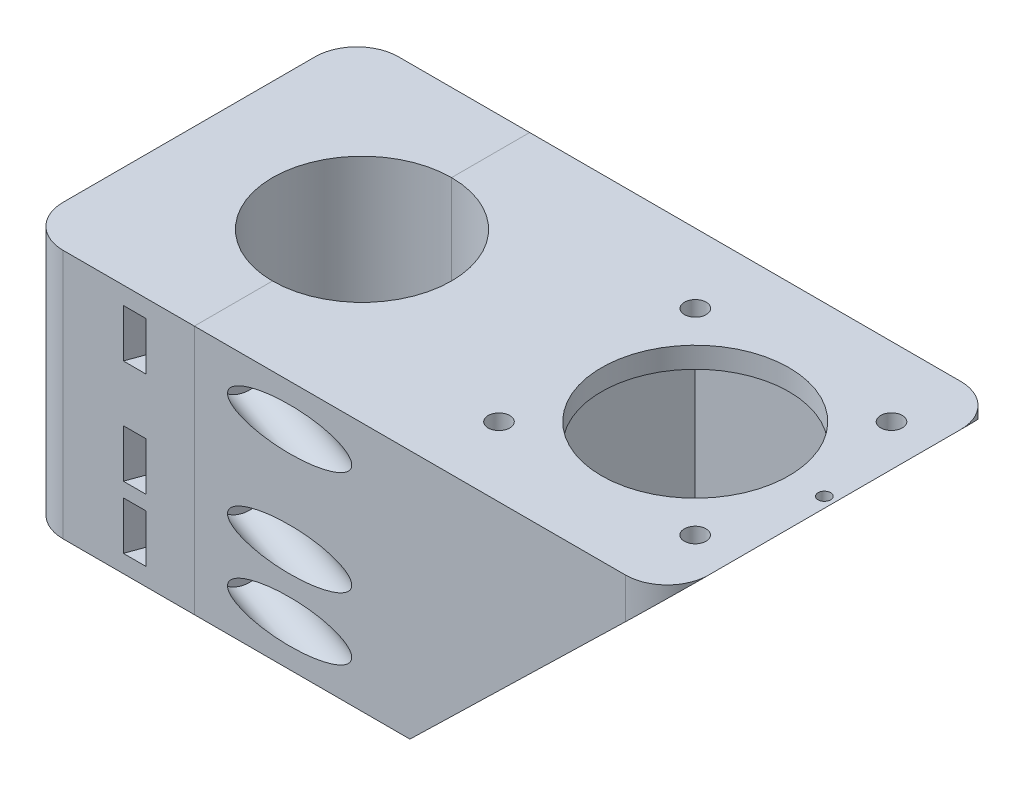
ISO-10303-21;
HEADER;
FILE_DESCRIPTION(('STEP AP214'),'2;1');
FILE_NAME('part.step','',(''),(''),'','','');
FILE_SCHEMA(('AUTOMOTIVE_DESIGN { 1 0 10303 214 1 1 1 1 }'));
ENDSEC;
DATA;
#1=APPLICATION_CONTEXT('core data for automotive mechanical design processes');
#2=APPLICATION_PROTOCOL_DEFINITION('international standard','automotive_design',2000,#1);
#3=PRODUCT_CONTEXT('',#1,'mechanical');
#4=PRODUCT('Part','Part','',(#3));
#5=PRODUCT_RELATED_PRODUCT_CATEGORY('part','',(#4));
#6=PRODUCT_DEFINITION_FORMATION('','',#4);
#7=PRODUCT_DEFINITION_CONTEXT('part definition',#1,'design');
#8=PRODUCT_DEFINITION('design','',#6,#7);
#9=PRODUCT_DEFINITION_SHAPE('','',#8);
#10=(LENGTH_UNIT() NAMED_UNIT(*) SI_UNIT(.MILLI.,.METRE.));
#11=(NAMED_UNIT(*) PLANE_ANGLE_UNIT() SI_UNIT($,.RADIAN.));
#12=(NAMED_UNIT(*) SI_UNIT($,.STERADIAN.) SOLID_ANGLE_UNIT());
#13=UNCERTAINTY_MEASURE_WITH_UNIT(LENGTH_MEASURE(1.E-05),#10,'distance_accuracy_value','');
#14=(GEOMETRIC_REPRESENTATION_CONTEXT(3) GLOBAL_UNCERTAINTY_ASSIGNED_CONTEXT((#13)) GLOBAL_UNIT_ASSIGNED_CONTEXT((#10,
#11,#12)) REPRESENTATION_CONTEXT('',''));
#15=CARTESIAN_POINT('',(0.,0.,0.));
#16=DIRECTION('',(0.,0.,1.));
#17=DIRECTION('',(1.,0.,0.));
#18=AXIS2_PLACEMENT_3D('',#15,#16,#17);
#19=CARTESIAN_POINT('',(-59.8421271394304,50.,-10.1445801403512));
#20=DIRECTION('',(0.939692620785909,0.,-0.342020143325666));
#21=DIRECTION('',(-0.342020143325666,0.,-0.939692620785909));
#22=AXIS2_PLACEMENT_3D('',#19,#20,#21);
#23=CYLINDRICAL_SURFACE('',#22,3.);
#24=CARTESIAN_POINT('',(0.,50.,-31.9253331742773));
#25=DIRECTION('',(-1.,0.,0.));
#26=DIRECTION('',(0.,0.,-1.));
#27=AXIS2_PLACEMENT_3D('',#24,#25,#26);
#28=ELLIPSE('',#27,3.19253331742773,3.);
#29=CARTESIAN_POINT('',(0.,50.,-35.1178664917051));
#30=VERTEX_POINT('',#29);
#31=EDGE_CURVE('E229',#30,#30,#28,.T.);
#32=ORIENTED_EDGE('',*,*,#31,.T.);
#33=EDGE_LOOP('',(#32));
#34=FACE_BOUND('',#33,.T.);
#35=CARTESIAN_POINT('',(4.53560004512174,50.,-33.5761565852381));
#36=DIRECTION('',(0.939692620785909,0.,-0.342020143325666));
#37=DIRECTION('',(-0.342020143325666,0.,-0.939692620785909));
#38=AXIS2_PLACEMENT_3D('',#35,#36,#37);
#39=CIRCLE('',#38,3.);
#40=CARTESIAN_POINT('',(3.50953961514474,50.,-36.3952344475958));
#41=VERTEX_POINT('',#40);
#42=EDGE_CURVE('E211',#41,#41,#39,.F.);
#43=ORIENTED_EDGE('',*,*,#42,.F.);
#44=EDGE_LOOP('',(#43));
#45=FACE_BOUND('',#44,.T.);
#46=ADVANCED_FACE('F59',(#34,#45),#23,.F.);
#47=CARTESIAN_POINT('',(-59.8421271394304,10.,-10.1445801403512));
#48=DIRECTION('',(0.939692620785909,0.,-0.342020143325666));
#49=DIRECTION('',(-0.342020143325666,0.,-0.939692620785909));
#50=AXIS2_PLACEMENT_3D('',#47,#48,#49);
#51=CYLINDRICAL_SURFACE('',#50,3.);
#52=CARTESIAN_POINT('',(0.,10.,-31.9253331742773));
#53=DIRECTION('',(-1.,0.,0.));
#54=DIRECTION('',(0.,0.,-1.));
#55=AXIS2_PLACEMENT_3D('',#52,#53,#54);
#56=ELLIPSE('',#55,3.19253331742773,3.);
#57=CARTESIAN_POINT('',(0.,10.,-35.1178664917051));
#58=VERTEX_POINT('',#57);
#59=EDGE_CURVE('E256',#58,#58,#56,.T.);
#60=ORIENTED_EDGE('',*,*,#59,.T.);
#61=EDGE_LOOP('',(#60));
#62=FACE_BOUND('',#61,.T.);
#63=CARTESIAN_POINT('',(4.53560004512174,10.,-33.5761565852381));
#64=DIRECTION('',(0.939692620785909,0.,-0.342020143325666));
#65=DIRECTION('',(-0.342020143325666,0.,-0.939692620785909));
#66=AXIS2_PLACEMENT_3D('',#63,#64,#65);
#67=CIRCLE('',#66,3.);
#68=CARTESIAN_POINT('',(3.50953961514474,10.,-36.3952344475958));
#69=VERTEX_POINT('',#68);
#70=EDGE_CURVE('E209',#69,#69,#67,.F.);
#71=ORIENTED_EDGE('',*,*,#70,.F.);
#72=EDGE_LOOP('',(#71));
#73=FACE_BOUND('',#72,.T.);
#74=ADVANCED_FACE('F437',(#62,#73),#51,.F.);
#75=CARTESIAN_POINT('',(-59.8421271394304,25.,-10.1445801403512));
#76=DIRECTION('',(0.939692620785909,0.,-0.342020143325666));
#77=DIRECTION('',(-0.342020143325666,0.,-0.939692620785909));
#78=AXIS2_PLACEMENT_3D('',#75,#76,#77);
#79=CYLINDRICAL_SURFACE('',#78,3.);
#80=CARTESIAN_POINT('',(0.,25.,-31.9253331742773));
#81=DIRECTION('',(-1.,0.,0.));
#82=DIRECTION('',(0.,0.,-1.));
#83=AXIS2_PLACEMENT_3D('',#80,#81,#82);
#84=ELLIPSE('',#83,3.19253331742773,3.);
#85=CARTESIAN_POINT('',(0.,25.,-35.1178664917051));
#86=VERTEX_POINT('',#85);
#87=EDGE_CURVE('E264',#86,#86,#84,.T.);
#88=ORIENTED_EDGE('',*,*,#87,.T.);
#89=EDGE_LOOP('',(#88));
#90=FACE_BOUND('',#89,.T.);
#91=CARTESIAN_POINT('',(4.53560004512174,25.,-33.5761565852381));
#92=DIRECTION('',(0.939692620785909,0.,-0.342020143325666));
#93=DIRECTION('',(-0.342020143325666,0.,-0.939692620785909));
#94=AXIS2_PLACEMENT_3D('',#91,#92,#93);
#95=CIRCLE('',#94,3.);
#96=CARTESIAN_POINT('',(3.50953961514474,25.,-36.3952344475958));
#97=VERTEX_POINT('',#96);
#98=EDGE_CURVE('E201',#97,#97,#95,.F.);
#99=ORIENTED_EDGE('',*,*,#98,.F.);
#100=EDGE_LOOP('',(#99));
#101=FACE_BOUND('',#100,.T.);
#102=ADVANCED_FACE('F447',(#90,#101),#79,.F.);
#103=CARTESIAN_POINT('',(0.,0.,0.));
#104=DIRECTION('',(-1.,0.,0.));
#105=DIRECTION('',(0.,0.,1.));
#106=AXIS2_PLACEMENT_3D('',#103,#104,#105);
#107=PLANE('',#106);
#108=CARTESIAN_POINT('',(0.,10.,31.9253331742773));
#109=DIRECTION('',(1.,0.,0.));
#110=DIRECTION('',(0.,0.,1.));
#111=AXIS2_PLACEMENT_3D('',#108,#109,#110);
#112=ELLIPSE('',#111,3.19253331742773,3.);
#113=CARTESIAN_POINT('',(0.,10.,35.1178664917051));
#114=VERTEX_POINT('',#113);
#115=EDGE_CURVE('E878',#114,#114,#112,.T.);
#116=ORIENTED_EDGE('',*,*,#115,.T.);
#117=EDGE_LOOP('',(#116));
#118=FACE_BOUND('',#117,.T.);
#119=CARTESIAN_POINT('',(0.,25.,31.9253331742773));
#120=DIRECTION('',(1.,0.,0.));
#121=DIRECTION('',(0.,0.,1.));
#122=AXIS2_PLACEMENT_3D('',#119,#120,#121);
#123=ELLIPSE('',#122,3.19253331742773,3.);
#124=CARTESIAN_POINT('',(0.,25.,35.1178664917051));
#125=VERTEX_POINT('',#124);
#126=EDGE_CURVE('E879',#125,#125,#123,.T.);
#127=ORIENTED_EDGE('',*,*,#126,.T.);
#128=EDGE_LOOP('',(#127));
#129=FACE_BOUND('',#128,.T.);
#130=CARTESIAN_POINT('',(0.,50.,31.9253331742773));
#131=DIRECTION('',(1.,0.,0.));
#132=DIRECTION('',(0.,0.,1.));
#133=AXIS2_PLACEMENT_3D('',#130,#131,#132);
#134=ELLIPSE('',#133,3.19253331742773,3.);
#135=CARTESIAN_POINT('',(0.,50.,35.1178664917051));
#136=VERTEX_POINT('',#135);
#137=EDGE_CURVE('E881',#136,#136,#134,.T.);
#138=ORIENTED_EDGE('',*,*,#137,.T.);
#139=EDGE_LOOP('',(#138));
#140=FACE_BOUND('',#139,.T.);
#141=DIRECTION('',(0.,-1.,0.));
#142=VECTOR('',#141,1.);
#143=CARTESIAN_POINT('',(0.,60.,21.5));
#144=LINE('',#143,#142);
#145=CARTESIAN_POINT('',(0.,60.,21.5));
#146=VERTEX_POINT('',#145);
#147=CARTESIAN_POINT('',(0.,0.,21.5));
#148=VERTEX_POINT('',#147);
#149=EDGE_CURVE('E177',#146,#148,#144,.T.);
#150=ORIENTED_EDGE('',*,*,#149,.T.);
#151=DIRECTION('',(0.,0.,1.));
#152=VECTOR('',#151,1.);
#153=CARTESIAN_POINT('',(0.,0.,30.25));
#154=LINE('',#153,#152);
#155=CARTESIAN_POINT('',(0.,0.,40.25));
#156=VERTEX_POINT('',#155);
#157=EDGE_CURVE('E166',#148,#156,#154,.T.);
#158=ORIENTED_EDGE('',*,*,#157,.T.);
#159=DIRECTION('',(0.,1.,0.));
#160=VECTOR('',#159,1.);
#161=CARTESIAN_POINT('',(0.,60.,40.25));
#162=LINE('',#161,#160);
#163=CARTESIAN_POINT('',(0.,60.,40.25));
#164=VERTEX_POINT('',#163);
#165=EDGE_CURVE('E173',#156,#164,#162,.T.);
#166=ORIENTED_EDGE('',*,*,#165,.T.);
#167=DIRECTION('',(0.,0.,1.));
#168=VECTOR('',#167,1.);
#169=CARTESIAN_POINT('',(0.,60.,30.25));
#170=LINE('',#169,#168);
#171=EDGE_CURVE('E274',#146,#164,#170,.T.);
#172=ORIENTED_EDGE('',*,*,#171,.F.);
#173=EDGE_LOOP('',(#150,#158,#166,#172));
#174=FACE_BOUND('',#173,.T.);
#175=ADVANCED_FACE('F383',(#118,#129,#140,#174),#107,.T.);
#176=ORIENTED_EDGE('',*,*,#87,.F.);
#177=EDGE_LOOP('',(#176));
#178=FACE_BOUND('',#177,.T.);
#179=ORIENTED_EDGE('',*,*,#59,.F.);
#180=EDGE_LOOP('',(#179));
#181=FACE_BOUND('',#180,.T.);
#182=ORIENTED_EDGE('',*,*,#31,.F.);
#183=EDGE_LOOP('',(#182));
#184=FACE_BOUND('',#183,.T.);
#185=DIRECTION('',(0.,-1.,0.));
#186=VECTOR('',#185,1.);
#187=CARTESIAN_POINT('',(0.,60.,-40.25));
#188=LINE('',#187,#186);
#189=CARTESIAN_POINT('',(0.,60.,-40.25));
#190=VERTEX_POINT('',#189);
#191=CARTESIAN_POINT('',(0.,0.,-40.25));
#192=VERTEX_POINT('',#191);
#193=EDGE_CURVE('E152',#190,#192,#188,.T.);
#194=ORIENTED_EDGE('',*,*,#193,.T.);
#195=CARTESIAN_POINT('',(0.,0.,-21.5));
#196=VERTEX_POINT('',#195);
#197=EDGE_CURVE('E160',#192,#196,#154,.T.);
#198=ORIENTED_EDGE('',*,*,#197,.T.);
#199=DIRECTION('',(0.,-1.,0.));
#200=VECTOR('',#199,1.);
#201=CARTESIAN_POINT('',(0.,60.,-21.5));
#202=LINE('',#201,#200);
#203=CARTESIAN_POINT('',(0.,60.,-21.5));
#204=VERTEX_POINT('',#203);
#205=EDGE_CURVE('E378',#196,#204,#202,.F.);
#206=ORIENTED_EDGE('',*,*,#205,.T.);
#207=EDGE_CURVE('E170',#190,#204,#170,.T.);
#208=ORIENTED_EDGE('',*,*,#207,.F.);
#209=EDGE_LOOP('',(#194,#198,#206,#208));
#210=FACE_BOUND('',#209,.T.);
#211=ADVANCED_FACE('F171',(#178,#181,#184,#210),#107,.T.);
#212=CARTESIAN_POINT('',(103.5,0.,30.25));
#213=DIRECTION('',(0.,1.,0.));
#214=DIRECTION('',(0.,0.,1.));
#215=AXIS2_PLACEMENT_3D('',#212,#213,#214);
#216=PLANE('',#215);
#217=CARTESIAN_POINT('',(28.375,0.,37.75));
#218=DIRECTION('',(0.,-1.,0.));
#219=DIRECTION('',(0.,0.,-1.));
#220=AXIS2_PLACEMENT_3D('',#217,#218,#219);
#221=CIRCLE('',#220,1.5);
#222=CARTESIAN_POINT('',(28.375,0.,36.25));
#223=VERTEX_POINT('',#222);
#224=EDGE_CURVE('E939',#223,#223,#221,.T.);
#225=ORIENTED_EDGE('',*,*,#224,.F.);
#226=EDGE_LOOP('',(#225));
#227=FACE_BOUND('',#226,.T.);
#228=CARTESIAN_POINT('',(28.375,0.,-37.75));
#229=DIRECTION('',(0.,-1.,0.));
#230=DIRECTION('',(0.,0.,-1.));
#231=AXIS2_PLACEMENT_3D('',#228,#229,#230);
#232=CIRCLE('',#231,1.5);
#233=CARTESIAN_POINT('',(28.375,0.,-39.25));
#234=VERTEX_POINT('',#233);
#235=EDGE_CURVE('E934',#234,#234,#232,.T.);
#236=ORIENTED_EDGE('',*,*,#235,.F.);
#237=EDGE_LOOP('',(#236));
#238=FACE_BOUND('',#237,.T.);
#239=ORIENTED_EDGE('',*,*,#197,.F.);
#240=DIRECTION('',(1.,0.,0.));
#241=VECTOR('',#240,1.);
#242=CARTESIAN_POINT('',(-31.5,0.,-40.25));
#243=LINE('',#242,#241);
#244=CARTESIAN_POINT('',(51.75,0.,-40.25));
#245=VERTEX_POINT('',#244);
#246=EDGE_CURVE('E77',#192,#245,#243,.T.);
#247=ORIENTED_EDGE('',*,*,#246,.T.);
#248=DIRECTION('',(0.,0.,1.));
#249=VECTOR('',#248,1.);
#250=CARTESIAN_POINT('',(51.75,0.,-40.25));
#251=LINE('',#250,#249);
#252=CARTESIAN_POINT('',(51.75,0.,-28.25));
#253=VERTEX_POINT('',#252);
#254=EDGE_CURVE('E69',#245,#253,#251,.T.);
#255=ORIENTED_EDGE('',*,*,#254,.T.);
#256=DIRECTION('',(0.,0.,-1.));
#257=VECTOR('',#256,1.);
#258=CARTESIAN_POINT('',(51.75,0.,0.));
#259=LINE('',#258,#257);
#260=CARTESIAN_POINT('',(51.75,0.,28.25));
#261=VERTEX_POINT('',#260);
#262=EDGE_CURVE('E286',#261,#253,#259,.T.);
#263=ORIENTED_EDGE('',*,*,#262,.F.);
#264=DIRECTION('',(0.,0.,-1.));
#265=VECTOR('',#264,1.);
#266=CARTESIAN_POINT('',(51.75,0.,40.25));
#267=LINE('',#266,#265);
#268=CARTESIAN_POINT('',(51.75,0.,40.25));
#269=VERTEX_POINT('',#268);
#270=EDGE_CURVE('E330',#269,#261,#267,.T.);
#271=ORIENTED_EDGE('',*,*,#270,.F.);
#272=DIRECTION('',(1.,0.,0.));
#273=VECTOR('',#272,1.);
#274=CARTESIAN_POINT('',(-31.5,0.,40.25));
#275=LINE('',#274,#273);
#276=EDGE_CURVE('E191',#156,#269,#275,.T.);
#277=ORIENTED_EDGE('',*,*,#276,.F.);
#278=ORIENTED_EDGE('',*,*,#157,.F.);
#279=CARTESIAN_POINT('',(0.,0.,0.));
#280=DIRECTION('',(0.,-1.,0.));
#281=DIRECTION('',(0.,0.,1.));
#282=AXIS2_PLACEMENT_3D('',#279,#280,#281);
#283=CIRCLE('',#282,21.5);
#284=EDGE_CURVE('E162',#196,#148,#283,.T.);
#285=ORIENTED_EDGE('',*,*,#284,.F.);
#286=EDGE_LOOP('',(#239,#247,#255,#263,#271,#277,#278,#285));
#287=FACE_BOUND('',#286,.T.);
#288=ADVANCED_FACE('F156',(#227,#238,#287),#216,.F.);
#289=CARTESIAN_POINT('',(0.,60.,0.));
#290=DIRECTION('',(0.,-1.,0.));
#291=DIRECTION('',(0.,0.,-1.));
#292=AXIS2_PLACEMENT_3D('',#289,#290,#291);
#293=CYLINDRICAL_SURFACE('',#292,21.5);
#294=ORIENTED_EDGE('',*,*,#205,.F.);
#295=ORIENTED_EDGE('',*,*,#284,.T.);
#296=ORIENTED_EDGE('',*,*,#149,.F.);
#297=CARTESIAN_POINT('',(0.,60.,0.));
#298=DIRECTION('',(0.,-1.,0.));
#299=DIRECTION('',(0.,0.,1.));
#300=AXIS2_PLACEMENT_3D('',#297,#298,#299);
#301=CIRCLE('',#300,21.5);
#302=EDGE_CURVE('E186',#204,#146,#301,.T.);
#303=ORIENTED_EDGE('',*,*,#302,.F.);
#304=EDGE_LOOP('',(#294,#295,#296,#303));
#305=FACE_BOUND('',#304,.T.);
#306=ADVANCED_FACE('F386',(#305),#293,.F.);
#307=CARTESIAN_POINT('',(-31.5,60.,40.25));
#308=DIRECTION('',(0.,0.,-1.));
#309=DIRECTION('',(-1.,0.,0.));
#310=AXIS2_PLACEMENT_3D('',#307,#308,#309);
#311=PLANE('',#310);
#312=CARTESIAN_POINT('',(22.8718341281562,10.,40.25));
#313=DIRECTION('',(0.,0.,-1.));
#314=DIRECTION('',(-1.,0.,0.));
#315=AXIS2_PLACEMENT_3D('',#312,#313,#314);
#316=ELLIPSE('',#315,14.9114024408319,5.1);
#317=CARTESIAN_POINT('',(7.96043168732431,10.,40.25));
#318=VERTEX_POINT('',#317);
#319=EDGE_CURVE('E237',#318,#318,#316,.T.);
#320=ORIENTED_EDGE('',*,*,#319,.T.);
#321=EDGE_LOOP('',(#320));
#322=FACE_BOUND('',#321,.T.);
#323=CARTESIAN_POINT('',(22.8718341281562,25.,40.25));
#324=DIRECTION('',(0.,0.,-1.));
#325=DIRECTION('',(-1.,0.,0.));
#326=AXIS2_PLACEMENT_3D('',#323,#324,#325);
#327=ELLIPSE('',#326,14.9114024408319,5.1);
#328=CARTESIAN_POINT('',(7.96043168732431,25.,40.25));
#329=VERTEX_POINT('',#328);
#330=EDGE_CURVE('E232',#329,#329,#327,.T.);
#331=ORIENTED_EDGE('',*,*,#330,.T.);
#332=EDGE_LOOP('',(#331));
#333=FACE_BOUND('',#332,.T.);
#334=CARTESIAN_POINT('',(22.8718341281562,50.,40.25));
#335=DIRECTION('',(0.,0.,-1.));
#336=DIRECTION('',(-1.,0.,0.));
#337=AXIS2_PLACEMENT_3D('',#334,#335,#336);
#338=ELLIPSE('',#337,14.9114024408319,5.1);
#339=CARTESIAN_POINT('',(7.96043168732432,50.,40.25));
#340=VERTEX_POINT('',#339);
#341=EDGE_CURVE('E233',#340,#340,#338,.T.);
#342=ORIENTED_EDGE('',*,*,#341,.T.);
#343=EDGE_LOOP('',(#342));
#344=FACE_BOUND('',#343,.T.);
#345=ORIENTED_EDGE('',*,*,#165,.F.);
#346=ORIENTED_EDGE('',*,*,#276,.T.);
#347=DIRECTION('',(0.717196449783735,0.696871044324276,0.));
#348=VECTOR('',#347,1.);
#349=CARTESIAN_POINT('',(113.5,60.,40.25));
#350=LINE('',#349,#348);
#351=CARTESIAN_POINT('',(103.5,50.2834008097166,40.25));
#352=VERTEX_POINT('',#351);
#353=EDGE_CURVE('E328',#269,#352,#350,.T.);
#354=ORIENTED_EDGE('',*,*,#353,.T.);
#355=DIRECTION('',(0.,-1.,0.));
#356=VECTOR('',#355,1.);
#357=CARTESIAN_POINT('',(103.5,60.,40.25));
#358=LINE('',#357,#356);
#359=CARTESIAN_POINT('',(103.5,60.,40.25));
#360=VERTEX_POINT('',#359);
#361=EDGE_CURVE('E188',#360,#352,#358,.T.);
#362=ORIENTED_EDGE('',*,*,#361,.F.);
#363=DIRECTION('',(1.,0.,0.));
#364=VECTOR('',#363,1.);
#365=CARTESIAN_POINT('',(-31.5,60.,40.25));
#366=LINE('',#365,#364);
#367=EDGE_CURVE('E187',#164,#360,#366,.T.);
#368=ORIENTED_EDGE('',*,*,#367,.F.);
#369=EDGE_LOOP('',(#345,#346,#354,#362,#368));
#370=FACE_BOUND('',#369,.T.);
#371=ADVANCED_FACE('F725',(#322,#333,#344,#370),#311,.F.);
#372=CARTESIAN_POINT('',(103.5,60.,30.25));
#373=DIRECTION('',(0.,1.,0.));
#374=DIRECTION('',(0.,0.,1.));
#375=AXIS2_PLACEMENT_3D('',#372,#373,#374);
#376=PLANE('',#375);
#377=CARTESIAN_POINT('',(111.,60.,0.));
#378=DIRECTION('',(0.,1.,0.));
#379=DIRECTION('',(0.,0.,1.));
#380=AXIS2_PLACEMENT_3D('',#377,#378,#379);
#381=CIRCLE('',#380,1.5);
#382=CARTESIAN_POINT('',(111.,60.,1.5));
#383=VERTEX_POINT('',#382);
#384=EDGE_CURVE('E924',#383,#383,#381,.T.);
#385=ORIENTED_EDGE('',*,*,#384,.F.);
#386=EDGE_LOOP('',(#385));
#387=FACE_BOUND('',#386,.T.);
#388=CARTESIAN_POINT('',(80.,60.,0.));
#389=DIRECTION('',(0.,1.,0.));
#390=DIRECTION('',(0.,0.,1.));
#391=AXIS2_PLACEMENT_3D('',#388,#389,#390);
#392=CIRCLE('',#391,22.5);
#393=CARTESIAN_POINT('',(80.,60.,22.5));
#394=VERTEX_POINT('',#393);
#395=EDGE_CURVE('E185',#394,#394,#392,.T.);
#396=ORIENTED_EDGE('',*,*,#395,.F.);
#397=EDGE_LOOP('',(#396));
#398=FACE_BOUND('',#397,.T.);
#399=CARTESIAN_POINT('',(56.45,60.,23.57));
#400=DIRECTION('',(0.,-1.,0.));
#401=DIRECTION('',(0.,0.,-1.));
#402=AXIS2_PLACEMENT_3D('',#399,#400,#401);
#403=CIRCLE('',#402,2.6);
#404=CARTESIAN_POINT('',(56.45,60.,20.97));
#405=VERTEX_POINT('',#404);
#406=EDGE_CURVE('E291',#405,#405,#403,.T.);
#407=ORIENTED_EDGE('',*,*,#406,.T.);
#408=EDGE_LOOP('',(#407));
#409=FACE_BOUND('',#408,.T.);
#410=CARTESIAN_POINT('',(103.55,60.,23.57));
#411=DIRECTION('',(0.,-1.,0.));
#412=DIRECTION('',(0.,0.,-1.));
#413=AXIS2_PLACEMENT_3D('',#410,#411,#412);
#414=CIRCLE('',#413,2.6);
#415=CARTESIAN_POINT('',(103.55,60.,20.97));
#416=VERTEX_POINT('',#415);
#417=EDGE_CURVE('E302',#416,#416,#414,.T.);
#418=ORIENTED_EDGE('',*,*,#417,.T.);
#419=EDGE_LOOP('',(#418));
#420=FACE_BOUND('',#419,.T.);
#421=CARTESIAN_POINT('',(56.45,60.,-23.57));
#422=DIRECTION('',(0.,1.,0.));
#423=DIRECTION('',(0.,0.,1.));
#424=AXIS2_PLACEMENT_3D('',#421,#422,#423);
#425=CIRCLE('',#424,2.6);
#426=CARTESIAN_POINT('',(56.45,60.,-20.97));
#427=VERTEX_POINT('',#426);
#428=EDGE_CURVE('E348',#427,#427,#425,.T.);
#429=ORIENTED_EDGE('',*,*,#428,.F.);
#430=EDGE_LOOP('',(#429));
#431=FACE_BOUND('',#430,.T.);
#432=CARTESIAN_POINT('',(103.55,60.,-23.57));
#433=DIRECTION('',(0.,1.,0.));
#434=DIRECTION('',(0.,0.,1.));
#435=AXIS2_PLACEMENT_3D('',#432,#433,#434);
#436=CIRCLE('',#435,2.6);
#437=CARTESIAN_POINT('',(103.55,60.,-20.97));
#438=VERTEX_POINT('',#437);
#439=EDGE_CURVE('E353',#438,#438,#436,.T.);
#440=ORIENTED_EDGE('',*,*,#439,.F.);
#441=EDGE_LOOP('',(#440));
#442=FACE_BOUND('',#441,.T.);
#443=DIRECTION('',(1.,0.,0.));
#444=VECTOR('',#443,1.);
#445=CARTESIAN_POINT('',(-31.5,60.,-40.25));
#446=LINE('',#445,#444);
#447=CARTESIAN_POINT('',(103.5,60.,-40.25));
#448=VERTEX_POINT('',#447);
#449=EDGE_CURVE('E203',#190,#448,#446,.T.);
#450=ORIENTED_EDGE('',*,*,#449,.F.);
#451=ORIENTED_EDGE('',*,*,#207,.T.);
#452=ORIENTED_EDGE('',*,*,#302,.T.);
#453=ORIENTED_EDGE('',*,*,#171,.T.);
#454=ORIENTED_EDGE('',*,*,#367,.T.);
#455=CARTESIAN_POINT('',(103.5,60.,30.25));
#456=DIRECTION('',(0.,1.,0.));
#457=DIRECTION('',(0.,0.,1.));
#458=AXIS2_PLACEMENT_3D('',#455,#456,#457);
#459=CIRCLE('',#458,10.);
#460=CARTESIAN_POINT('',(113.5,60.,30.2499999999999));
#461=VERTEX_POINT('',#460);
#462=EDGE_CURVE('E200',#360,#461,#459,.T.);
#463=ORIENTED_EDGE('',*,*,#462,.T.);
#464=DIRECTION('',(0.,0.,-1.));
#465=VECTOR('',#464,1.);
#466=CARTESIAN_POINT('',(113.5,60.,0.));
#467=LINE('',#466,#465);
#468=CARTESIAN_POINT('',(113.5,60.,-30.2499999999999));
#469=VERTEX_POINT('',#468);
#470=EDGE_CURVE('E81',#461,#469,#467,.T.);
#471=ORIENTED_EDGE('',*,*,#470,.T.);
#472=CARTESIAN_POINT('',(103.5,60.,-30.25));
#473=DIRECTION('',(0.,-1.,0.));
#474=DIRECTION('',(0.,0.,-1.));
#475=AXIS2_PLACEMENT_3D('',#472,#473,#474);
#476=CIRCLE('',#475,10.);
#477=EDGE_CURVE('E158',#448,#469,#476,.T.);
#478=ORIENTED_EDGE('',*,*,#477,.F.);
#479=EDGE_LOOP('',(#450,#451,#452,#453,#454,#463,#471,#478));
#480=FACE_BOUND('',#479,.T.);
#481=ADVANCED_FACE('F388',(#387,#398,#409,#420,#431,#442,#480),#376,.T.);
#482=CARTESIAN_POINT('',(-31.5,60.,-40.25));
#483=DIRECTION('',(0.,0.,1.));
#484=DIRECTION('',(-1.,0.,0.));
#485=AXIS2_PLACEMENT_3D('',#482,#483,#484);
#486=PLANE('',#485);
#487=CARTESIAN_POINT('',(22.8718341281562,10.,-40.25));
#488=DIRECTION('',(0.,0.,1.));
#489=DIRECTION('',(-1.,0.,0.));
#490=AXIS2_PLACEMENT_3D('',#487,#488,#489);
#491=ELLIPSE('',#490,14.9114024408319,5.1);
#492=CARTESIAN_POINT('',(7.96043168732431,10.,-40.25));
#493=VERTEX_POINT('',#492);
#494=EDGE_CURVE('E228',#493,#493,#491,.F.);
#495=ORIENTED_EDGE('',*,*,#494,.F.);
#496=EDGE_LOOP('',(#495));
#497=FACE_BOUND('',#496,.T.);
#498=CARTESIAN_POINT('',(22.8718341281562,25.,-40.25));
#499=DIRECTION('',(0.,0.,1.));
#500=DIRECTION('',(-1.,0.,0.));
#501=AXIS2_PLACEMENT_3D('',#498,#499,#500);
#502=ELLIPSE('',#501,14.9114024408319,5.1);
#503=CARTESIAN_POINT('',(7.96043168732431,25.,-40.25));
#504=VERTEX_POINT('',#503);
#505=EDGE_CURVE('E224',#504,#504,#502,.F.);
#506=ORIENTED_EDGE('',*,*,#505,.F.);
#507=EDGE_LOOP('',(#506));
#508=FACE_BOUND('',#507,.T.);
#509=CARTESIAN_POINT('',(22.8718341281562,50.,-40.25));
#510=DIRECTION('',(0.,0.,1.));
#511=DIRECTION('',(-1.,0.,0.));
#512=AXIS2_PLACEMENT_3D('',#509,#510,#511);
#513=ELLIPSE('',#512,14.9114024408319,5.1);
#514=CARTESIAN_POINT('',(7.96043168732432,50.,-40.25));
#515=VERTEX_POINT('',#514);
#516=EDGE_CURVE('E219',#515,#515,#513,.F.);
#517=ORIENTED_EDGE('',*,*,#516,.F.);
#518=EDGE_LOOP('',(#517));
#519=FACE_BOUND('',#518,.T.);
#520=ORIENTED_EDGE('',*,*,#193,.F.);
#521=ORIENTED_EDGE('',*,*,#449,.T.);
#522=DIRECTION('',(0.,-1.,0.));
#523=VECTOR('',#522,1.);
#524=CARTESIAN_POINT('',(103.5,60.,-40.25));
#525=LINE('',#524,#523);
#526=CARTESIAN_POINT('',(103.5,50.2834008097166,-40.25));
#527=VERTEX_POINT('',#526);
#528=EDGE_CURVE('E202',#448,#527,#525,.T.);
#529=ORIENTED_EDGE('',*,*,#528,.T.);
#530=DIRECTION('',(0.717196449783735,0.696871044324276,0.));
#531=VECTOR('',#530,1.);
#532=CARTESIAN_POINT('',(113.5,60.,-40.25));
#533=LINE('',#532,#531);
#534=EDGE_CURVE('E13',#245,#527,#533,.T.);
#535=ORIENTED_EDGE('',*,*,#534,.F.);
#536=ORIENTED_EDGE('',*,*,#246,.F.);
#537=EDGE_LOOP('',(#520,#521,#529,#535,#536));
#538=FACE_BOUND('',#537,.T.);
#539=ADVANCED_FACE('F58',(#497,#508,#519,#538),#486,.F.);
#540=CARTESIAN_POINT('',(103.5,60.,30.25));
#541=DIRECTION('',(0.,-1.,0.));
#542=DIRECTION('',(0.,0.,-1.));
#543=AXIS2_PLACEMENT_3D('',#540,#541,#542);
#544=CYLINDRICAL_SURFACE('',#543,10.);
#545=ORIENTED_EDGE('',*,*,#361,.T.);
#546=CARTESIAN_POINT('',(103.5,50.2834008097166,30.25));
#547=DIRECTION('',(-0.696871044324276,0.717196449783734,0.));
#548=DIRECTION('',(-0.717196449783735,-0.696871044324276,0.));
#549=AXIS2_PLACEMENT_3D('',#546,#547,#548);
#550=ELLIPSE('',#549,13.9431811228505,10.);
#551=EDGE_CURVE('E308',#352,#461,#550,.T.);
#552=ORIENTED_EDGE('',*,*,#551,.T.);
#553=ORIENTED_EDGE('',*,*,#462,.F.);
#554=EDGE_LOOP('',(#545,#552,#553));
#555=FACE_BOUND('',#554,.T.);
#556=ADVANCED_FACE('F457',(#555),#544,.T.);
#557=CARTESIAN_POINT('',(51.75,55.,0.));
#558=DIRECTION('',(-1.,0.,0.));
#559=DIRECTION('',(0.,0.,1.));
#560=AXIS2_PLACEMENT_3D('',#557,#558,#559);
#561=PLANE('',#560);
#562=ORIENTED_EDGE('',*,*,#262,.T.);
#563=DIRECTION('',(0.,-1.,0.));
#564=VECTOR('',#563,1.);
#565=CARTESIAN_POINT('',(51.75,55.,-28.25));
#566=LINE('',#565,#564);
#567=CARTESIAN_POINT('',(51.75,55.,-28.25));
#568=VERTEX_POINT('',#567);
#569=EDGE_CURVE('E153',#568,#253,#566,.T.);
#570=ORIENTED_EDGE('',*,*,#569,.F.);
#571=DIRECTION('',(0.,0.,-1.));
#572=VECTOR('',#571,1.);
#573=CARTESIAN_POINT('',(51.75,55.,0.));
#574=LINE('',#573,#572);
#575=CARTESIAN_POINT('',(51.75,55.,28.25));
#576=VERTEX_POINT('',#575);
#577=EDGE_CURVE('E295',#576,#568,#574,.T.);
#578=ORIENTED_EDGE('',*,*,#577,.F.);
#579=DIRECTION('',(0.,-1.,0.));
#580=VECTOR('',#579,1.);
#581=CARTESIAN_POINT('',(51.75,55.,28.25));
#582=LINE('',#581,#580);
#583=EDGE_CURVE('E198',#576,#261,#582,.T.);
#584=ORIENTED_EDGE('',*,*,#583,.T.);
#585=EDGE_LOOP('',(#562,#570,#578,#584));
#586=FACE_BOUND('',#585,.T.);
#587=ADVANCED_FACE('F401',(#586),#561,.F.);
#588=CARTESIAN_POINT('',(51.75,55.,28.25));
#589=DIRECTION('',(0.,0.,1.));
#590=DIRECTION('',(1.,0.,0.));
#591=AXIS2_PLACEMENT_3D('',#588,#589,#590);
#592=PLANE('',#591);
#593=DIRECTION('',(0.,-1.,0.));
#594=VECTOR('',#593,1.);
#595=CARTESIAN_POINT('',(108.25,55.,28.25));
#596=LINE('',#595,#594);
#597=CARTESIAN_POINT('',(108.25,55.,28.25));
#598=VERTEX_POINT('',#597);
#599=CARTESIAN_POINT('',(108.25,54.8987854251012,28.25));
#600=VERTEX_POINT('',#599);
#601=EDGE_CURVE('E285',#598,#600,#596,.T.);
#602=ORIENTED_EDGE('',*,*,#601,.T.);
#603=DIRECTION('',(-0.717196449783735,-0.696871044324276,0.));
#604=VECTOR('',#603,1.);
#605=CARTESIAN_POINT('',(79.238639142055,26.7096088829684,28.25));
#606=LINE('',#605,#604);
#607=EDGE_CURVE('E325',#600,#261,#606,.T.);
#608=ORIENTED_EDGE('',*,*,#607,.T.);
#609=ORIENTED_EDGE('',*,*,#583,.F.);
#610=DIRECTION('',(-1.,0.,0.));
#611=VECTOR('',#610,1.);
#612=CARTESIAN_POINT('',(51.75,55.,28.25));
#613=LINE('',#612,#611);
#614=EDGE_CURVE('E288',#598,#576,#613,.T.);
#615=ORIENTED_EDGE('',*,*,#614,.F.);
#616=EDGE_LOOP('',(#602,#608,#609,#615));
#617=FACE_BOUND('',#616,.T.);
#618=ADVANCED_FACE('F409',(#617),#592,.F.);
#619=CARTESIAN_POINT('',(108.25,55.,0.));
#620=DIRECTION('',(1.,0.,0.));
#621=DIRECTION('',(0.,0.,-1.));
#622=AXIS2_PLACEMENT_3D('',#619,#620,#621);
#623=PLANE('',#622);
#624=DIRECTION('',(0.,0.,1.));
#625=VECTOR('',#624,1.);
#626=CARTESIAN_POINT('',(108.25,55.,0.));
#627=LINE('',#626,#625);
#628=CARTESIAN_POINT('',(108.25,55.,-28.25));
#629=VERTEX_POINT('',#628);
#630=EDGE_CURVE('E296',#629,#598,#627,.T.);
#631=ORIENTED_EDGE('',*,*,#630,.F.);
#632=DIRECTION('',(0.,-1.,0.));
#633=VECTOR('',#632,1.);
#634=CARTESIAN_POINT('',(108.25,55.,-28.25));
#635=LINE('',#634,#633);
#636=CARTESIAN_POINT('',(108.25,54.8987854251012,-28.25));
#637=VERTEX_POINT('',#636);
#638=EDGE_CURVE('E339',#629,#637,#635,.T.);
#639=ORIENTED_EDGE('',*,*,#638,.T.);
#640=DIRECTION('',(0.,0.,1.));
#641=VECTOR('',#640,1.);
#642=CARTESIAN_POINT('',(108.25,54.8987854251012,0.));
#643=LINE('',#642,#641);
#644=EDGE_CURVE('E266',#637,#600,#643,.T.);
#645=ORIENTED_EDGE('',*,*,#644,.T.);
#646=ORIENTED_EDGE('',*,*,#601,.F.);
#647=EDGE_LOOP('',(#631,#639,#645,#646));
#648=FACE_BOUND('',#647,.T.);
#649=ADVANCED_FACE('F406',(#648),#623,.F.);
#650=CARTESIAN_POINT('',(0.,55.,0.));
#651=DIRECTION('',(0.,1.,0.));
#652=DIRECTION('',(0.,0.,1.));
#653=AXIS2_PLACEMENT_3D('',#650,#651,#652);
#654=PLANE('',#653);
#655=CARTESIAN_POINT('',(80.,55.,0.));
#656=DIRECTION('',(0.,1.,0.));
#657=DIRECTION('',(0.,0.,1.));
#658=AXIS2_PLACEMENT_3D('',#655,#656,#657);
#659=CIRCLE('',#658,22.5);
#660=CARTESIAN_POINT('',(80.,55.,22.5));
#661=VERTEX_POINT('',#660);
#662=EDGE_CURVE('E172',#661,#661,#659,.F.);
#663=ORIENTED_EDGE('',*,*,#662,.F.);
#664=EDGE_LOOP('',(#663));
#665=FACE_BOUND('',#664,.T.);
#666=CARTESIAN_POINT('',(56.45,55.,23.57));
#667=DIRECTION('',(0.,-1.,0.));
#668=DIRECTION('',(0.,0.,-1.));
#669=AXIS2_PLACEMENT_3D('',#666,#667,#668);
#670=CIRCLE('',#669,2.6);
#671=CARTESIAN_POINT('',(56.45,55.,20.97));
#672=VERTEX_POINT('',#671);
#673=EDGE_CURVE('E312',#672,#672,#670,.T.);
#674=ORIENTED_EDGE('',*,*,#673,.F.);
#675=EDGE_LOOP('',(#674));
#676=FACE_BOUND('',#675,.T.);
#677=CARTESIAN_POINT('',(103.55,55.,23.57));
#678=DIRECTION('',(0.,-1.,0.));
#679=DIRECTION('',(0.,0.,-1.));
#680=AXIS2_PLACEMENT_3D('',#677,#678,#679);
#681=CIRCLE('',#680,2.6);
#682=CARTESIAN_POINT('',(103.55,55.,20.97));
#683=VERTEX_POINT('',#682);
#684=EDGE_CURVE('E307',#683,#683,#681,.T.);
#685=ORIENTED_EDGE('',*,*,#684,.F.);
#686=EDGE_LOOP('',(#685));
#687=FACE_BOUND('',#686,.T.);
#688=ORIENTED_EDGE('',*,*,#577,.T.);
#689=DIRECTION('',(-1.,0.,0.));
#690=VECTOR('',#689,1.);
#691=CARTESIAN_POINT('',(51.75,55.,-28.25));
#692=LINE('',#691,#690);
#693=EDGE_CURVE('E345',#629,#568,#692,.T.);
#694=ORIENTED_EDGE('',*,*,#693,.F.);
#695=ORIENTED_EDGE('',*,*,#630,.T.);
#696=ORIENTED_EDGE('',*,*,#614,.T.);
#697=EDGE_LOOP('',(#688,#694,#695,#696));
#698=FACE_BOUND('',#697,.T.);
#699=CARTESIAN_POINT('',(56.45,55.,-23.57));
#700=DIRECTION('',(0.,1.,0.));
#701=DIRECTION('',(0.,0.,1.));
#702=AXIS2_PLACEMENT_3D('',#699,#700,#701);
#703=CIRCLE('',#702,2.6);
#704=CARTESIAN_POINT('',(56.45,55.,-20.97));
#705=VERTEX_POINT('',#704);
#706=EDGE_CURVE('E359',#705,#705,#703,.T.);
#707=ORIENTED_EDGE('',*,*,#706,.T.);
#708=EDGE_LOOP('',(#707));
#709=FACE_BOUND('',#708,.T.);
#710=CARTESIAN_POINT('',(103.55,55.,-23.57));
#711=DIRECTION('',(0.,1.,0.));
#712=DIRECTION('',(0.,0.,1.));
#713=AXIS2_PLACEMENT_3D('',#710,#711,#712);
#714=CIRCLE('',#713,2.6);
#715=CARTESIAN_POINT('',(103.55,55.,-20.97));
#716=VERTEX_POINT('',#715);
#717=EDGE_CURVE('E358',#716,#716,#714,.T.);
#718=ORIENTED_EDGE('',*,*,#717,.T.);
#719=EDGE_LOOP('',(#718));
#720=FACE_BOUND('',#719,.T.);
#721=ADVANCED_FACE('F413',(#665,#676,#687,#698,#709,#720),#654,.F.);
#722=CARTESIAN_POINT('',(103.55,60.,23.57));
#723=DIRECTION('',(0.,-1.,0.));
#724=DIRECTION('',(0.,0.,-1.));
#725=AXIS2_PLACEMENT_3D('',#722,#723,#724);
#726=CYLINDRICAL_SURFACE('',#725,2.6);
#727=ORIENTED_EDGE('',*,*,#417,.F.);
#728=EDGE_LOOP('',(#727));
#729=FACE_BOUND('',#728,.T.);
#730=ORIENTED_EDGE('',*,*,#684,.T.);
#731=EDGE_LOOP('',(#730));
#732=FACE_BOUND('',#731,.T.);
#733=ADVANCED_FACE('F417',(#729,#732),#726,.F.);
#734=CARTESIAN_POINT('',(56.45,60.,23.57));
#735=DIRECTION('',(0.,-1.,0.));
#736=DIRECTION('',(0.,0.,-1.));
#737=AXIS2_PLACEMENT_3D('',#734,#735,#736);
#738=CYLINDRICAL_SURFACE('',#737,2.6);
#739=ORIENTED_EDGE('',*,*,#406,.F.);
#740=EDGE_LOOP('',(#739));
#741=FACE_BOUND('',#740,.T.);
#742=ORIENTED_EDGE('',*,*,#673,.T.);
#743=EDGE_LOOP('',(#742));
#744=FACE_BOUND('',#743,.T.);
#745=ADVANCED_FACE('F466',(#741,#744),#738,.F.);
#746=CARTESIAN_POINT('',(113.5,60.,40.25));
#747=DIRECTION('',(-0.696871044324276,0.717196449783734,0.));
#748=DIRECTION('',(-0.717196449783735,-0.696871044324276,0.));
#749=AXIS2_PLACEMENT_3D('',#746,#747,#748);
#750=PLANE('',#749);
#751=CARTESIAN_POINT('',(111.,57.5708502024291,0.));
#752=DIRECTION('',(-0.696871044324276,0.717196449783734,0.));
#753=DIRECTION('',(0.717196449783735,0.696871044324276,0.));
#754=AXIS2_PLACEMENT_3D('',#751,#752,#753);
#755=ELLIPSE('',#754,2.09147716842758,1.5);
#756=CARTESIAN_POINT('',(112.5,59.0283400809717,0.));
#757=VERTEX_POINT('',#756);
#758=EDGE_CURVE('E64',#757,#757,#755,.T.);
#759=ORIENTED_EDGE('',*,*,#758,.T.);
#760=EDGE_LOOP('',(#759));
#761=FACE_BOUND('',#760,.T.);
#762=ORIENTED_EDGE('',*,*,#353,.F.);
#763=ORIENTED_EDGE('',*,*,#270,.T.);
#764=ORIENTED_EDGE('',*,*,#607,.F.);
#765=ORIENTED_EDGE('',*,*,#644,.F.);
#766=DIRECTION('',(-0.717196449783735,-0.696871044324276,0.));
#767=VECTOR('',#766,1.);
#768=CARTESIAN_POINT('',(79.238639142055,26.7096088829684,-28.25));
#769=LINE('',#768,#767);
#770=EDGE_CURVE('E367',#637,#253,#769,.T.);
#771=ORIENTED_EDGE('',*,*,#770,.T.);
#772=ORIENTED_EDGE('',*,*,#254,.F.);
#773=ORIENTED_EDGE('',*,*,#534,.T.);
#774=CARTESIAN_POINT('',(103.5,50.2834008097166,-30.25));
#775=DIRECTION('',(0.696871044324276,-0.717196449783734,0.));
#776=DIRECTION('',(-0.717196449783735,-0.696871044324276,0.));
#777=AXIS2_PLACEMENT_3D('',#774,#775,#776);
#778=ELLIPSE('',#777,13.9431811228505,10.);
#779=EDGE_CURVE('E351',#527,#469,#778,.T.);
#780=ORIENTED_EDGE('',*,*,#779,.T.);
#781=ORIENTED_EDGE('',*,*,#470,.F.);
#782=ORIENTED_EDGE('',*,*,#551,.F.);
#783=EDGE_LOOP('',(#762,#763,#764,#765,#771,#772,#773,#780,#781,#782));
#784=FACE_BOUND('',#783,.T.);
#785=ADVANCED_FACE('F399',(#761,#784),#750,.F.);
#786=CARTESIAN_POINT('',(103.5,60.,-30.25));
#787=DIRECTION('',(0.,-1.,0.));
#788=DIRECTION('',(0.,0.,1.));
#789=AXIS2_PLACEMENT_3D('',#786,#787,#788);
#790=CYLINDRICAL_SURFACE('',#789,10.);
#791=ORIENTED_EDGE('',*,*,#528,.F.);
#792=ORIENTED_EDGE('',*,*,#477,.T.);
#793=ORIENTED_EDGE('',*,*,#779,.F.);
#794=EDGE_LOOP('',(#791,#792,#793));
#795=FACE_BOUND('',#794,.T.);
#796=ADVANCED_FACE('F391',(#795),#790,.T.);
#797=CARTESIAN_POINT('',(51.75,55.,-28.25));
#798=DIRECTION('',(0.,0.,-1.));
#799=DIRECTION('',(1.,0.,0.));
#800=AXIS2_PLACEMENT_3D('',#797,#798,#799);
#801=PLANE('',#800);
#802=ORIENTED_EDGE('',*,*,#638,.F.);
#803=ORIENTED_EDGE('',*,*,#693,.T.);
#804=ORIENTED_EDGE('',*,*,#569,.T.);
#805=ORIENTED_EDGE('',*,*,#770,.F.);
#806=EDGE_LOOP('',(#802,#803,#804,#805));
#807=FACE_BOUND('',#806,.T.);
#808=ADVANCED_FACE('F414',(#807),#801,.F.);
#809=CARTESIAN_POINT('',(103.55,60.,-23.57));
#810=DIRECTION('',(0.,-1.,0.));
#811=DIRECTION('',(0.,0.,1.));
#812=AXIS2_PLACEMENT_3D('',#809,#810,#811);
#813=CYLINDRICAL_SURFACE('',#812,2.6);
#814=ORIENTED_EDGE('',*,*,#439,.T.);
#815=EDGE_LOOP('',(#814));
#816=FACE_BOUND('',#815,.T.);
#817=ORIENTED_EDGE('',*,*,#717,.F.);
#818=EDGE_LOOP('',(#817));
#819=FACE_BOUND('',#818,.T.);
#820=ADVANCED_FACE('F424',(#816,#819),#813,.F.);
#821=CARTESIAN_POINT('',(56.45,60.,-23.57));
#822=DIRECTION('',(0.,-1.,0.));
#823=DIRECTION('',(0.,0.,1.));
#824=AXIS2_PLACEMENT_3D('',#821,#822,#823);
#825=CYLINDRICAL_SURFACE('',#824,2.6);
#826=ORIENTED_EDGE('',*,*,#428,.T.);
#827=EDGE_LOOP('',(#826));
#828=FACE_BOUND('',#827,.T.);
#829=ORIENTED_EDGE('',*,*,#706,.F.);
#830=EDGE_LOOP('',(#829));
#831=FACE_BOUND('',#830,.T.);
#832=ADVANCED_FACE('F430',(#828,#831),#825,.F.);
#833=CARTESIAN_POINT('',(80.,-8.63961030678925,0.));
#834=DIRECTION('',(0.,1.,0.));
#835=DIRECTION('',(0.,0.,1.));
#836=AXIS2_PLACEMENT_3D('',#833,#834,#835);
#837=CYLINDRICAL_SURFACE('',#836,22.5);
#838=ORIENTED_EDGE('',*,*,#662,.T.);
#839=EDGE_LOOP('',(#838));
#840=FACE_BOUND('',#839,.T.);
#841=ORIENTED_EDGE('',*,*,#395,.T.);
#842=EDGE_LOOP('',(#841));
#843=FACE_BOUND('',#842,.T.);
#844=ADVANCED_FACE('F432',(#840,#843),#837,.F.);
#845=CARTESIAN_POINT('',(37.4248417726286,25.,-45.5468616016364));
#846=DIRECTION('',(-0.939692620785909,0.,0.342020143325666));
#847=DIRECTION('',(0.342020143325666,0.,0.939692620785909));
#848=AXIS2_PLACEMENT_3D('',#845,#846,#847);
#849=CYLINDRICAL_SURFACE('',#848,5.1);
#850=CARTESIAN_POINT('',(4.53560004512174,25.,-33.5761565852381));
#851=DIRECTION('',(0.939692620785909,0.,-0.342020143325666));
#852=DIRECTION('',(-0.342020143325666,0.,-0.939692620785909));
#853=AXIS2_PLACEMENT_3D('',#850,#851,#852);
#854=CIRCLE('',#853,5.1);
#855=CARTESIAN_POINT('',(2.79129731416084,25.,-38.3685889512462));
#856=VERTEX_POINT('',#855);
#857=EDGE_CURVE('E250',#856,#856,#854,.T.);
#858=ORIENTED_EDGE('',*,*,#857,.F.);
#859=EDGE_LOOP('',(#858));
#860=FACE_BOUND('',#859,.T.);
#861=ORIENTED_EDGE('',*,*,#505,.T.);
#862=EDGE_LOOP('',(#861));
#863=FACE_BOUND('',#862,.T.);
#864=ADVANCED_FACE('F451',(#860,#863),#849,.F.);
#865=CARTESIAN_POINT('',(4.53560004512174,25.,-33.5761565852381));
#866=DIRECTION('',(0.939692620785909,0.,-0.342020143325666));
#867=DIRECTION('',(-0.342020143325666,0.,-0.939692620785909));
#868=AXIS2_PLACEMENT_3D('',#865,#866,#867);
#869=PLANE('',#868);
#870=ORIENTED_EDGE('',*,*,#857,.T.);
#871=EDGE_LOOP('',(#870));
#872=FACE_BOUND('',#871,.T.);
#873=ORIENTED_EDGE('',*,*,#98,.T.);
#874=EDGE_LOOP('',(#873));
#875=FACE_BOUND('',#874,.T.);
#876=ADVANCED_FACE('F532',(#872,#875),#869,.T.);
#877=CARTESIAN_POINT('',(37.4248417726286,10.,-45.5468616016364));
#878=DIRECTION('',(-0.939692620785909,0.,0.342020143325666));
#879=DIRECTION('',(0.342020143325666,0.,0.939692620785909));
#880=AXIS2_PLACEMENT_3D('',#877,#878,#879);
#881=CYLINDRICAL_SURFACE('',#880,5.1);
#882=CARTESIAN_POINT('',(4.53560004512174,10.,-33.5761565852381));
#883=DIRECTION('',(0.939692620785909,0.,-0.342020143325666));
#884=DIRECTION('',(-0.342020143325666,0.,-0.939692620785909));
#885=AXIS2_PLACEMENT_3D('',#882,#883,#884);
#886=CIRCLE('',#885,5.1);
#887=CARTESIAN_POINT('',(2.79129731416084,10.,-38.3685889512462));
#888=VERTEX_POINT('',#887);
#889=EDGE_CURVE('E208',#888,#888,#886,.T.);
#890=ORIENTED_EDGE('',*,*,#889,.F.);
#891=EDGE_LOOP('',(#890));
#892=FACE_BOUND('',#891,.T.);
#893=ORIENTED_EDGE('',*,*,#494,.T.);
#894=EDGE_LOOP('',(#893));
#895=FACE_BOUND('',#894,.T.);
#896=ADVANCED_FACE('F538',(#892,#895),#881,.F.);
#897=CARTESIAN_POINT('',(4.53560004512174,10.,-33.5761565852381));
#898=DIRECTION('',(0.939692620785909,0.,-0.342020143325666));
#899=DIRECTION('',(-0.342020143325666,0.,-0.939692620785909));
#900=AXIS2_PLACEMENT_3D('',#897,#898,#899);
#901=PLANE('',#900);
#902=ORIENTED_EDGE('',*,*,#889,.T.);
#903=EDGE_LOOP('',(#902));
#904=FACE_BOUND('',#903,.T.);
#905=ORIENTED_EDGE('',*,*,#70,.T.);
#906=EDGE_LOOP('',(#905));
#907=FACE_BOUND('',#906,.T.);
#908=ADVANCED_FACE('F550',(#904,#907),#901,.T.);
#909=CARTESIAN_POINT('',(37.4248417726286,50.,-45.5468616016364));
#910=DIRECTION('',(-0.939692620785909,0.,0.342020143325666));
#911=DIRECTION('',(0.342020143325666,0.,0.939692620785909));
#912=AXIS2_PLACEMENT_3D('',#909,#910,#911);
#913=CYLINDRICAL_SURFACE('',#912,5.1);
#914=CARTESIAN_POINT('',(4.53560004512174,50.,-33.5761565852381));
#915=DIRECTION('',(0.939692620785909,0.,-0.342020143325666));
#916=DIRECTION('',(-0.342020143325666,0.,-0.939692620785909));
#917=AXIS2_PLACEMENT_3D('',#914,#915,#916);
#918=CIRCLE('',#917,5.1);
#919=CARTESIAN_POINT('',(2.79129731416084,50.,-38.3685889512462));
#920=VERTEX_POINT('',#919);
#921=EDGE_CURVE('E245',#920,#920,#918,.T.);
#922=ORIENTED_EDGE('',*,*,#921,.F.);
#923=EDGE_LOOP('',(#922));
#924=FACE_BOUND('',#923,.T.);
#925=ORIENTED_EDGE('',*,*,#516,.T.);
#926=EDGE_LOOP('',(#925));
#927=FACE_BOUND('',#926,.T.);
#928=ADVANCED_FACE('F556',(#924,#927),#913,.F.);
#929=CARTESIAN_POINT('',(4.53560004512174,50.,-33.5761565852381));
#930=DIRECTION('',(0.939692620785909,0.,-0.342020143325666));
#931=DIRECTION('',(-0.342020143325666,0.,-0.939692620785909));
#932=AXIS2_PLACEMENT_3D('',#929,#930,#931);
#933=PLANE('',#932);
#934=ORIENTED_EDGE('',*,*,#921,.T.);
#935=EDGE_LOOP('',(#934));
#936=FACE_BOUND('',#935,.T.);
#937=ORIENTED_EDGE('',*,*,#42,.T.);
#938=EDGE_LOOP('',(#937));
#939=FACE_BOUND('',#938,.T.);
#940=ADVANCED_FACE('F570',(#936,#939),#933,.T.);
#941=CARTESIAN_POINT('',(37.4248417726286,50.,45.5468616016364));
#942=DIRECTION('',(-0.939692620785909,0.,-0.342020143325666));
#943=DIRECTION('',(-0.342020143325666,0.,0.939692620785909));
#944=AXIS2_PLACEMENT_3D('',#941,#942,#943);
#945=CYLINDRICAL_SURFACE('',#944,5.1);
#946=CARTESIAN_POINT('',(4.53560004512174,50.,33.5761565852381));
#947=DIRECTION('',(-0.939692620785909,0.,-0.342020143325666));
#948=DIRECTION('',(-0.342020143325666,0.,0.939692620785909));
#949=AXIS2_PLACEMENT_3D('',#946,#947,#948);
#950=CIRCLE('',#949,5.1);
#951=CARTESIAN_POINT('',(2.79129731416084,50.,38.3685889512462));
#952=VERTEX_POINT('',#951);
#953=EDGE_CURVE('E891',#952,#952,#950,.T.);
#954=ORIENTED_EDGE('',*,*,#953,.T.);
#955=EDGE_LOOP('',(#954));
#956=FACE_BOUND('',#955,.T.);
#957=ORIENTED_EDGE('',*,*,#341,.F.);
#958=EDGE_LOOP('',(#957));
#959=FACE_BOUND('',#958,.T.);
#960=ADVANCED_FACE('F577',(#956,#959),#945,.F.);
#961=CARTESIAN_POINT('',(4.53560004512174,50.,33.5761565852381));
#962=DIRECTION('',(0.939692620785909,0.,0.342020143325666));
#963=DIRECTION('',(-0.342020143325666,0.,0.939692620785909));
#964=AXIS2_PLACEMENT_3D('',#961,#962,#963);
#965=PLANE('',#964);
#966=CARTESIAN_POINT('',(4.53560004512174,50.,33.5761565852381));
#967=DIRECTION('',(-0.939692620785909,0.,-0.342020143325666));
#968=DIRECTION('',(-0.342020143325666,0.,0.939692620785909));
#969=AXIS2_PLACEMENT_3D('',#966,#967,#968);
#970=CIRCLE('',#969,3.);
#971=CARTESIAN_POINT('',(3.50953961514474,50.,36.3952344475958));
#972=VERTEX_POINT('',#971);
#973=EDGE_CURVE('E882',#972,#972,#970,.F.);
#974=ORIENTED_EDGE('',*,*,#973,.F.);
#975=EDGE_LOOP('',(#974));
#976=FACE_BOUND('',#975,.T.);
#977=ORIENTED_EDGE('',*,*,#953,.F.);
#978=EDGE_LOOP('',(#977));
#979=FACE_BOUND('',#978,.T.);
#980=ADVANCED_FACE('F581',(#976,#979),#965,.T.);
#981=CARTESIAN_POINT('',(37.4248417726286,25.,45.5468616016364));
#982=DIRECTION('',(-0.939692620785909,0.,-0.342020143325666));
#983=DIRECTION('',(-0.342020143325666,0.,0.939692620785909));
#984=AXIS2_PLACEMENT_3D('',#981,#982,#983);
#985=CYLINDRICAL_SURFACE('',#984,5.1);
#986=CARTESIAN_POINT('',(4.53560004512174,25.,33.5761565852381));
#987=DIRECTION('',(-0.939692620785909,0.,-0.342020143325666));
#988=DIRECTION('',(-0.342020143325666,0.,0.939692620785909));
#989=AXIS2_PLACEMENT_3D('',#986,#987,#988);
#990=CIRCLE('',#989,5.1);
#991=CARTESIAN_POINT('',(2.79129731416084,25.,38.3685889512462));
#992=VERTEX_POINT('',#991);
#993=EDGE_CURVE('E899',#992,#992,#990,.T.);
#994=ORIENTED_EDGE('',*,*,#993,.T.);
#995=EDGE_LOOP('',(#994));
#996=FACE_BOUND('',#995,.T.);
#997=ORIENTED_EDGE('',*,*,#330,.F.);
#998=EDGE_LOOP('',(#997));
#999=FACE_BOUND('',#998,.T.);
#1000=ADVANCED_FACE('F592',(#996,#999),#985,.F.);
#1001=CARTESIAN_POINT('',(4.53560004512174,25.,33.5761565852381));
#1002=DIRECTION('',(0.939692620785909,0.,0.342020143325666));
#1003=DIRECTION('',(-0.342020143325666,0.,0.939692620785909));
#1004=AXIS2_PLACEMENT_3D('',#1001,#1002,#1003);
#1005=PLANE('',#1004);
#1006=CARTESIAN_POINT('',(4.53560004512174,25.,33.5761565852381));
#1007=DIRECTION('',(-0.939692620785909,0.,-0.342020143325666));
#1008=DIRECTION('',(-0.342020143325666,0.,0.939692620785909));
#1009=AXIS2_PLACEMENT_3D('',#1006,#1007,#1008);
#1010=CIRCLE('',#1009,3.);
#1011=CARTESIAN_POINT('',(3.50953961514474,25.,36.3952344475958));
#1012=VERTEX_POINT('',#1011);
#1013=EDGE_CURVE('E886',#1012,#1012,#1010,.F.);
#1014=ORIENTED_EDGE('',*,*,#1013,.F.);
#1015=EDGE_LOOP('',(#1014));
#1016=FACE_BOUND('',#1015,.T.);
#1017=ORIENTED_EDGE('',*,*,#993,.F.);
#1018=EDGE_LOOP('',(#1017));
#1019=FACE_BOUND('',#1018,.T.);
#1020=ADVANCED_FACE('F604',(#1016,#1019),#1005,.T.);
#1021=CARTESIAN_POINT('',(37.4248417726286,10.,45.5468616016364));
#1022=DIRECTION('',(-0.939692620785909,0.,-0.342020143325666));
#1023=DIRECTION('',(-0.342020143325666,0.,0.939692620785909));
#1024=AXIS2_PLACEMENT_3D('',#1021,#1022,#1023);
#1025=CYLINDRICAL_SURFACE('',#1024,5.1);
#1026=CARTESIAN_POINT('',(4.53560004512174,10.,33.5761565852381));
#1027=DIRECTION('',(-0.939692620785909,0.,-0.342020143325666));
#1028=DIRECTION('',(-0.342020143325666,0.,0.939692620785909));
#1029=AXIS2_PLACEMENT_3D('',#1026,#1027,#1028);
#1030=CIRCLE('',#1029,5.1);
#1031=CARTESIAN_POINT('',(2.79129731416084,10.,38.3685889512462));
#1032=VERTEX_POINT('',#1031);
#1033=EDGE_CURVE('E236',#1032,#1032,#1030,.T.);
#1034=ORIENTED_EDGE('',*,*,#1033,.T.);
#1035=EDGE_LOOP('',(#1034));
#1036=FACE_BOUND('',#1035,.T.);
#1037=ORIENTED_EDGE('',*,*,#319,.F.);
#1038=EDGE_LOOP('',(#1037));
#1039=FACE_BOUND('',#1038,.T.);
#1040=ADVANCED_FACE('F613',(#1036,#1039),#1025,.F.);
#1041=CARTESIAN_POINT('',(4.53560004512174,10.,33.5761565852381));
#1042=DIRECTION('',(0.939692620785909,0.,0.342020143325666));
#1043=DIRECTION('',(-0.342020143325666,0.,0.939692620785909));
#1044=AXIS2_PLACEMENT_3D('',#1041,#1042,#1043);
#1045=PLANE('',#1044);
#1046=CARTESIAN_POINT('',(4.53560004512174,10.,33.5761565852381));
#1047=DIRECTION('',(-0.939692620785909,0.,-0.342020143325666));
#1048=DIRECTION('',(-0.342020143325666,0.,0.939692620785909));
#1049=AXIS2_PLACEMENT_3D('',#1046,#1047,#1048);
#1050=CIRCLE('',#1049,3.);
#1051=CARTESIAN_POINT('',(3.50953961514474,10.,36.3952344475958));
#1052=VERTEX_POINT('',#1051);
#1053=EDGE_CURVE('E917',#1052,#1052,#1050,.F.);
#1054=ORIENTED_EDGE('',*,*,#1053,.F.);
#1055=EDGE_LOOP('',(#1054));
#1056=FACE_BOUND('',#1055,.T.);
#1057=ORIENTED_EDGE('',*,*,#1033,.F.);
#1058=EDGE_LOOP('',(#1057));
#1059=FACE_BOUND('',#1058,.T.);
#1060=ADVANCED_FACE('F619',(#1056,#1059),#1045,.T.);
#1061=CARTESIAN_POINT('',(-59.8421271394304,50.,10.1445801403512));
#1062=DIRECTION('',(0.939692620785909,0.,0.342020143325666));
#1063=DIRECTION('',(-0.342020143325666,0.,0.939692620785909));
#1064=AXIS2_PLACEMENT_3D('',#1061,#1062,#1063);
#1065=CYLINDRICAL_SURFACE('',#1064,3.);
#1066=ORIENTED_EDGE('',*,*,#137,.F.);
#1067=EDGE_LOOP('',(#1066));
#1068=FACE_BOUND('',#1067,.T.);
#1069=ORIENTED_EDGE('',*,*,#973,.T.);
#1070=EDGE_LOOP('',(#1069));
#1071=FACE_BOUND('',#1070,.T.);
#1072=ADVANCED_FACE('F627',(#1068,#1071),#1065,.F.);
#1073=CARTESIAN_POINT('',(-59.8421271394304,25.,10.1445801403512));
#1074=DIRECTION('',(0.939692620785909,0.,0.342020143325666));
#1075=DIRECTION('',(-0.342020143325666,0.,0.939692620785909));
#1076=AXIS2_PLACEMENT_3D('',#1073,#1074,#1075);
#1077=CYLINDRICAL_SURFACE('',#1076,3.);
#1078=ORIENTED_EDGE('',*,*,#126,.F.);
#1079=EDGE_LOOP('',(#1078));
#1080=FACE_BOUND('',#1079,.T.);
#1081=ORIENTED_EDGE('',*,*,#1013,.T.);
#1082=EDGE_LOOP('',(#1081));
#1083=FACE_BOUND('',#1082,.T.);
#1084=ADVANCED_FACE('F637',(#1080,#1083),#1077,.F.);
#1085=CARTESIAN_POINT('',(-59.8421271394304,10.,10.1445801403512));
#1086=DIRECTION('',(0.939692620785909,0.,0.342020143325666));
#1087=DIRECTION('',(-0.342020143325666,0.,0.939692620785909));
#1088=AXIS2_PLACEMENT_3D('',#1085,#1086,#1087);
#1089=CYLINDRICAL_SURFACE('',#1088,3.);
#1090=ORIENTED_EDGE('',*,*,#115,.F.);
#1091=EDGE_LOOP('',(#1090));
#1092=FACE_BOUND('',#1091,.T.);
#1093=ORIENTED_EDGE('',*,*,#1053,.T.);
#1094=EDGE_LOOP('',(#1093));
#1095=FACE_BOUND('',#1094,.T.);
#1096=ADVANCED_FACE('F649',(#1092,#1095),#1089,.F.);
#1097=CARTESIAN_POINT('',(111.,0.,0.));
#1098=DIRECTION('',(0.,1.,0.));
#1099=DIRECTION('',(0.,0.,1.));
#1100=AXIS2_PLACEMENT_3D('',#1097,#1098,#1099);
#1101=CYLINDRICAL_SURFACE('',#1100,1.5);
#1102=ORIENTED_EDGE('',*,*,#384,.T.);
#1103=EDGE_LOOP('',(#1102));
#1104=FACE_BOUND('',#1103,.T.);
#1105=ORIENTED_EDGE('',*,*,#758,.F.);
#1106=EDGE_LOOP('',(#1105));
#1107=FACE_BOUND('',#1106,.T.);
#1108=ADVANCED_FACE('F658',(#1104,#1107),#1101,.F.);
#1109=CARTESIAN_POINT('',(28.375,3.,-37.75));
#1110=DIRECTION('',(0.,-1.,0.));
#1111=DIRECTION('',(0.,0.,-1.));
#1112=AXIS2_PLACEMENT_3D('',#1109,#1110,#1111);
#1113=CYLINDRICAL_SURFACE('',#1112,1.5);
#1114=CARTESIAN_POINT('',(28.375,3.,-37.75));
#1115=DIRECTION('',(0.,-1.,0.));
#1116=DIRECTION('',(0.,0.,-1.));
#1117=AXIS2_PLACEMENT_3D('',#1114,#1115,#1116);
#1118=CIRCLE('',#1117,1.5);
#1119=CARTESIAN_POINT('',(28.375,3.,-39.25));
#1120=VERTEX_POINT('',#1119);
#1121=EDGE_CURVE('E926',#1120,#1120,#1118,.T.);
#1122=ORIENTED_EDGE('',*,*,#1121,.F.);
#1123=EDGE_LOOP('',(#1122));
#1124=FACE_BOUND('',#1123,.T.);
#1125=ORIENTED_EDGE('',*,*,#235,.T.);
#1126=EDGE_LOOP('',(#1125));
#1127=FACE_BOUND('',#1126,.T.);
#1128=ADVANCED_FACE('F663',(#1124,#1127),#1113,.F.);
#1129=CARTESIAN_POINT('',(28.375,3.,-37.75));
#1130=DIRECTION('',(0.,-1.,0.));
#1131=DIRECTION('',(0.,0.,-1.));
#1132=AXIS2_PLACEMENT_3D('',#1129,#1130,#1131);
#1133=PLANE('',#1132);
#1134=ORIENTED_EDGE('',*,*,#1121,.T.);
#1135=EDGE_LOOP('',(#1134));
#1136=FACE_BOUND('',#1135,.T.);
#1137=ADVANCED_FACE('F671',(#1136),#1133,.T.);
#1138=CARTESIAN_POINT('',(28.375,3.,37.75));
#1139=DIRECTION('',(0.,-1.,0.));
#1140=DIRECTION('',(0.,0.,-1.));
#1141=AXIS2_PLACEMENT_3D('',#1138,#1139,#1140);
#1142=CYLINDRICAL_SURFACE('',#1141,1.5);
#1143=CARTESIAN_POINT('',(28.375,3.,37.75));
#1144=DIRECTION('',(0.,-1.,0.));
#1145=DIRECTION('',(0.,0.,-1.));
#1146=AXIS2_PLACEMENT_3D('',#1143,#1144,#1145);
#1147=CIRCLE('',#1146,1.5);
#1148=CARTESIAN_POINT('',(28.375,3.,36.25));
#1149=VERTEX_POINT('',#1148);
#1150=EDGE_CURVE('E930',#1149,#1149,#1147,.T.);
#1151=ORIENTED_EDGE('',*,*,#1150,.F.);
#1152=EDGE_LOOP('',(#1151));
#1153=FACE_BOUND('',#1152,.T.);
#1154=ORIENTED_EDGE('',*,*,#224,.T.);
#1155=EDGE_LOOP('',(#1154));
#1156=FACE_BOUND('',#1155,.T.);
#1157=ADVANCED_FACE('F681',(#1153,#1156),#1142,.F.);
#1158=CARTESIAN_POINT('',(28.375,3.,37.75));
#1159=DIRECTION('',(0.,-1.,0.));
#1160=DIRECTION('',(0.,0.,-1.));
#1161=AXIS2_PLACEMENT_3D('',#1158,#1159,#1160);
#1162=PLANE('',#1161);
#1163=ORIENTED_EDGE('',*,*,#1150,.T.);
#1164=EDGE_LOOP('',(#1163));
#1165=FACE_BOUND('',#1164,.T.);
#1166=ADVANCED_FACE('F695',(#1165),#1162,.T.);
#1167=CLOSED_SHELL('',(#46,#74,#102,#175,#211,#288,#306,#371,#481,#539,#556,#587,#618,#649,#721,
#733,#745,#785,#796,#808,#820,#832,#844,#864,#876,#896,#908,#928,#940,#960,#980,#1000,#1020,
#1040,#1060,#1072,#1084,#1096,#1108,#1128,#1137,#1157,#1166));
#1168=MANIFOLD_SOLID_BREP('B2',#1167);
#1169=CARTESIAN_POINT('',(-59.8421271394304,50.,10.1445801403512));
#1170=DIRECTION('',(0.939692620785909,0.,0.342020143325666));
#1171=DIRECTION('',(-0.342020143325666,0.,0.939692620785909));
#1172=AXIS2_PLACEMENT_3D('',#1169,#1170,#1171);
#1173=CYLINDRICAL_SURFACE('',#1172,3.);
#1174=CARTESIAN_POINT('',(-12.3788671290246,50.,27.4197940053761));
#1175=DIRECTION('',(0.939692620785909,0.,0.342020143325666));
#1176=DIRECTION('',(0.342020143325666,0.,-0.939692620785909));
#1177=AXIS2_PLACEMENT_3D('',#1174,#1175,#1176);
#1178=CIRCLE('',#1177,3.);
#1179=CARTESIAN_POINT('',(-11.3528066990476,50.,24.6007161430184));
#1180=VERTEX_POINT('',#1179);
#1181=EDGE_CURVE('E1279',#1180,#1180,#1178,.F.);
#1182=ORIENTED_EDGE('',*,*,#1181,.F.);
#1183=EDGE_LOOP('',(#1182));
#1184=FACE_BOUND('',#1183,.T.);
#1185=CARTESIAN_POINT('',(-35.3919979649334,50.,19.0436993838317));
#1186=DIRECTION('',(-1.,0.,0.));
#1187=DIRECTION('',(0.,0.,1.));
#1188=AXIS2_PLACEMENT_3D('',#1185,#1186,#1187);
#1189=ELLIPSE('',#1188,3.19253331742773,3.);
#1190=CARTESIAN_POINT('',(-35.3919979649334,50.,22.2362327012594));
#1191=VERTEX_POINT('',#1190);
#1192=EDGE_CURVE('E992',#1191,#1191,#1189,.F.);
#1193=ORIENTED_EDGE('',*,*,#1192,.F.);
#1194=EDGE_LOOP('',(#1193));
#1195=FACE_BOUND('',#1194,.T.);
#1196=ADVANCED_FACE('F990',(#1184,#1195),#1173,.F.);
#1197=CARTESIAN_POINT('',(-59.8421271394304,10.,10.1445801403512));
#1198=DIRECTION('',(0.939692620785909,0.,0.342020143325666));
#1199=DIRECTION('',(-0.342020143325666,0.,0.939692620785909));
#1200=AXIS2_PLACEMENT_3D('',#1197,#1198,#1199);
#1201=CYLINDRICAL_SURFACE('',#1200,3.);
#1202=CARTESIAN_POINT('',(-12.3788671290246,10.,27.4197940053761));
#1203=DIRECTION('',(0.93969262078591,0.,0.342020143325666));
#1204=DIRECTION('',(0.342020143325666,0.,-0.939692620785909));
#1205=AXIS2_PLACEMENT_3D('',#1202,#1203,#1204);
#1206=CIRCLE('',#1205,3.);
#1207=CARTESIAN_POINT('',(-11.3528066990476,10.,24.6007161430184));
#1208=VERTEX_POINT('',#1207);
#1209=EDGE_CURVE('E1214',#1208,#1208,#1206,.F.);
#1210=ORIENTED_EDGE('',*,*,#1209,.F.);
#1211=EDGE_LOOP('',(#1210));
#1212=FACE_BOUND('',#1211,.T.);
#1213=CARTESIAN_POINT('',(-35.3919979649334,10.,19.0436993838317));
#1214=DIRECTION('',(-1.,0.,0.));
#1215=DIRECTION('',(0.,0.,1.));
#1216=AXIS2_PLACEMENT_3D('',#1213,#1214,#1215);
#1217=ELLIPSE('',#1216,3.19253331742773,3.);
#1218=CARTESIAN_POINT('',(-35.3919979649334,10.,22.2362327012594));
#1219=VERTEX_POINT('',#1218);
#1220=EDGE_CURVE('E1517',#1219,#1219,#1217,.F.);
#1221=ORIENTED_EDGE('',*,*,#1220,.F.);
#1222=EDGE_LOOP('',(#1221));
#1223=FACE_BOUND('',#1222,.T.);
#1224=ADVANCED_FACE('F1634',(#1212,#1223),#1201,.F.);
#1225=CARTESIAN_POINT('',(-59.8421271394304,25.,10.1445801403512));
#1226=DIRECTION('',(0.939692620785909,0.,0.342020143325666));
#1227=DIRECTION('',(-0.342020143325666,0.,0.939692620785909));
#1228=AXIS2_PLACEMENT_3D('',#1225,#1226,#1227);
#1229=CYLINDRICAL_SURFACE('',#1228,3.);
#1230=CARTESIAN_POINT('',(-12.3788671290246,25.,27.4197940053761));
#1231=DIRECTION('',(-0.939692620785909,0.,-0.342020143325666));
#1232=DIRECTION('',(-0.342020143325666,0.,0.939692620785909));
#1233=AXIS2_PLACEMENT_3D('',#1230,#1231,#1232);
#1234=CIRCLE('',#1233,3.);
#1235=CARTESIAN_POINT('',(-13.4049275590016,25.,30.2388718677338));
#1236=VERTEX_POINT('',#1235);
#1237=EDGE_CURVE('E1290',#1236,#1236,#1234,.F.);
#1238=ORIENTED_EDGE('',*,*,#1237,.T.);
#1239=EDGE_LOOP('',(#1238));
#1240=FACE_BOUND('',#1239,.T.);
#1241=CARTESIAN_POINT('',(-35.3919979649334,25.,19.0436993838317));
#1242=DIRECTION('',(-1.,0.,0.));
#1243=DIRECTION('',(0.,0.,1.));
#1244=AXIS2_PLACEMENT_3D('',#1241,#1242,#1243);
#1245=ELLIPSE('',#1244,3.19253331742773,3.);
#1246=CARTESIAN_POINT('',(-35.3919979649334,25.,22.2362327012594));
#1247=VERTEX_POINT('',#1246);
#1248=EDGE_CURVE('E1511',#1247,#1247,#1245,.F.);
#1249=ORIENTED_EDGE('',*,*,#1248,.F.);
#1250=EDGE_LOOP('',(#1249));
#1251=FACE_BOUND('',#1250,.T.);
#1252=ADVANCED_FACE('F1638',(#1240,#1251),#1229,.F.);
#1253=CARTESIAN_POINT('',(-59.8421271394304,50.,-10.1445801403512));
#1254=DIRECTION('',(0.939692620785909,0.,-0.342020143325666));
#1255=DIRECTION('',(-0.342020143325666,0.,-0.939692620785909));
#1256=AXIS2_PLACEMENT_3D('',#1253,#1254,#1255);
#1257=CYLINDRICAL_SURFACE('',#1256,3.);
#1258=CARTESIAN_POINT('',(-12.3788671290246,50.,-27.4197940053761));
#1259=DIRECTION('',(0.939692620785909,0.,-0.342020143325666));
#1260=DIRECTION('',(-0.342020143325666,0.,-0.939692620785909));
#1261=AXIS2_PLACEMENT_3D('',#1258,#1259,#1260);
#1262=CIRCLE('',#1261,3.);
#1263=CARTESIAN_POINT('',(-13.4049275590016,50.,-30.2388718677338));
#1264=VERTEX_POINT('',#1263);
#1265=EDGE_CURVE('E1370',#1264,#1264,#1262,.F.);
#1266=ORIENTED_EDGE('',*,*,#1265,.F.);
#1267=EDGE_LOOP('',(#1266));
#1268=FACE_BOUND('',#1267,.T.);
#1269=CARTESIAN_POINT('',(-35.3919979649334,50.,-19.0436993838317));
#1270=DIRECTION('',(-1.,0.,0.));
#1271=DIRECTION('',(0.,0.,-1.));
#1272=AXIS2_PLACEMENT_3D('',#1269,#1270,#1271);
#1273=ELLIPSE('',#1272,3.19253331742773,3.);
#1274=CARTESIAN_POINT('',(-35.3919979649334,50.,-22.2362327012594));
#1275=VERTEX_POINT('',#1274);
#1276=EDGE_CURVE('E1266',#1275,#1275,#1273,.F.);
#1277=ORIENTED_EDGE('',*,*,#1276,.F.);
#1278=EDGE_LOOP('',(#1277));
#1279=FACE_BOUND('',#1278,.T.);
#1280=ADVANCED_FACE('F1734',(#1268,#1279),#1257,.F.);
#1281=CARTESIAN_POINT('',(-59.8421271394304,10.,-10.1445801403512));
#1282=DIRECTION('',(0.939692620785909,0.,-0.342020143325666));
#1283=DIRECTION('',(-0.342020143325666,0.,-0.939692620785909));
#1284=AXIS2_PLACEMENT_3D('',#1281,#1282,#1283);
#1285=CYLINDRICAL_SURFACE('',#1284,3.);
#1286=CARTESIAN_POINT('',(-12.3788671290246,10.,-27.4197940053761));
#1287=DIRECTION('',(0.93969262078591,0.,-0.342020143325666));
#1288=DIRECTION('',(-0.342020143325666,0.,-0.939692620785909));
#1289=AXIS2_PLACEMENT_3D('',#1286,#1287,#1288);
#1290=CIRCLE('',#1289,3.);
#1291=CARTESIAN_POINT('',(-13.4049275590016,10.,-30.2388718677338));
#1292=VERTEX_POINT('',#1291);
#1293=EDGE_CURVE('E1358',#1292,#1292,#1290,.F.);
#1294=ORIENTED_EDGE('',*,*,#1293,.F.);
#1295=EDGE_LOOP('',(#1294));
#1296=FACE_BOUND('',#1295,.T.);
#1297=CARTESIAN_POINT('',(-35.3919979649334,10.,-19.0436993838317));
#1298=DIRECTION('',(-1.,0.,0.));
#1299=DIRECTION('',(0.,0.,-1.));
#1300=AXIS2_PLACEMENT_3D('',#1297,#1298,#1299);
#1301=ELLIPSE('',#1300,3.19253331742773,3.);
#1302=CARTESIAN_POINT('',(-35.3919979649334,10.,-22.2362327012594));
#1303=VERTEX_POINT('',#1302);
#1304=EDGE_CURVE('E1506',#1303,#1303,#1301,.F.);
#1305=ORIENTED_EDGE('',*,*,#1304,.F.);
#1306=EDGE_LOOP('',(#1305));
#1307=FACE_BOUND('',#1306,.T.);
#1308=ADVANCED_FACE('F1659',(#1296,#1307),#1285,.F.);
#1309=CARTESIAN_POINT('',(-59.8421271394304,25.,-10.1445801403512));
#1310=DIRECTION('',(0.939692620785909,0.,-0.342020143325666));
#1311=DIRECTION('',(-0.342020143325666,0.,-0.939692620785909));
#1312=AXIS2_PLACEMENT_3D('',#1309,#1310,#1311);
#1313=CYLINDRICAL_SURFACE('',#1312,3.);
#1314=CARTESIAN_POINT('',(-12.3788671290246,25.,-27.4197940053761));
#1315=DIRECTION('',(-0.939692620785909,0.,0.342020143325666));
#1316=DIRECTION('',(0.342020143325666,0.,0.939692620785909));
#1317=AXIS2_PLACEMENT_3D('',#1314,#1315,#1316);
#1318=CIRCLE('',#1317,3.);
#1319=CARTESIAN_POINT('',(-11.3528066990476,25.,-24.6007161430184));
#1320=VERTEX_POINT('',#1319);
#1321=EDGE_CURVE('E1319',#1320,#1320,#1318,.F.);
#1322=ORIENTED_EDGE('',*,*,#1321,.T.);
#1323=EDGE_LOOP('',(#1322));
#1324=FACE_BOUND('',#1323,.T.);
#1325=CARTESIAN_POINT('',(-35.3919979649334,25.,-19.0436993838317));
#1326=DIRECTION('',(-1.,0.,0.));
#1327=DIRECTION('',(0.,0.,-1.));
#1328=AXIS2_PLACEMENT_3D('',#1325,#1326,#1327);
#1329=ELLIPSE('',#1328,3.19253331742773,3.);
#1330=CARTESIAN_POINT('',(-35.3919979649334,25.,-22.2362327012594));
#1331=VERTEX_POINT('',#1330);
#1332=EDGE_CURVE('E1501',#1331,#1331,#1329,.F.);
#1333=ORIENTED_EDGE('',*,*,#1332,.F.);
#1334=EDGE_LOOP('',(#1333));
#1335=FACE_BOUND('',#1334,.T.);
#1336=ADVANCED_FACE('F1722',(#1324,#1335),#1313,.F.);
#1337=CARTESIAN_POINT('',(-31.5,60.,40.25));
#1338=DIRECTION('',(0.,0.,-1.));
#1339=DIRECTION('',(-1.,0.,0.));
#1340=AXIS2_PLACEMENT_3D('',#1337,#1338,#1339);
#1341=PLANE('',#1340);
#1342=DIRECTION('',(1.,0.,0.));
#1343=VECTOR('',#1342,1.);
#1344=CARTESIAN_POINT('',(-31.5,15.7735026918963,40.25));
#1345=LINE('',#1344,#1343);
#1346=CARTESIAN_POINT('',(-17.0486802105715,15.7735026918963,40.25));
#1347=VERTEX_POINT('',#1346);
#1348=CARTESIAN_POINT('',(-11.6213735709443,15.7735026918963,40.25));
#1349=VERTEX_POINT('',#1348);
#1350=EDGE_CURVE('E57',#1347,#1349,#1345,.T.);
#1351=ORIENTED_EDGE('',*,*,#1350,.T.);
#1352=DIRECTION('',(0.,-1.,0.));
#1353=VECTOR('',#1352,1.);
#1354=CARTESIAN_POINT('',(-11.6213735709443,60.,40.25));
#1355=LINE('',#1354,#1353);
#1356=CARTESIAN_POINT('',(-11.6213735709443,4.22649730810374,40.25));
#1357=VERTEX_POINT('',#1356);
#1358=EDGE_CURVE('E1208',#1349,#1357,#1355,.T.);
#1359=ORIENTED_EDGE('',*,*,#1358,.T.);
#1360=DIRECTION('',(-1.,0.,0.));
#1361=VECTOR('',#1360,1.);
#1362=CARTESIAN_POINT('',(-31.5,4.22649730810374,40.25));
#1363=LINE('',#1362,#1361);
#1364=CARTESIAN_POINT('',(-17.0486802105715,4.22649730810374,40.25));
#1365=VERTEX_POINT('',#1364);
#1366=EDGE_CURVE('E997',#1357,#1365,#1363,.T.);
#1367=ORIENTED_EDGE('',*,*,#1366,.T.);
#1368=DIRECTION('',(0.,-1.,0.));
#1369=VECTOR('',#1368,1.);
#1370=CARTESIAN_POINT('',(-17.0486802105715,60.,40.25));
#1371=LINE('',#1370,#1369);
#1372=EDGE_CURVE('E1276',#1347,#1365,#1371,.T.);
#1373=ORIENTED_EDGE('',*,*,#1372,.F.);
#1374=EDGE_LOOP('',(#1351,#1359,#1367,#1373));
#1375=FACE_BOUND('',#1374,.T.);
#1376=DIRECTION('',(1.,0.,0.));
#1377=VECTOR('',#1376,1.);
#1378=CARTESIAN_POINT('',(-31.5,0.,40.25));
#1379=LINE('',#1378,#1377);
#1380=CARTESIAN_POINT('',(-31.5,0.,40.25));
#1381=VERTEX_POINT('',#1380);
#1382=CARTESIAN_POINT('',(0.,0.,40.25));
#1383=VERTEX_POINT('',#1382);
#1384=EDGE_CURVE('E1412',#1381,#1383,#1379,.T.);
#1385=ORIENTED_EDGE('',*,*,#1384,.T.);
#1386=DIRECTION('',(0.,1.,0.));
#1387=VECTOR('',#1386,1.);
#1388=CARTESIAN_POINT('',(0.,60.,40.25));
#1389=LINE('',#1388,#1387);
#1390=CARTESIAN_POINT('',(0.,60.,40.25));
#1391=VERTEX_POINT('',#1390);
#1392=EDGE_CURVE('E1437',#1383,#1391,#1389,.T.);
#1393=ORIENTED_EDGE('',*,*,#1392,.T.);
#1394=DIRECTION('',(1.,0.,0.));
#1395=VECTOR('',#1394,1.);
#1396=CARTESIAN_POINT('',(-31.5,60.,40.25));
#1397=LINE('',#1396,#1395);
#1398=CARTESIAN_POINT('',(-31.5,60.,40.25));
#1399=VERTEX_POINT('',#1398);
#1400=EDGE_CURVE('E1417',#1399,#1391,#1397,.T.);
#1401=ORIENTED_EDGE('',*,*,#1400,.F.);
#1402=DIRECTION('',(0.,-1.,0.));
#1403=VECTOR('',#1402,1.);
#1404=CARTESIAN_POINT('',(-31.5,60.,40.25));
#1405=LINE('',#1404,#1403);
#1406=EDGE_CURVE('E1422',#1399,#1381,#1405,.T.);
#1407=ORIENTED_EDGE('',*,*,#1406,.T.);
#1408=EDGE_LOOP('',(#1385,#1393,#1401,#1407));
#1409=FACE_BOUND('',#1408,.T.);
#1410=DIRECTION('',(1.,0.,0.));
#1411=VECTOR('',#1410,1.);
#1412=CARTESIAN_POINT('',(-31.5,55.7735026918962,40.25));
#1413=LINE('',#1412,#1411);
#1414=CARTESIAN_POINT('',(-17.0486802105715,55.7735026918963,40.25));
#1415=VERTEX_POINT('',#1414);
#1416=CARTESIAN_POINT('',(-11.6213735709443,55.7735026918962,40.25));
#1417=VERTEX_POINT('',#1416);
#1418=EDGE_CURVE('E1491',#1415,#1417,#1413,.T.);
#1419=ORIENTED_EDGE('',*,*,#1418,.T.);
#1420=DIRECTION('',(0.,-1.,0.));
#1421=VECTOR('',#1420,1.);
#1422=CARTESIAN_POINT('',(-11.6213735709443,60.,40.25));
#1423=LINE('',#1422,#1421);
#1424=CARTESIAN_POINT('',(-11.6213735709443,44.2264973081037,40.25));
#1425=VERTEX_POINT('',#1424);
#1426=EDGE_CURVE('E1282',#1417,#1425,#1423,.T.);
#1427=ORIENTED_EDGE('',*,*,#1426,.T.);
#1428=DIRECTION('',(-1.,0.,0.));
#1429=VECTOR('',#1428,1.);
#1430=CARTESIAN_POINT('',(-31.5,44.2264973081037,40.25));
#1431=LINE('',#1430,#1429);
#1432=CARTESIAN_POINT('',(-17.0486802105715,44.2264973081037,40.25));
#1433=VERTEX_POINT('',#1432);
#1434=EDGE_CURVE('E1477',#1425,#1433,#1431,.T.);
#1435=ORIENTED_EDGE('',*,*,#1434,.T.);
#1436=DIRECTION('',(0.,-1.,0.));
#1437=VECTOR('',#1436,1.);
#1438=CARTESIAN_POINT('',(-17.0486802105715,60.,40.25));
#1439=LINE('',#1438,#1437);
#1440=EDGE_CURVE('E1281',#1415,#1433,#1439,.T.);
#1441=ORIENTED_EDGE('',*,*,#1440,.F.);
#1442=EDGE_LOOP('',(#1419,#1427,#1435,#1441));
#1443=FACE_BOUND('',#1442,.T.);
#1444=DIRECTION('',(0.,1.,0.));
#1445=VECTOR('',#1444,1.);
#1446=CARTESIAN_POINT('',(-11.6213735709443,60.,40.25));
#1447=LINE('',#1446,#1445);
#1448=CARTESIAN_POINT('',(-11.6213735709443,19.2264973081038,40.25));
#1449=VERTEX_POINT('',#1448);
#1450=CARTESIAN_POINT('',(-11.6213735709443,30.7735026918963,40.25));
#1451=VERTEX_POINT('',#1450);
#1452=EDGE_CURVE('E1295',#1449,#1451,#1447,.T.);
#1453=ORIENTED_EDGE('',*,*,#1452,.F.);
#1454=DIRECTION('',(-1.,0.,0.));
#1455=VECTOR('',#1454,1.);
#1456=CARTESIAN_POINT('',(-31.5,19.2264973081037,40.25));
#1457=LINE('',#1456,#1455);
#1458=CARTESIAN_POINT('',(-17.0486802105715,19.2264973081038,40.25));
#1459=VERTEX_POINT('',#1458);
#1460=EDGE_CURVE('E1498',#1449,#1459,#1457,.T.);
#1461=ORIENTED_EDGE('',*,*,#1460,.T.);
#1462=DIRECTION('',(0.,1.,0.));
#1463=VECTOR('',#1462,1.);
#1464=CARTESIAN_POINT('',(-17.0486802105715,60.,40.25));
#1465=LINE('',#1464,#1463);
#1466=CARTESIAN_POINT('',(-17.0486802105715,30.7735026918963,40.25));
#1467=VERTEX_POINT('',#1466);
#1468=EDGE_CURVE('E1287',#1459,#1467,#1465,.T.);
#1469=ORIENTED_EDGE('',*,*,#1468,.T.);
#1470=DIRECTION('',(1.,0.,0.));
#1471=VECTOR('',#1470,1.);
#1472=CARTESIAN_POINT('',(-31.5,30.7735026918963,40.25));
#1473=LINE('',#1472,#1471);
#1474=EDGE_CURVE('E1500',#1467,#1451,#1473,.T.);
#1475=ORIENTED_EDGE('',*,*,#1474,.T.);
#1476=EDGE_LOOP('',(#1453,#1461,#1469,#1475));
#1477=FACE_BOUND('',#1476,.T.);
#1478=ADVANCED_FACE('F1689',(#1375,#1409,#1443,#1477),#1341,.F.);
#1479=CARTESIAN_POINT('',(0.,25.,31.9253331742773));
#1480=DIRECTION('',(1.,0.,0.));
#1481=DIRECTION('',(0.,0.,1.));
#1482=AXIS2_PLACEMENT_3D('',#1479,#1480,#1481);
#1483=ELLIPSE('',#1482,3.19253331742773,3.);
#1484=CARTESIAN_POINT('',(0.,25.,35.1178664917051));
#1485=VERTEX_POINT('',#1484);
#1486=EDGE_CURVE('E1378',#1485,#1485,#1483,.T.);
#1487=ORIENTED_EDGE('',*,*,#1486,.T.);
#1488=EDGE_LOOP('',(#1487));
#1489=FACE_BOUND('',#1488,.T.);
#1490=CARTESIAN_POINT('',(-7.58643476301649,25.,29.164096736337));
#1491=DIRECTION('',(-0.939692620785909,0.,-0.342020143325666));
#1492=DIRECTION('',(-0.342020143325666,0.,0.939692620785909));
#1493=AXIS2_PLACEMENT_3D('',#1490,#1491,#1492);
#1494=CIRCLE('',#1493,3.);
#1495=CARTESIAN_POINT('',(-8.61249519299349,25.,31.9831745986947));
#1496=VERTEX_POINT('',#1495);
#1497=EDGE_CURVE('E1292',#1496,#1496,#1494,.F.);
#1498=ORIENTED_EDGE('',*,*,#1497,.F.);
#1499=EDGE_LOOP('',(#1498));
#1500=FACE_BOUND('',#1499,.T.);
#1501=ADVANCED_FACE('F1723',(#1489,#1500),#1229,.F.);
#1502=CARTESIAN_POINT('',(-31.5,60.,-40.25));
#1503=DIRECTION('',(0.,0.,1.));
#1504=DIRECTION('',(-1.,0.,0.));
#1505=AXIS2_PLACEMENT_3D('',#1502,#1503,#1504);
#1506=PLANE('',#1505);
#1507=DIRECTION('',(-1.,0.,0.));
#1508=VECTOR('',#1507,1.);
#1509=CARTESIAN_POINT('',(-31.5,4.22649730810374,-40.25));
#1510=LINE('',#1509,#1508);
#1511=CARTESIAN_POINT('',(-11.6213735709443,4.22649730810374,-40.25));
#1512=VERTEX_POINT('',#1511);
#1513=CARTESIAN_POINT('',(-17.0486802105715,4.22649730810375,-40.25));
#1514=VERTEX_POINT('',#1513);
#1515=EDGE_CURVE('E1476',#1512,#1514,#1510,.T.);
#1516=ORIENTED_EDGE('',*,*,#1515,.F.);
#1517=DIRECTION('',(0.,1.,0.));
#1518=VECTOR('',#1517,1.);
#1519=CARTESIAN_POINT('',(-11.6213735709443,60.,-40.25));
#1520=LINE('',#1519,#1518);
#1521=CARTESIAN_POINT('',(-11.6213735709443,15.7735026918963,-40.25));
#1522=VERTEX_POINT('',#1521);
#1523=EDGE_CURVE('E1361',#1512,#1522,#1520,.T.);
#1524=ORIENTED_EDGE('',*,*,#1523,.T.);
#1525=DIRECTION('',(1.,0.,0.));
#1526=VECTOR('',#1525,1.);
#1527=CARTESIAN_POINT('',(-31.5,15.7735026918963,-40.25));
#1528=LINE('',#1527,#1526);
#1529=CARTESIAN_POINT('',(-17.0486802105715,15.7735026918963,-40.25));
#1530=VERTEX_POINT('',#1529);
#1531=EDGE_CURVE('E1472',#1530,#1522,#1528,.T.);
#1532=ORIENTED_EDGE('',*,*,#1531,.F.);
#1533=DIRECTION('',(0.,1.,0.));
#1534=VECTOR('',#1533,1.);
#1535=CARTESIAN_POINT('',(-17.0486802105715,60.,-40.25));
#1536=LINE('',#1535,#1534);
#1537=EDGE_CURVE('E1362',#1514,#1530,#1536,.T.);
#1538=ORIENTED_EDGE('',*,*,#1537,.F.);
#1539=EDGE_LOOP('',(#1516,#1524,#1532,#1538));
#1540=FACE_BOUND('',#1539,.T.);
#1541=DIRECTION('',(1.,0.,0.));
#1542=VECTOR('',#1541,1.);
#1543=CARTESIAN_POINT('',(-31.5,60.,-40.25));
#1544=LINE('',#1543,#1542);
#1545=CARTESIAN_POINT('',(-31.5,60.,-40.25));
#1546=VERTEX_POINT('',#1545);
#1547=CARTESIAN_POINT('',(0.,60.,-40.25));
#1548=VERTEX_POINT('',#1547);
#1549=EDGE_CURVE('E1398',#1546,#1548,#1544,.T.);
#1550=ORIENTED_EDGE('',*,*,#1549,.T.);
#1551=DIRECTION('',(0.,-1.,0.));
#1552=VECTOR('',#1551,1.);
#1553=CARTESIAN_POINT('',(0.,60.,-40.25));
#1554=LINE('',#1553,#1552);
#1555=CARTESIAN_POINT('',(0.,0.,-40.25));
#1556=VERTEX_POINT('',#1555);
#1557=EDGE_CURVE('E1433',#1548,#1556,#1554,.T.);
#1558=ORIENTED_EDGE('',*,*,#1557,.T.);
#1559=DIRECTION('',(1.,0.,0.));
#1560=VECTOR('',#1559,1.);
#1561=CARTESIAN_POINT('',(-31.5,0.,-40.25));
#1562=LINE('',#1561,#1560);
#1563=CARTESIAN_POINT('',(-31.5,0.,-40.25));
#1564=VERTEX_POINT('',#1563);
#1565=EDGE_CURVE('E1397',#1564,#1556,#1562,.T.);
#1566=ORIENTED_EDGE('',*,*,#1565,.F.);
#1567=DIRECTION('',(0.,-1.,0.));
#1568=VECTOR('',#1567,1.);
#1569=CARTESIAN_POINT('',(-31.5,60.,-40.25));
#1570=LINE('',#1569,#1568);
#1571=EDGE_CURVE('E1399',#1546,#1564,#1570,.T.);
#1572=ORIENTED_EDGE('',*,*,#1571,.F.);
#1573=EDGE_LOOP('',(#1550,#1558,#1566,#1572));
#1574=FACE_BOUND('',#1573,.T.);
#1575=DIRECTION('',(-1.,0.,0.));
#1576=VECTOR('',#1575,1.);
#1577=CARTESIAN_POINT('',(-31.5,44.2264973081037,-40.25));
#1578=LINE('',#1577,#1576);
#1579=CARTESIAN_POINT('',(-11.6213735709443,44.2264973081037,-40.25));
#1580=VERTEX_POINT('',#1579);
#1581=CARTESIAN_POINT('',(-17.0486802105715,44.2264973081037,-40.25));
#1582=VERTEX_POINT('',#1581);
#1583=EDGE_CURVE('E1445',#1580,#1582,#1578,.T.);
#1584=ORIENTED_EDGE('',*,*,#1583,.F.);
#1585=DIRECTION('',(0.,1.,0.));
#1586=VECTOR('',#1585,1.);
#1587=CARTESIAN_POINT('',(-11.6213735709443,60.,-40.25));
#1588=LINE('',#1587,#1586);
#1589=CARTESIAN_POINT('',(-11.6213735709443,55.7735026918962,-40.25));
#1590=VERTEX_POINT('',#1589);
#1591=EDGE_CURVE('E1373',#1580,#1590,#1588,.T.);
#1592=ORIENTED_EDGE('',*,*,#1591,.T.);
#1593=DIRECTION('',(1.,0.,0.));
#1594=VECTOR('',#1593,1.);
#1595=CARTESIAN_POINT('',(-31.5,55.7735026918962,-40.25));
#1596=LINE('',#1595,#1594);
#1597=CARTESIAN_POINT('',(-17.0486802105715,55.7735026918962,-40.25));
#1598=VERTEX_POINT('',#1597);
#1599=EDGE_CURVE('E1470',#1598,#1590,#1596,.T.);
#1600=ORIENTED_EDGE('',*,*,#1599,.F.);
#1601=DIRECTION('',(0.,1.,0.));
#1602=VECTOR('',#1601,1.);
#1603=CARTESIAN_POINT('',(-17.0486802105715,60.,-40.25));
#1604=LINE('',#1603,#1602);
#1605=EDGE_CURVE('E1369',#1582,#1598,#1604,.T.);
#1606=ORIENTED_EDGE('',*,*,#1605,.F.);
#1607=EDGE_LOOP('',(#1584,#1592,#1600,#1606));
#1608=FACE_BOUND('',#1607,.T.);
#1609=DIRECTION('',(0.,-1.,0.));
#1610=VECTOR('',#1609,1.);
#1611=CARTESIAN_POINT('',(-11.6213735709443,60.,-40.25));
#1612=LINE('',#1611,#1610);
#1613=CARTESIAN_POINT('',(-11.6213735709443,30.7735026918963,-40.25));
#1614=VERTEX_POINT('',#1613);
#1615=CARTESIAN_POINT('',(-11.6213735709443,19.2264973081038,-40.25));
#1616=VERTEX_POINT('',#1615);
#1617=EDGE_CURVE('E1359',#1614,#1616,#1612,.T.);
#1618=ORIENTED_EDGE('',*,*,#1617,.F.);
#1619=DIRECTION('',(1.,0.,0.));
#1620=VECTOR('',#1619,1.);
#1621=CARTESIAN_POINT('',(-31.5,30.7735026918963,-40.25));
#1622=LINE('',#1621,#1620);
#1623=CARTESIAN_POINT('',(-17.0486802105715,30.7735026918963,-40.25));
#1624=VERTEX_POINT('',#1623);
#1625=EDGE_CURVE('E1469',#1624,#1614,#1622,.T.);
#1626=ORIENTED_EDGE('',*,*,#1625,.F.);
#1627=DIRECTION('',(0.,-1.,0.));
#1628=VECTOR('',#1627,1.);
#1629=CARTESIAN_POINT('',(-17.0486802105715,60.,-40.25));
#1630=LINE('',#1629,#1628);
#1631=CARTESIAN_POINT('',(-17.0486802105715,19.2264973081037,-40.25));
#1632=VERTEX_POINT('',#1631);
#1633=EDGE_CURVE('E1353',#1624,#1632,#1630,.T.);
#1634=ORIENTED_EDGE('',*,*,#1633,.T.);
#1635=DIRECTION('',(-1.,0.,0.));
#1636=VECTOR('',#1635,1.);
#1637=CARTESIAN_POINT('',(-31.5,19.2264973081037,-40.25));
#1638=LINE('',#1637,#1636);
#1639=EDGE_CURVE('E1471',#1616,#1632,#1638,.T.);
#1640=ORIENTED_EDGE('',*,*,#1639,.F.);
#1641=EDGE_LOOP('',(#1618,#1626,#1634,#1640));
#1642=FACE_BOUND('',#1641,.T.);
#1643=ADVANCED_FACE('F1699',(#1540,#1574,#1608,#1642),#1506,.F.);
#1644=CARTESIAN_POINT('',(0.,25.,-31.9253331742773));
#1645=DIRECTION('',(-1.,0.,0.));
#1646=DIRECTION('',(0.,0.,-1.));
#1647=AXIS2_PLACEMENT_3D('',#1644,#1645,#1646);
#1648=ELLIPSE('',#1647,3.19253331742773,3.);
#1649=CARTESIAN_POINT('',(0.,25.,-35.1178664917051));
#1650=VERTEX_POINT('',#1649);
#1651=EDGE_CURVE('E1386',#1650,#1650,#1648,.T.);
#1652=ORIENTED_EDGE('',*,*,#1651,.F.);
#1653=EDGE_LOOP('',(#1652));
#1654=FACE_BOUND('',#1653,.T.);
#1655=CARTESIAN_POINT('',(-7.58643476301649,25.,-29.164096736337));
#1656=DIRECTION('',(-0.939692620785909,0.,0.342020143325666));
#1657=DIRECTION('',(0.342020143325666,0.,0.939692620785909));
#1658=AXIS2_PLACEMENT_3D('',#1655,#1656,#1657);
#1659=CIRCLE('',#1658,3.);
#1660=CARTESIAN_POINT('',(-6.56037433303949,25.,-26.3450188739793));
#1661=VERTEX_POINT('',#1660);
#1662=EDGE_CURVE('E1360',#1661,#1661,#1659,.F.);
#1663=ORIENTED_EDGE('',*,*,#1662,.F.);
#1664=EDGE_LOOP('',(#1663));
#1665=FACE_BOUND('',#1664,.T.);
#1666=ADVANCED_FACE('F1668',(#1654,#1665),#1313,.F.);
#1667=CARTESIAN_POINT('',(0.,0.,0.));
#1668=DIRECTION('',(-1.,0.,0.));
#1669=DIRECTION('',(0.,0.,1.));
#1670=AXIS2_PLACEMENT_3D('',#1667,#1668,#1669);
#1671=PLANE('',#1670);
#1672=CARTESIAN_POINT('',(0.,10.,31.9253331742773));
#1673=DIRECTION('',(1.,0.,0.));
#1674=DIRECTION('',(0.,0.,1.));
#1675=AXIS2_PLACEMENT_3D('',#1672,#1673,#1674);
#1676=ELLIPSE('',#1675,3.19253331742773,3.);
#1677=CARTESIAN_POINT('',(0.,10.,35.1178664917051));
#1678=VERTEX_POINT('',#1677);
#1679=EDGE_CURVE('E1375',#1678,#1678,#1676,.T.);
#1680=ORIENTED_EDGE('',*,*,#1679,.F.);
#1681=EDGE_LOOP('',(#1680));
#1682=FACE_BOUND('',#1681,.T.);
#1683=CARTESIAN_POINT('',(0.,50.,31.9253331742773));
#1684=DIRECTION('',(1.,0.,0.));
#1685=DIRECTION('',(0.,0.,1.));
#1686=AXIS2_PLACEMENT_3D('',#1683,#1684,#1685);
#1687=ELLIPSE('',#1686,3.19253331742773,3.);
#1688=CARTESIAN_POINT('',(0.,50.,35.1178664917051));
#1689=VERTEX_POINT('',#1688);
#1690=EDGE_CURVE('E1380',#1689,#1689,#1687,.T.);
#1691=ORIENTED_EDGE('',*,*,#1690,.F.);
#1692=EDGE_LOOP('',(#1691));
#1693=FACE_BOUND('',#1692,.T.);
#1694=ORIENTED_EDGE('',*,*,#1486,.F.);
#1695=EDGE_LOOP('',(#1694));
#1696=FACE_BOUND('',#1695,.T.);
#1697=DIRECTION('',(0.,-1.,0.));
#1698=VECTOR('',#1697,1.);
#1699=CARTESIAN_POINT('',(0.,60.,21.5));
#1700=LINE('',#1699,#1698);
#1701=CARTESIAN_POINT('',(0.,60.,21.5));
#1702=VERTEX_POINT('',#1701);
#1703=CARTESIAN_POINT('',(0.,0.,21.5));
#1704=VERTEX_POINT('',#1703);
#1705=EDGE_CURVE('E1449',#1702,#1704,#1700,.T.);
#1706=ORIENTED_EDGE('',*,*,#1705,.F.);
#1707=DIRECTION('',(0.,0.,1.));
#1708=VECTOR('',#1707,1.);
#1709=CARTESIAN_POINT('',(0.,60.,30.25));
#1710=LINE('',#1709,#1708);
#1711=EDGE_CURVE('E1440',#1702,#1391,#1710,.T.);
#1712=ORIENTED_EDGE('',*,*,#1711,.T.);
#1713=ORIENTED_EDGE('',*,*,#1392,.F.);
#1714=DIRECTION('',(0.,0.,1.));
#1715=VECTOR('',#1714,1.);
#1716=CARTESIAN_POINT('',(0.,0.,30.25));
#1717=LINE('',#1716,#1715);
#1718=EDGE_CURVE('E1447',#1704,#1383,#1717,.T.);
#1719=ORIENTED_EDGE('',*,*,#1718,.F.);
#1720=EDGE_LOOP('',(#1706,#1712,#1713,#1719));
#1721=FACE_BOUND('',#1720,.T.);
#1722=ADVANCED_FACE('F989',(#1682,#1693,#1696,#1721),#1671,.F.);
#1723=ORIENTED_EDGE('',*,*,#1651,.T.);
#1724=EDGE_LOOP('',(#1723));
#1725=FACE_BOUND('',#1724,.T.);
#1726=CARTESIAN_POINT('',(0.,10.,-31.9253331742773));
#1727=DIRECTION('',(-1.,0.,0.));
#1728=DIRECTION('',(0.,0.,-1.));
#1729=AXIS2_PLACEMENT_3D('',#1726,#1727,#1728);
#1730=ELLIPSE('',#1729,3.19253331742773,3.);
#1731=CARTESIAN_POINT('',(0.,10.,-35.1178664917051));
#1732=VERTEX_POINT('',#1731);
#1733=EDGE_CURVE('E1387',#1732,#1732,#1730,.T.);
#1734=ORIENTED_EDGE('',*,*,#1733,.T.);
#1735=EDGE_LOOP('',(#1734));
#1736=FACE_BOUND('',#1735,.T.);
#1737=CARTESIAN_POINT('',(0.,50.,-31.9253331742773));
#1738=DIRECTION('',(-1.,0.,0.));
#1739=DIRECTION('',(0.,0.,-1.));
#1740=AXIS2_PLACEMENT_3D('',#1737,#1738,#1739);
#1741=ELLIPSE('',#1740,3.19253331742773,3.);
#1742=CARTESIAN_POINT('',(0.,50.,-35.1178664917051));
#1743=VERTEX_POINT('',#1742);
#1744=EDGE_CURVE('E1385',#1743,#1743,#1741,.T.);
#1745=ORIENTED_EDGE('',*,*,#1744,.T.);
#1746=EDGE_LOOP('',(#1745));
#1747=FACE_BOUND('',#1746,.T.);
#1748=ORIENTED_EDGE('',*,*,#1557,.F.);
#1749=CARTESIAN_POINT('',(0.,60.,-21.5));
#1750=VERTEX_POINT('',#1749);
#1751=EDGE_CURVE('E1441',#1548,#1750,#1710,.T.);
#1752=ORIENTED_EDGE('',*,*,#1751,.T.);
#1753=DIRECTION('',(0.,-1.,0.));
#1754=VECTOR('',#1753,1.);
#1755=CARTESIAN_POINT('',(0.,60.,-21.5));
#1756=LINE('',#1755,#1754);
#1757=CARTESIAN_POINT('',(0.,0.,-21.5));
#1758=VERTEX_POINT('',#1757);
#1759=EDGE_CURVE('E1444',#1758,#1750,#1756,.F.);
#1760=ORIENTED_EDGE('',*,*,#1759,.F.);
#1761=EDGE_CURVE('E1450',#1556,#1758,#1717,.T.);
#1762=ORIENTED_EDGE('',*,*,#1761,.F.);
#1763=EDGE_LOOP('',(#1748,#1752,#1760,#1762));
#1764=FACE_BOUND('',#1763,.T.);
#1765=ADVANCED_FACE('F1670',(#1725,#1736,#1747,#1764),#1671,.F.);
#1766=CARTESIAN_POINT('',(0.,60.,0.));
#1767=DIRECTION('',(0.,-1.,0.));
#1768=DIRECTION('',(0.,0.,-1.));
#1769=AXIS2_PLACEMENT_3D('',#1766,#1767,#1768);
#1770=CYLINDRICAL_SURFACE('',#1769,21.5);
#1771=CARTESIAN_POINT('',(0.,0.,0.));
#1772=DIRECTION('',(0.,-1.,0.));
#1773=DIRECTION('',(0.,0.,1.));
#1774=AXIS2_PLACEMENT_3D('',#1771,#1772,#1773);
#1775=CIRCLE('',#1774,21.5);
#1776=EDGE_CURVE('E1407',#1704,#1758,#1775,.T.);
#1777=ORIENTED_EDGE('',*,*,#1776,.T.);
#1778=ORIENTED_EDGE('',*,*,#1759,.T.);
#1779=CARTESIAN_POINT('',(0.,60.,0.));
#1780=DIRECTION('',(0.,-1.,0.));
#1781=DIRECTION('',(0.,0.,1.));
#1782=AXIS2_PLACEMENT_3D('',#1779,#1780,#1781);
#1783=CIRCLE('',#1782,21.5);
#1784=EDGE_CURVE('E1409',#1702,#1750,#1783,.T.);
#1785=ORIENTED_EDGE('',*,*,#1784,.F.);
#1786=ORIENTED_EDGE('',*,*,#1705,.T.);
#1787=EDGE_LOOP('',(#1777,#1778,#1785,#1786));
#1788=FACE_BOUND('',#1787,.T.);
#1789=ADVANCED_FACE('F1680',(#1788),#1770,.F.);
#1790=CARTESIAN_POINT('',(-31.5,60.,30.25));
#1791=DIRECTION('',(0.,-1.,0.));
#1792=DIRECTION('',(0.,0.,-1.));
#1793=AXIS2_PLACEMENT_3D('',#1790,#1791,#1792);
#1794=CYLINDRICAL_SURFACE('',#1793,10.);
#1795=CARTESIAN_POINT('',(-31.5,0.,30.25));
#1796=DIRECTION('',(0.,1.,0.));
#1797=DIRECTION('',(0.,0.,1.));
#1798=AXIS2_PLACEMENT_3D('',#1795,#1796,#1797);
#1799=CIRCLE('',#1798,10.);
#1800=CARTESIAN_POINT('',(-41.5,0.,30.25));
#1801=VERTEX_POINT('',#1800);
#1802=EDGE_CURVE('E1427',#1801,#1381,#1799,.T.);
#1803=ORIENTED_EDGE('',*,*,#1802,.T.);
#1804=ORIENTED_EDGE('',*,*,#1406,.F.);
#1805=CARTESIAN_POINT('',(-31.5,60.,30.25));
#1806=DIRECTION('',(0.,1.,0.));
#1807=DIRECTION('',(0.,0.,1.));
#1808=AXIS2_PLACEMENT_3D('',#1805,#1806,#1807);
#1809=CIRCLE('',#1808,10.);
#1810=CARTESIAN_POINT('',(-41.5,60.,30.25));
#1811=VERTEX_POINT('',#1810);
#1812=EDGE_CURVE('E1416',#1811,#1399,#1809,.T.);
#1813=ORIENTED_EDGE('',*,*,#1812,.F.);
#1814=DIRECTION('',(0.,-1.,0.));
#1815=VECTOR('',#1814,1.);
#1816=CARTESIAN_POINT('',(-41.5,60.,30.25));
#1817=LINE('',#1816,#1815);
#1818=EDGE_CURVE('E1435',#1811,#1801,#1817,.T.);
#1819=ORIENTED_EDGE('',*,*,#1818,.T.);
#1820=EDGE_LOOP('',(#1803,#1804,#1813,#1819));
#1821=FACE_BOUND('',#1820,.T.);
#1822=ADVANCED_FACE('F1710',(#1821),#1794,.T.);
#1823=CARTESIAN_POINT('',(-41.5,60.,0.));
#1824=DIRECTION('',(1.,0.,0.));
#1825=DIRECTION('',(0.,0.,-1.));
#1826=AXIS2_PLACEMENT_3D('',#1823,#1824,#1825);
#1827=PLANE('',#1826);
#1828=CARTESIAN_POINT('',(-41.5000000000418,50.,22.1414573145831));
#1829=CARTESIAN_POINT('',(-41.5000000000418,40.,22.1414573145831));
#1830=CARTESIAN_POINT('',(-41.5000000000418,40.,11.499679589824));
#1831=CARTESIAN_POINT('',(-41.5000000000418,50.,11.499679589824));
#1832=CARTESIAN_POINT('',(-41.5000000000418,60.,11.499679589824));
#1833=CARTESIAN_POINT('',(-41.5000000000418,60.,22.1414573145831));
#1834=CARTESIAN_POINT('',(-41.5000000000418,50.,22.1414573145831));
#1835=(BOUNDED_CURVE() B_SPLINE_CURVE(3,(#1828,#1829,#1830,#1831,#1832,#1833,#1834),
.UNSPECIFIED.,.T.,.F.) B_SPLINE_CURVE_WITH_KNOTS((4,3,4),(0.,0.5,1.),
.UNSPECIFIED.) CURVE() GEOMETRIC_REPRESENTATION_ITEM() RATIONAL_B_SPLINE_CURVE((1.,
0.333333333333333,0.333333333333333,1.,0.333333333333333,0.333333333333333,1.)) REPRESENTATION_ITEM(''));
#1836=CARTESIAN_POINT('',(-41.5000000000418,50.,22.1414573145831));
#1837=VERTEX_POINT('',#1836);
#1838=EDGE_CURVE('E1600',#1837,#1837,#1835,.T.);
#1839=ORIENTED_EDGE('',*,*,#1838,.T.);
#1840=EDGE_LOOP('',(#1839));
#1841=FACE_BOUND('',#1840,.T.);
#1842=CARTESIAN_POINT('',(-41.5000000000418,25.,22.1414573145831));
#1843=CARTESIAN_POINT('',(-41.5000000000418,15.,22.1414573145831));
#1844=CARTESIAN_POINT('',(-41.5000000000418,15.,11.499679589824));
#1845=CARTESIAN_POINT('',(-41.5000000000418,25.,11.499679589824));
#1846=CARTESIAN_POINT('',(-41.5000000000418,35.,11.499679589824));
#1847=CARTESIAN_POINT('',(-41.5000000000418,35.,22.1414573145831));
#1848=CARTESIAN_POINT('',(-41.5000000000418,25.,22.1414573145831));
#1849=(BOUNDED_CURVE() B_SPLINE_CURVE(3,(#1842,#1843,#1844,#1845,#1846,#1847,#1848),
.UNSPECIFIED.,.T.,.F.) B_SPLINE_CURVE_WITH_KNOTS((4,3,4),(0.,0.5,1.),
.UNSPECIFIED.) CURVE() GEOMETRIC_REPRESENTATION_ITEM() RATIONAL_B_SPLINE_CURVE((1.,
0.333333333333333,0.333333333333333,1.,0.333333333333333,0.333333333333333,1.)) REPRESENTATION_ITEM(''));
#1850=CARTESIAN_POINT('',(-41.5000000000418,25.,22.1414573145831));
#1851=VERTEX_POINT('',#1850);
#1852=EDGE_CURVE('E1582',#1851,#1851,#1849,.T.);
#1853=ORIENTED_EDGE('',*,*,#1852,.T.);
#1854=EDGE_LOOP('',(#1853));
#1855=FACE_BOUND('',#1854,.T.);
#1856=CARTESIAN_POINT('',(-41.5000000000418,10.,22.1414573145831));
#1857=CARTESIAN_POINT('',(-41.5000000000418,0.,22.1414573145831));
#1858=CARTESIAN_POINT('',(-41.5000000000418,0.,11.499679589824));
#1859=CARTESIAN_POINT('',(-41.5000000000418,10.,11.499679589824));
#1860=CARTESIAN_POINT('',(-41.5000000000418,20.,11.499679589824));
#1861=CARTESIAN_POINT('',(-41.5000000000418,20.,22.1414573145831));
#1862=CARTESIAN_POINT('',(-41.5000000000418,10.,22.1414573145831));
#1863=(BOUNDED_CURVE() B_SPLINE_CURVE(3,(#1856,#1857,#1858,#1859,#1860,#1861,#1862),
.UNSPECIFIED.,.T.,.F.) B_SPLINE_CURVE_WITH_KNOTS((4,3,4),(0.,0.5,1.),
.UNSPECIFIED.) CURVE() GEOMETRIC_REPRESENTATION_ITEM() RATIONAL_B_SPLINE_CURVE((1.,
0.333333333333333,0.333333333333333,1.,0.333333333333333,0.333333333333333,1.)) REPRESENTATION_ITEM(''));
#1864=CARTESIAN_POINT('',(-41.5000000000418,10.,22.1414573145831));
#1865=VERTEX_POINT('',#1864);
#1866=EDGE_CURVE('E1563',#1865,#1865,#1863,.T.);
#1867=ORIENTED_EDGE('',*,*,#1866,.T.);
#1868=EDGE_LOOP('',(#1867));
#1869=FACE_BOUND('',#1868,.T.);
#1870=CARTESIAN_POINT('',(-41.5000000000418,50.,-22.1414573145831));
#1871=CARTESIAN_POINT('',(-41.5000000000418,60.,-22.1414573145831));
#1872=CARTESIAN_POINT('',(-41.5000000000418,60.,-11.499679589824));
#1873=CARTESIAN_POINT('',(-41.5000000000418,50.,-11.499679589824));
#1874=CARTESIAN_POINT('',(-41.5000000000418,40.,-11.499679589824));
#1875=CARTESIAN_POINT('',(-41.5000000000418,40.,-22.1414573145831));
#1876=CARTESIAN_POINT('',(-41.5000000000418,50.,-22.1414573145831));
#1877=(BOUNDED_CURVE() B_SPLINE_CURVE(3,(#1870,#1871,#1872,#1873,#1874,#1875,#1876),
.UNSPECIFIED.,.T.,.F.) B_SPLINE_CURVE_WITH_KNOTS((4,3,4),(0.,0.5,1.),
.UNSPECIFIED.) CURVE() GEOMETRIC_REPRESENTATION_ITEM() RATIONAL_B_SPLINE_CURVE((1.,
0.333333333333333,0.333333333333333,1.,0.333333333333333,0.333333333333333,1.)) REPRESENTATION_ITEM(''));
#1878=CARTESIAN_POINT('',(-41.5000000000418,50.,-22.1414573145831));
#1879=VERTEX_POINT('',#1878);
#1880=EDGE_CURVE('E1549',#1879,#1879,#1877,.T.);
#1881=ORIENTED_EDGE('',*,*,#1880,.T.);
#1882=EDGE_LOOP('',(#1881));
#1883=FACE_BOUND('',#1882,.T.);
#1884=CARTESIAN_POINT('',(-41.5000000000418,25.,-22.1414573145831));
#1885=CARTESIAN_POINT('',(-41.5000000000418,35.,-22.1414573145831));
#1886=CARTESIAN_POINT('',(-41.5000000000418,35.,-11.499679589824));
#1887=CARTESIAN_POINT('',(-41.5000000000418,25.,-11.499679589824));
#1888=CARTESIAN_POINT('',(-41.5000000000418,15.,-11.499679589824));
#1889=CARTESIAN_POINT('',(-41.5000000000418,15.,-22.1414573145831));
#1890=CARTESIAN_POINT('',(-41.5000000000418,25.,-22.1414573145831));
#1891=(BOUNDED_CURVE() B_SPLINE_CURVE(3,(#1884,#1885,#1886,#1887,#1888,#1889,#1890),
.UNSPECIFIED.,.T.,.F.) B_SPLINE_CURVE_WITH_KNOTS((4,3,4),(0.,0.5,1.),
.UNSPECIFIED.) CURVE() GEOMETRIC_REPRESENTATION_ITEM() RATIONAL_B_SPLINE_CURVE((1.,
0.333333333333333,0.333333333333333,1.,0.333333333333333,0.333333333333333,1.)) REPRESENTATION_ITEM(''));
#1892=CARTESIAN_POINT('',(-41.5000000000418,25.,-22.1414573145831));
#1893=VERTEX_POINT('',#1892);
#1894=EDGE_CURVE('E1531',#1893,#1893,#1891,.T.);
#1895=ORIENTED_EDGE('',*,*,#1894,.T.);
#1896=EDGE_LOOP('',(#1895));
#1897=FACE_BOUND('',#1896,.T.);
#1898=CARTESIAN_POINT('',(-41.5000000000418,10.,-22.1414573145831));
#1899=CARTESIAN_POINT('',(-41.5000000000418,20.,-22.1414573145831));
#1900=CARTESIAN_POINT('',(-41.5000000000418,20.,-11.499679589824));
#1901=CARTESIAN_POINT('',(-41.5000000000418,10.,-11.499679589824));
#1902=CARTESIAN_POINT('',(-41.5000000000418,0.,-11.499679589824));
#1903=CARTESIAN_POINT('',(-41.5000000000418,0.,-22.1414573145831));
#1904=CARTESIAN_POINT('',(-41.5000000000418,10.,-22.1414573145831));
#1905=(BOUNDED_CURVE() B_SPLINE_CURVE(3,(#1898,#1899,#1900,#1901,#1902,#1903,#1904),
.UNSPECIFIED.,.T.,.F.) B_SPLINE_CURVE_WITH_KNOTS((4,3,4),(0.,0.5,1.),
.UNSPECIFIED.) CURVE() GEOMETRIC_REPRESENTATION_ITEM() RATIONAL_B_SPLINE_CURVE((1.,
0.333333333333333,0.333333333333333,1.,0.333333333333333,0.333333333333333,1.)) REPRESENTATION_ITEM(''));
#1906=CARTESIAN_POINT('',(-41.5000000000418,10.,-22.1414573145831));
#1907=VERTEX_POINT('',#1906);
#1908=EDGE_CURVE('E1521',#1907,#1907,#1905,.T.);
#1909=ORIENTED_EDGE('',*,*,#1908,.T.);
#1910=EDGE_LOOP('',(#1909));
#1911=FACE_BOUND('',#1910,.T.);
#1912=DIRECTION('',(0.,0.,1.));
#1913=VECTOR('',#1912,1.);
#1914=CARTESIAN_POINT('',(-41.5,0.,0.));
#1915=LINE('',#1914,#1913);
#1916=CARTESIAN_POINT('',(-41.5,0.,-30.25));
#1917=VERTEX_POINT('',#1916);
#1918=EDGE_CURVE('E1421',#1917,#1801,#1915,.T.);
#1919=ORIENTED_EDGE('',*,*,#1918,.T.);
#1920=ORIENTED_EDGE('',*,*,#1818,.F.);
#1921=DIRECTION('',(0.,0.,1.));
#1922=VECTOR('',#1921,1.);
#1923=CARTESIAN_POINT('',(-41.5,60.,0.));
#1924=LINE('',#1923,#1922);
#1925=CARTESIAN_POINT('',(-41.5,60.,-30.25));
#1926=VERTEX_POINT('',#1925);
#1927=EDGE_CURVE('E1413',#1926,#1811,#1924,.T.);
#1928=ORIENTED_EDGE('',*,*,#1927,.F.);
#1929=DIRECTION('',(0.,-1.,0.));
#1930=VECTOR('',#1929,1.);
#1931=CARTESIAN_POINT('',(-41.5,60.,-30.25));
#1932=LINE('',#1931,#1930);
#1933=EDGE_CURVE('E1406',#1926,#1917,#1932,.T.);
#1934=ORIENTED_EDGE('',*,*,#1933,.T.);
#1935=EDGE_LOOP('',(#1919,#1920,#1928,#1934));
#1936=FACE_BOUND('',#1935,.T.);
#1937=ADVANCED_FACE('F1707',(#1841,#1855,#1869,#1883,#1897,#1911,#1936),#1827,.F.);
#1938=CARTESIAN_POINT('',(-31.5,60.,-30.25));
#1939=DIRECTION('',(0.,-1.,0.));
#1940=DIRECTION('',(0.,0.,1.));
#1941=AXIS2_PLACEMENT_3D('',#1938,#1939,#1940);
#1942=CYLINDRICAL_SURFACE('',#1941,10.);
#1943=CARTESIAN_POINT('',(-31.5,0.,-30.25));
#1944=DIRECTION('',(0.,-1.,0.));
#1945=DIRECTION('',(0.,0.,-1.));
#1946=AXIS2_PLACEMENT_3D('',#1943,#1944,#1945);
#1947=CIRCLE('',#1946,10.);
#1948=EDGE_CURVE('E1394',#1917,#1564,#1947,.T.);
#1949=ORIENTED_EDGE('',*,*,#1948,.F.);
#1950=ORIENTED_EDGE('',*,*,#1933,.F.);
#1951=CARTESIAN_POINT('',(-31.5,60.,-30.25));
#1952=DIRECTION('',(0.,-1.,0.));
#1953=DIRECTION('',(0.,0.,-1.));
#1954=AXIS2_PLACEMENT_3D('',#1951,#1952,#1953);
#1955=CIRCLE('',#1954,10.);
#1956=EDGE_CURVE('E1392',#1926,#1546,#1955,.T.);
#1957=ORIENTED_EDGE('',*,*,#1956,.T.);
#1958=ORIENTED_EDGE('',*,*,#1571,.T.);
#1959=EDGE_LOOP('',(#1949,#1950,#1957,#1958));
#1960=FACE_BOUND('',#1959,.T.);
#1961=ADVANCED_FACE('F1704',(#1960),#1942,.T.);
#1962=CARTESIAN_POINT('',(103.5,0.,30.25));
#1963=DIRECTION('',(0.,1.,0.));
#1964=DIRECTION('',(0.,0.,1.));
#1965=AXIS2_PLACEMENT_3D('',#1962,#1963,#1964);
#1966=PLANE('',#1965);
#1967=ORIENTED_EDGE('',*,*,#1565,.T.);
#1968=ORIENTED_EDGE('',*,*,#1761,.T.);
#1969=ORIENTED_EDGE('',*,*,#1776,.F.);
#1970=ORIENTED_EDGE('',*,*,#1718,.T.);
#1971=ORIENTED_EDGE('',*,*,#1384,.F.);
#1972=ORIENTED_EDGE('',*,*,#1802,.F.);
#1973=ORIENTED_EDGE('',*,*,#1918,.F.);
#1974=ORIENTED_EDGE('',*,*,#1948,.T.);
#1975=EDGE_LOOP('',(#1967,#1968,#1969,#1970,#1971,#1972,#1973,#1974));
#1976=FACE_BOUND('',#1975,.T.);
#1977=ADVANCED_FACE('F1695',(#1976),#1966,.F.);
#1978=CARTESIAN_POINT('',(103.5,60.,30.25));
#1979=DIRECTION('',(0.,1.,0.));
#1980=DIRECTION('',(0.,0.,1.));
#1981=AXIS2_PLACEMENT_3D('',#1978,#1979,#1980);
#1982=PLANE('',#1981);
#1983=ORIENTED_EDGE('',*,*,#1751,.F.);
#1984=ORIENTED_EDGE('',*,*,#1549,.F.);
#1985=ORIENTED_EDGE('',*,*,#1956,.F.);
#1986=ORIENTED_EDGE('',*,*,#1927,.T.);
#1987=ORIENTED_EDGE('',*,*,#1812,.T.);
#1988=ORIENTED_EDGE('',*,*,#1400,.T.);
#1989=ORIENTED_EDGE('',*,*,#1711,.F.);
#1990=ORIENTED_EDGE('',*,*,#1784,.T.);
#1991=EDGE_LOOP('',(#1983,#1984,#1985,#1986,#1987,#1988,#1989,#1990));
#1992=FACE_BOUND('',#1991,.T.);
#1993=ADVANCED_FACE('F1682',(#1992),#1982,.T.);
#1994=CARTESIAN_POINT('',(-7.58643476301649,50.,-29.164096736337));
#1995=DIRECTION('',(0.939692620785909,0.,-0.342020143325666));
#1996=DIRECTION('',(-0.342020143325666,0.,-0.939692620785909));
#1997=AXIS2_PLACEMENT_3D('',#1994,#1995,#1996);
#1998=CIRCLE('',#1997,3.);
#1999=CARTESIAN_POINT('',(-8.61249519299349,50.,-31.9831745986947));
#2000=VERTEX_POINT('',#1999);
#2001=EDGE_CURVE('E1368',#2000,#2000,#1998,.F.);
#2002=ORIENTED_EDGE('',*,*,#2001,.T.);
#2003=EDGE_LOOP('',(#2002));
#2004=FACE_BOUND('',#2003,.T.);
#2005=ORIENTED_EDGE('',*,*,#1744,.F.);
#2006=EDGE_LOOP('',(#2005));
#2007=FACE_BOUND('',#2006,.T.);
#2008=ADVANCED_FACE('F1657',(#2004,#2007),#1257,.F.);
#2009=CARTESIAN_POINT('',(-7.58643476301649,10.,-29.164096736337));
#2010=DIRECTION('',(0.93969262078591,0.,-0.342020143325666));
#2011=DIRECTION('',(-0.342020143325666,0.,-0.939692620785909));
#2012=AXIS2_PLACEMENT_3D('',#2009,#2010,#2011);
#2013=CIRCLE('',#2012,3.);
#2014=CARTESIAN_POINT('',(-8.61249519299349,10.,-31.9831745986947));
#2015=VERTEX_POINT('',#2014);
#2016=EDGE_CURVE('E1365',#2015,#2015,#2013,.F.);
#2017=ORIENTED_EDGE('',*,*,#2016,.T.);
#2018=EDGE_LOOP('',(#2017));
#2019=FACE_BOUND('',#2018,.T.);
#2020=ORIENTED_EDGE('',*,*,#1733,.F.);
#2021=EDGE_LOOP('',(#2020));
#2022=FACE_BOUND('',#2021,.T.);
#2023=ADVANCED_FACE('F1649',(#2019,#2022),#1285,.F.);
#2024=CARTESIAN_POINT('',(-7.58643476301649,50.,29.164096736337));
#2025=DIRECTION('',(0.939692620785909,0.,0.342020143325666));
#2026=DIRECTION('',(0.342020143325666,0.,-0.939692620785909));
#2027=AXIS2_PLACEMENT_3D('',#2024,#2025,#2026);
#2028=CIRCLE('',#2027,3.);
#2029=CARTESIAN_POINT('',(-6.56037433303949,50.,26.3450188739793));
#2030=VERTEX_POINT('',#2029);
#2031=EDGE_CURVE('E1283',#2030,#2030,#2028,.F.);
#2032=ORIENTED_EDGE('',*,*,#2031,.T.);
#2033=EDGE_LOOP('',(#2032));
#2034=FACE_BOUND('',#2033,.T.);
#2035=ORIENTED_EDGE('',*,*,#1690,.T.);
#2036=EDGE_LOOP('',(#2035));
#2037=FACE_BOUND('',#2036,.T.);
#2038=ADVANCED_FACE('F1631',(#2034,#2037),#1173,.F.);
#2039=CARTESIAN_POINT('',(-7.58643476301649,10.,29.164096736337));
#2040=DIRECTION('',(0.93969262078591,0.,0.342020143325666));
#2041=DIRECTION('',(0.342020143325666,0.,-0.939692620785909));
#2042=AXIS2_PLACEMENT_3D('',#2039,#2040,#2041);
#2043=CIRCLE('',#2042,3.);
#2044=CARTESIAN_POINT('',(-6.5603743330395,10.,26.3450188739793));
#2045=VERTEX_POINT('',#2044);
#2046=EDGE_CURVE('E1278',#2045,#2045,#2043,.F.);
#2047=ORIENTED_EDGE('',*,*,#2046,.T.);
#2048=EDGE_LOOP('',(#2047));
#2049=FACE_BOUND('',#2048,.T.);
#2050=ORIENTED_EDGE('',*,*,#1679,.T.);
#2051=EDGE_LOOP('',(#2050));
#2052=FACE_BOUND('',#2051,.T.);
#2053=ADVANCED_FACE('F1645',(#2049,#2052),#1201,.F.);
#2054=CARTESIAN_POINT('',(-5.87633404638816,19.2264973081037,-24.4656336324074));
#2055=DIRECTION('',(0.,1.,0.));
#2056=DIRECTION('',(0.,0.,1.));
#2057=AXIS2_PLACEMENT_3D('',#2054,#2055,#2056);
#2058=PLANE('',#2057);
#2059=ORIENTED_EDGE('',*,*,#1639,.T.);
#2060=DIRECTION('',(-0.342020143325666,0.,-0.939692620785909));
#2061=VECTOR('',#2060,1.);
#2062=CARTESIAN_POINT('',(-10.6687664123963,19.2264973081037,-22.7213309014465));
#2063=LINE('',#2062,#2061);
#2064=CARTESIAN_POINT('',(-10.6687664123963,19.2264973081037,-22.7213309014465));
#2065=VERTEX_POINT('',#2064);
#2066=EDGE_CURVE('E1310',#2065,#1632,#2063,.T.);
#2067=ORIENTED_EDGE('',*,*,#2066,.F.);
#2068=DIRECTION('',(-0.939692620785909,0.,0.342020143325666));
#2069=VECTOR('',#2068,1.);
#2070=CARTESIAN_POINT('',(-5.87633404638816,19.2264973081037,-24.4656336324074));
#2071=LINE('',#2070,#2069);
#2072=CARTESIAN_POINT('',(-5.87633404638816,19.2264973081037,-24.4656336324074));
#2073=VERTEX_POINT('',#2072);
#2074=EDGE_CURVE('E1322',#2073,#2065,#2071,.T.);
#2075=ORIENTED_EDGE('',*,*,#2074,.F.);
#2076=DIRECTION('',(-0.342020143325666,0.,-0.939692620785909));
#2077=VECTOR('',#2076,1.);
#2078=CARTESIAN_POINT('',(-5.87633404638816,19.2264973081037,-24.4656336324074));
#2079=LINE('',#2078,#2077);
#2080=EDGE_CURVE('E1330',#2073,#1616,#2079,.T.);
#2081=ORIENTED_EDGE('',*,*,#2080,.T.);
#2082=EDGE_LOOP('',(#2059,#2067,#2075,#2081));
#2083=FACE_BOUND('',#2082,.T.);
#2084=ADVANCED_FACE('F1655',(#2083),#2058,.T.);
#2085=CARTESIAN_POINT('',(-5.87633404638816,30.7735026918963,-24.4656336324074));
#2086=DIRECTION('',(0.,-1.,0.));
#2087=DIRECTION('',(0.,0.,-1.));
#2088=AXIS2_PLACEMENT_3D('',#2085,#2086,#2087);
#2089=PLANE('',#2088);
#2090=ORIENTED_EDGE('',*,*,#1625,.T.);
#2091=DIRECTION('',(0.342020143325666,0.,0.939692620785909));
#2092=VECTOR('',#2091,1.);
#2093=CARTESIAN_POINT('',(-5.87633404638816,30.7735026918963,-24.4656336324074));
#2094=LINE('',#2093,#2092);
#2095=CARTESIAN_POINT('',(-5.87633404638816,30.7735026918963,-24.4656336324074));
#2096=VERTEX_POINT('',#2095);
#2097=EDGE_CURVE('E1331',#1614,#2096,#2094,.T.);
#2098=ORIENTED_EDGE('',*,*,#2097,.T.);
#2099=DIRECTION('',(-0.939692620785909,0.,0.342020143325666));
#2100=VECTOR('',#2099,1.);
#2101=CARTESIAN_POINT('',(-5.87633404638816,30.7735026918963,-24.4656336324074));
#2102=LINE('',#2101,#2100);
#2103=CARTESIAN_POINT('',(-10.6687664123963,30.7735026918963,-22.7213309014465));
#2104=VERTEX_POINT('',#2103);
#2105=EDGE_CURVE('E1320',#2096,#2104,#2102,.T.);
#2106=ORIENTED_EDGE('',*,*,#2105,.T.);
#2107=DIRECTION('',(0.342020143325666,0.,0.939692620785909));
#2108=VECTOR('',#2107,1.);
#2109=CARTESIAN_POINT('',(-10.6687664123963,30.7735026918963,-22.7213309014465));
#2110=LINE('',#2109,#2108);
#2111=EDGE_CURVE('E1327',#1624,#2104,#2110,.T.);
#2112=ORIENTED_EDGE('',*,*,#2111,.F.);
#2113=EDGE_LOOP('',(#2090,#2098,#2106,#2112));
#2114=FACE_BOUND('',#2113,.T.);
#2115=ADVANCED_FACE('F1826',(#2114),#2089,.T.);
#2116=CARTESIAN_POINT('',(2.67416953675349,0.,-0.973318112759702));
#2117=DIRECTION('',(-0.939692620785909,0.,0.342020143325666));
#2118=DIRECTION('',(0.342020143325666,0.,0.939692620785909));
#2119=AXIS2_PLACEMENT_3D('',#2116,#2117,#2118);
#2120=PLANE('',#2119);
#2121=ORIENTED_EDGE('',*,*,#1662,.T.);
#2122=EDGE_LOOP('',(#2121));
#2123=FACE_BOUND('',#2122,.T.);
#2124=ORIENTED_EDGE('',*,*,#1617,.T.);
#2125=ORIENTED_EDGE('',*,*,#2080,.F.);
#2126=DIRECTION('',(0.,-1.,0.));
#2127=VECTOR('',#2126,1.);
#2128=CARTESIAN_POINT('',(-5.87633404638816,19.2264973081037,-24.4656336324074));
#2129=LINE('',#2128,#2127);
#2130=EDGE_CURVE('E1323',#2096,#2073,#2129,.T.);
#2131=ORIENTED_EDGE('',*,*,#2130,.F.);
#2132=ORIENTED_EDGE('',*,*,#2097,.F.);
#2133=EDGE_LOOP('',(#2124,#2125,#2131,#2132));
#2134=FACE_BOUND('',#2133,.T.);
#2135=ADVANCED_FACE('F1834',(#2123,#2134),#2120,.T.);
#2136=CARTESIAN_POINT('',(-2.11826282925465,0.,0.770984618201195));
#2137=DIRECTION('',(-0.939692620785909,0.,0.342020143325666));
#2138=DIRECTION('',(0.342020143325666,0.,0.939692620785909));
#2139=AXIS2_PLACEMENT_3D('',#2136,#2137,#2138);
#2140=PLANE('',#2139);
#2141=ORIENTED_EDGE('',*,*,#1321,.F.);
#2142=EDGE_LOOP('',(#2141));
#2143=FACE_BOUND('',#2142,.T.);
#2144=ORIENTED_EDGE('',*,*,#2111,.T.);
#2145=DIRECTION('',(0.,-1.,0.));
#2146=VECTOR('',#2145,1.);
#2147=CARTESIAN_POINT('',(-10.6687664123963,19.2264973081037,-22.7213309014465));
#2148=LINE('',#2147,#2146);
#2149=EDGE_CURVE('E1328',#2104,#2065,#2148,.T.);
#2150=ORIENTED_EDGE('',*,*,#2149,.T.);
#2151=ORIENTED_EDGE('',*,*,#2066,.T.);
#2152=ORIENTED_EDGE('',*,*,#1633,.F.);
#2153=EDGE_LOOP('',(#2144,#2150,#2151,#2152));
#2154=FACE_BOUND('',#2153,.T.);
#2155=ADVANCED_FACE('F1840',(#2143,#2154),#2140,.F.);
#2156=CARTESIAN_POINT('',(-5.87633404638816,19.2264973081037,-24.4656336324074));
#2157=DIRECTION('',(-0.342020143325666,0.,-0.939692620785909));
#2158=DIRECTION('',(-0.939692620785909,0.,0.342020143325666));
#2159=AXIS2_PLACEMENT_3D('',#2156,#2157,#2158);
#2160=PLANE('',#2159);
#2161=ORIENTED_EDGE('',*,*,#2149,.F.);
#2162=ORIENTED_EDGE('',*,*,#2105,.F.);
#2163=ORIENTED_EDGE('',*,*,#2130,.T.);
#2164=ORIENTED_EDGE('',*,*,#2074,.T.);
#2165=EDGE_LOOP('',(#2161,#2162,#2163,#2164));
#2166=FACE_BOUND('',#2165,.T.);
#2167=ADVANCED_FACE('F1825',(#2166),#2160,.T.);
#2168=CARTESIAN_POINT('',(-5.87633404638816,4.22649730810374,-24.4656336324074));
#2169=DIRECTION('',(0.,1.,0.));
#2170=DIRECTION('',(0.,0.,1.));
#2171=AXIS2_PLACEMENT_3D('',#2168,#2169,#2170);
#2172=PLANE('',#2171);
#2173=ORIENTED_EDGE('',*,*,#1515,.T.);
#2174=DIRECTION('',(-0.342020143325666,0.,-0.939692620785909));
#2175=VECTOR('',#2174,1.);
#2176=CARTESIAN_POINT('',(-10.6687664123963,4.22649730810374,-22.7213309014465));
#2177=LINE('',#2176,#2175);
#2178=CARTESIAN_POINT('',(-10.6687664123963,4.22649730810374,-22.7213309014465));
#2179=VERTEX_POINT('',#2178);
#2180=EDGE_CURVE('E1307',#2179,#1514,#2177,.T.);
#2181=ORIENTED_EDGE('',*,*,#2180,.F.);
#2182=DIRECTION('',(-0.939692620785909,0.,0.342020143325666));
#2183=VECTOR('',#2182,1.);
#2184=CARTESIAN_POINT('',(-5.87633404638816,4.22649730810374,-24.4656336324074));
#2185=LINE('',#2184,#2183);
#2186=CARTESIAN_POINT('',(-5.87633404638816,4.22649730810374,-24.4656336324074));
#2187=VERTEX_POINT('',#2186);
#2188=EDGE_CURVE('E1314',#2187,#2179,#2185,.T.);
#2189=ORIENTED_EDGE('',*,*,#2188,.F.);
#2190=DIRECTION('',(-0.342020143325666,0.,-0.939692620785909));
#2191=VECTOR('',#2190,1.);
#2192=CARTESIAN_POINT('',(-5.87633404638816,4.22649730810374,-24.4656336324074));
#2193=LINE('',#2192,#2191);
#2194=EDGE_CURVE('E1300',#2187,#1512,#2193,.T.);
#2195=ORIENTED_EDGE('',*,*,#2194,.T.);
#2196=EDGE_LOOP('',(#2173,#2181,#2189,#2195));
#2197=FACE_BOUND('',#2196,.T.);
#2198=ADVANCED_FACE('F1820',(#2197),#2172,.T.);
#2199=CARTESIAN_POINT('',(-5.87633404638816,15.7735026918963,-24.4656336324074));
#2200=DIRECTION('',(0.,-1.,0.));
#2201=DIRECTION('',(0.,0.,-1.));
#2202=AXIS2_PLACEMENT_3D('',#2199,#2200,#2201);
#2203=PLANE('',#2202);
#2204=ORIENTED_EDGE('',*,*,#1531,.T.);
#2205=DIRECTION('',(0.342020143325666,0.,0.939692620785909));
#2206=VECTOR('',#2205,1.);
#2207=CARTESIAN_POINT('',(-5.87633404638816,15.7735026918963,-24.4656336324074));
#2208=LINE('',#2207,#2206);
#2209=CARTESIAN_POINT('',(-5.87633404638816,15.7735026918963,-24.4656336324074));
#2210=VERTEX_POINT('',#2209);
#2211=EDGE_CURVE('E1305',#1522,#2210,#2208,.T.);
#2212=ORIENTED_EDGE('',*,*,#2211,.T.);
#2213=DIRECTION('',(-0.939692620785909,0.,0.342020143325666));
#2214=VECTOR('',#2213,1.);
#2215=CARTESIAN_POINT('',(-5.87633404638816,15.7735026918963,-24.4656336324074));
#2216=LINE('',#2215,#2214);
#2217=CARTESIAN_POINT('',(-10.6687664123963,15.7735026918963,-22.7213309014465));
#2218=VERTEX_POINT('',#2217);
#2219=EDGE_CURVE('E1301',#2210,#2218,#2216,.T.);
#2220=ORIENTED_EDGE('',*,*,#2219,.T.);
#2221=DIRECTION('',(0.342020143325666,0.,0.939692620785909));
#2222=VECTOR('',#2221,1.);
#2223=CARTESIAN_POINT('',(-10.6687664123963,15.7735026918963,-22.7213309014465));
#2224=LINE('',#2223,#2222);
#2225=EDGE_CURVE('E1296',#1530,#2218,#2224,.T.);
#2226=ORIENTED_EDGE('',*,*,#2225,.F.);
#2227=EDGE_LOOP('',(#2204,#2212,#2220,#2226));
#2228=FACE_BOUND('',#2227,.T.);
#2229=ADVANCED_FACE('F1809',(#2228),#2203,.T.);
#2230=CARTESIAN_POINT('',(2.67416953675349,0.,-0.973318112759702));
#2231=DIRECTION('',(0.93969262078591,0.,-0.342020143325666));
#2232=DIRECTION('',(-0.342020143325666,0.,-0.939692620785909));
#2233=AXIS2_PLACEMENT_3D('',#2230,#2231,#2232);
#2234=PLANE('',#2233);
#2235=ORIENTED_EDGE('',*,*,#2016,.F.);
#2236=EDGE_LOOP('',(#2235));
#2237=FACE_BOUND('',#2236,.T.);
#2238=ORIENTED_EDGE('',*,*,#2194,.F.);
#2239=DIRECTION('',(0.,-1.,0.));
#2240=VECTOR('',#2239,1.);
#2241=CARTESIAN_POINT('',(-5.87633404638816,15.7735026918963,-24.4656336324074));
#2242=LINE('',#2241,#2240);
#2243=EDGE_CURVE('E1293',#2210,#2187,#2242,.T.);
#2244=ORIENTED_EDGE('',*,*,#2243,.F.);
#2245=ORIENTED_EDGE('',*,*,#2211,.F.);
#2246=ORIENTED_EDGE('',*,*,#1523,.F.);
#2247=EDGE_LOOP('',(#2238,#2244,#2245,#2246));
#2248=FACE_BOUND('',#2247,.T.);
#2249=ADVANCED_FACE('F1806',(#2237,#2248),#2234,.F.);
#2250=CARTESIAN_POINT('',(-2.11826282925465,0.,0.770984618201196));
#2251=DIRECTION('',(0.93969262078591,0.,-0.342020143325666));
#2252=DIRECTION('',(-0.342020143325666,0.,-0.939692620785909));
#2253=AXIS2_PLACEMENT_3D('',#2250,#2251,#2252);
#2254=PLANE('',#2253);
#2255=ORIENTED_EDGE('',*,*,#1293,.T.);
#2256=EDGE_LOOP('',(#2255));
#2257=FACE_BOUND('',#2256,.T.);
#2258=ORIENTED_EDGE('',*,*,#1537,.T.);
#2259=ORIENTED_EDGE('',*,*,#2225,.T.);
#2260=DIRECTION('',(0.,-1.,0.));
#2261=VECTOR('',#2260,1.);
#2262=CARTESIAN_POINT('',(-10.6687664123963,15.7735026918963,-22.7213309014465));
#2263=LINE('',#2262,#2261);
#2264=EDGE_CURVE('E1303',#2218,#2179,#2263,.T.);
#2265=ORIENTED_EDGE('',*,*,#2264,.T.);
#2266=ORIENTED_EDGE('',*,*,#2180,.T.);
#2267=EDGE_LOOP('',(#2258,#2259,#2265,#2266));
#2268=FACE_BOUND('',#2267,.T.);
#2269=ADVANCED_FACE('F1808',(#2257,#2268),#2254,.T.);
#2270=CARTESIAN_POINT('',(-5.87633404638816,15.7735026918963,-24.4656336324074));
#2271=DIRECTION('',(-0.342020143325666,0.,-0.939692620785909));
#2272=DIRECTION('',(-0.939692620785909,0.,0.342020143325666));
#2273=AXIS2_PLACEMENT_3D('',#2270,#2271,#2272);
#2274=PLANE('',#2273);
#2275=ORIENTED_EDGE('',*,*,#2264,.F.);
#2276=ORIENTED_EDGE('',*,*,#2219,.F.);
#2277=ORIENTED_EDGE('',*,*,#2243,.T.);
#2278=ORIENTED_EDGE('',*,*,#2188,.T.);
#2279=EDGE_LOOP('',(#2275,#2276,#2277,#2278));
#2280=FACE_BOUND('',#2279,.T.);
#2281=ADVANCED_FACE('F1811',(#2280),#2274,.T.);
#2282=CARTESIAN_POINT('',(-5.87633404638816,55.7735026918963,-24.4656336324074));
#2283=DIRECTION('',(0.,-1.,0.));
#2284=DIRECTION('',(0.,0.,-1.));
#2285=AXIS2_PLACEMENT_3D('',#2282,#2283,#2284);
#2286=PLANE('',#2285);
#2287=ORIENTED_EDGE('',*,*,#1599,.T.);
#2288=DIRECTION('',(0.342020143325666,0.,0.939692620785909));
#2289=VECTOR('',#2288,1.);
#2290=CARTESIAN_POINT('',(-5.87633404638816,55.7735026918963,-24.4656336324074));
#2291=LINE('',#2290,#2289);
#2292=CARTESIAN_POINT('',(-5.87633404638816,55.7735026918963,-24.4656336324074));
#2293=VERTEX_POINT('',#2292);
#2294=EDGE_CURVE('E1346',#1590,#2293,#2291,.T.);
#2295=ORIENTED_EDGE('',*,*,#2294,.T.);
#2296=DIRECTION('',(-0.939692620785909,0.,0.342020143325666));
#2297=VECTOR('',#2296,1.);
#2298=CARTESIAN_POINT('',(-5.87633404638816,55.7735026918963,-24.4656336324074));
#2299=LINE('',#2298,#2297);
#2300=CARTESIAN_POINT('',(-10.6687664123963,55.7735026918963,-22.7213309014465));
#2301=VERTEX_POINT('',#2300);
#2302=EDGE_CURVE('E1291',#2293,#2301,#2299,.T.);
#2303=ORIENTED_EDGE('',*,*,#2302,.T.);
#2304=DIRECTION('',(0.342020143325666,0.,0.939692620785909));
#2305=VECTOR('',#2304,1.);
#2306=CARTESIAN_POINT('',(-10.6687664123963,55.7735026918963,-22.7213309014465));
#2307=LINE('',#2306,#2305);
#2308=EDGE_CURVE('E1325',#1598,#2301,#2307,.T.);
#2309=ORIENTED_EDGE('',*,*,#2308,.F.);
#2310=EDGE_LOOP('',(#2287,#2295,#2303,#2309));
#2311=FACE_BOUND('',#2310,.T.);
#2312=ADVANCED_FACE('F1828',(#2311),#2286,.T.);
#2313=CARTESIAN_POINT('',(-5.87633404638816,44.2264973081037,-24.4656336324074));
#2314=DIRECTION('',(0.,1.,0.));
#2315=DIRECTION('',(0.,0.,1.));
#2316=AXIS2_PLACEMENT_3D('',#2313,#2314,#2315);
#2317=PLANE('',#2316);
#2318=ORIENTED_EDGE('',*,*,#1583,.T.);
#2319=DIRECTION('',(-0.342020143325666,0.,-0.939692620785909));
#2320=VECTOR('',#2319,1.);
#2321=CARTESIAN_POINT('',(-10.6687664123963,44.2264973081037,-22.7213309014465));
#2322=LINE('',#2321,#2320);
#2323=CARTESIAN_POINT('',(-10.6687664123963,44.2264973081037,-22.7213309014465));
#2324=VERTEX_POINT('',#2323);
#2325=EDGE_CURVE('E1343',#2324,#1582,#2322,.T.);
#2326=ORIENTED_EDGE('',*,*,#2325,.F.);
#2327=DIRECTION('',(-0.939692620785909,0.,0.342020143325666));
#2328=VECTOR('',#2327,1.);
#2329=CARTESIAN_POINT('',(-5.87633404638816,44.2264973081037,-24.4656336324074));
#2330=LINE('',#2329,#2328);
#2331=CARTESIAN_POINT('',(-5.87633404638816,44.2264973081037,-24.4656336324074));
#2332=VERTEX_POINT('',#2331);
#2333=EDGE_CURVE('E1339',#2332,#2324,#2330,.T.);
#2334=ORIENTED_EDGE('',*,*,#2333,.F.);
#2335=DIRECTION('',(-0.342020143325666,0.,-0.939692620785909));
#2336=VECTOR('',#2335,1.);
#2337=CARTESIAN_POINT('',(-5.87633404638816,44.2264973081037,-24.4656336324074));
#2338=LINE('',#2337,#2336);
#2339=EDGE_CURVE('E1345',#2332,#1580,#2338,.T.);
#2340=ORIENTED_EDGE('',*,*,#2339,.T.);
#2341=EDGE_LOOP('',(#2318,#2326,#2334,#2340));
#2342=FACE_BOUND('',#2341,.T.);
#2343=ADVANCED_FACE('F1847',(#2342),#2317,.T.);
#2344=CARTESIAN_POINT('',(2.67416953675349,0.,-0.973318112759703));
#2345=DIRECTION('',(0.939692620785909,0.,-0.342020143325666));
#2346=DIRECTION('',(-0.342020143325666,0.,-0.939692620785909));
#2347=AXIS2_PLACEMENT_3D('',#2344,#2345,#2346);
#2348=PLANE('',#2347);
#2349=ORIENTED_EDGE('',*,*,#2001,.F.);
#2350=EDGE_LOOP('',(#2349));
#2351=FACE_BOUND('',#2350,.T.);
#2352=ORIENTED_EDGE('',*,*,#2339,.F.);
#2353=DIRECTION('',(0.,-1.,0.));
#2354=VECTOR('',#2353,1.);
#2355=CARTESIAN_POINT('',(-5.87633404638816,55.7735026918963,-24.4656336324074));
#2356=LINE('',#2355,#2354);
#2357=EDGE_CURVE('E1351',#2293,#2332,#2356,.T.);
#2358=ORIENTED_EDGE('',*,*,#2357,.F.);
#2359=ORIENTED_EDGE('',*,*,#2294,.F.);
#2360=ORIENTED_EDGE('',*,*,#1591,.F.);
#2361=EDGE_LOOP('',(#2352,#2358,#2359,#2360));
#2362=FACE_BOUND('',#2361,.T.);
#2363=ADVANCED_FACE('F1860',(#2351,#2362),#2348,.F.);
#2364=CARTESIAN_POINT('',(-2.11826282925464,0.,0.770984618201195));
#2365=DIRECTION('',(0.939692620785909,0.,-0.342020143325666));
#2366=DIRECTION('',(-0.342020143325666,0.,-0.939692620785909));
#2367=AXIS2_PLACEMENT_3D('',#2364,#2365,#2366);
#2368=PLANE('',#2367);
#2369=ORIENTED_EDGE('',*,*,#1265,.T.);
#2370=EDGE_LOOP('',(#2369));
#2371=FACE_BOUND('',#2370,.T.);
#2372=ORIENTED_EDGE('',*,*,#1605,.T.);
#2373=ORIENTED_EDGE('',*,*,#2308,.T.);
#2374=DIRECTION('',(0.,-1.,0.));
#2375=VECTOR('',#2374,1.);
#2376=CARTESIAN_POINT('',(-10.6687664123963,55.7735026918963,-22.7213309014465));
#2377=LINE('',#2376,#2375);
#2378=EDGE_CURVE('E1344',#2301,#2324,#2377,.T.);
#2379=ORIENTED_EDGE('',*,*,#2378,.T.);
#2380=ORIENTED_EDGE('',*,*,#2325,.T.);
#2381=EDGE_LOOP('',(#2372,#2373,#2379,#2380));
#2382=FACE_BOUND('',#2381,.T.);
#2383=ADVANCED_FACE('F1851',(#2371,#2382),#2368,.T.);
#2384=CARTESIAN_POINT('',(-5.87633404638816,55.7735026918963,-24.4656336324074));
#2385=DIRECTION('',(-0.342020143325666,0.,-0.939692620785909));
#2386=DIRECTION('',(-0.939692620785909,0.,0.342020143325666));
#2387=AXIS2_PLACEMENT_3D('',#2384,#2385,#2386);
#2388=PLANE('',#2387);
#2389=ORIENTED_EDGE('',*,*,#2378,.F.);
#2390=ORIENTED_EDGE('',*,*,#2302,.F.);
#2391=ORIENTED_EDGE('',*,*,#2357,.T.);
#2392=ORIENTED_EDGE('',*,*,#2333,.T.);
#2393=EDGE_LOOP('',(#2389,#2390,#2391,#2392));
#2394=FACE_BOUND('',#2393,.T.);
#2395=ADVANCED_FACE('F1846',(#2394),#2388,.T.);
#2396=CARTESIAN_POINT('',(-5.87633404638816,15.7735026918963,24.4656336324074));
#2397=DIRECTION('',(0.,1.,0.));
#2398=DIRECTION('',(0.,0.,1.));
#2399=AXIS2_PLACEMENT_3D('',#2396,#2397,#2398);
#2400=PLANE('',#2399);
#2401=DIRECTION('',(0.342020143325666,0.,-0.939692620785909));
#2402=VECTOR('',#2401,1.);
#2403=CARTESIAN_POINT('',(-10.6687664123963,15.7735026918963,22.7213309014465));
#2404=LINE('',#2403,#2402);
#2405=CARTESIAN_POINT('',(-10.6687664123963,15.7735026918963,22.7213309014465));
#2406=VERTEX_POINT('',#2405);
#2407=EDGE_CURVE('E1005',#1347,#2406,#2404,.T.);
#2408=ORIENTED_EDGE('',*,*,#2407,.T.);
#2409=DIRECTION('',(-0.939692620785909,0.,-0.342020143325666));
#2410=VECTOR('',#2409,1.);
#2411=CARTESIAN_POINT('',(-5.87633404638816,15.7735026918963,24.4656336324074));
#2412=LINE('',#2411,#2410);
#2413=CARTESIAN_POINT('',(-5.87633404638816,15.7735026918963,24.4656336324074));
#2414=VERTEX_POINT('',#2413);
#2415=EDGE_CURVE('E1211',#2414,#2406,#2412,.T.);
#2416=ORIENTED_EDGE('',*,*,#2415,.F.);
#2417=DIRECTION('',(0.342020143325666,0.,-0.939692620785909));
#2418=VECTOR('',#2417,1.);
#2419=CARTESIAN_POINT('',(-5.87633404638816,15.7735026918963,24.4656336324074));
#2420=LINE('',#2419,#2418);
#2421=EDGE_CURVE('E1197',#1349,#2414,#2420,.T.);
#2422=ORIENTED_EDGE('',*,*,#2421,.F.);
#2423=ORIENTED_EDGE('',*,*,#1350,.F.);
#2424=EDGE_LOOP('',(#2408,#2416,#2422,#2423));
#2425=FACE_BOUND('',#2424,.T.);
#2426=ADVANCED_FACE('F1215',(#2425),#2400,.F.);
#2427=CARTESIAN_POINT('',(-5.87633404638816,4.22649730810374,24.4656336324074));
#2428=DIRECTION('',(0.,-1.,0.));
#2429=DIRECTION('',(0.,0.,-1.));
#2430=AXIS2_PLACEMENT_3D('',#2427,#2428,#2429);
#2431=PLANE('',#2430);
#2432=DIRECTION('',(-0.342020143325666,0.,0.939692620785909));
#2433=VECTOR('',#2432,1.);
#2434=CARTESIAN_POINT('',(-5.87633404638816,4.22649730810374,24.4656336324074));
#2435=LINE('',#2434,#2433);
#2436=CARTESIAN_POINT('',(-5.87633404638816,4.22649730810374,24.4656336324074));
#2437=VERTEX_POINT('',#2436);
#2438=EDGE_CURVE('E1206',#2437,#1357,#2435,.T.);
#2439=ORIENTED_EDGE('',*,*,#2438,.F.);
#2440=DIRECTION('',(-0.939692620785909,0.,-0.342020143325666));
#2441=VECTOR('',#2440,1.);
#2442=CARTESIAN_POINT('',(-5.87633404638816,4.22649730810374,24.4656336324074));
#2443=LINE('',#2442,#2441);
#2444=CARTESIAN_POINT('',(-10.6687664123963,4.22649730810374,22.7213309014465));
#2445=VERTEX_POINT('',#2444);
#2446=EDGE_CURVE('E1216',#2437,#2445,#2443,.T.);
#2447=ORIENTED_EDGE('',*,*,#2446,.T.);
#2448=DIRECTION('',(-0.342020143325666,0.,0.939692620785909));
#2449=VECTOR('',#2448,1.);
#2450=CARTESIAN_POINT('',(-10.6687664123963,4.22649730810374,22.7213309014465));
#2451=LINE('',#2450,#2449);
#2452=EDGE_CURVE('E1217',#2445,#1365,#2451,.T.);
#2453=ORIENTED_EDGE('',*,*,#2452,.T.);
#2454=ORIENTED_EDGE('',*,*,#1366,.F.);
#2455=EDGE_LOOP('',(#2439,#2447,#2453,#2454));
#2456=FACE_BOUND('',#2455,.T.);
#2457=ADVANCED_FACE('F2016',(#2456),#2431,.F.);
#2458=CARTESIAN_POINT('',(2.67416953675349,0.,0.973318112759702));
#2459=DIRECTION('',(0.93969262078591,0.,0.342020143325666));
#2460=DIRECTION('',(-0.342020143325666,0.,0.939692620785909));
#2461=AXIS2_PLACEMENT_3D('',#2458,#2459,#2460);
#2462=PLANE('',#2461);
#2463=ORIENTED_EDGE('',*,*,#2046,.F.);
#2464=EDGE_LOOP('',(#2463));
#2465=FACE_BOUND('',#2464,.T.);
#2466=ORIENTED_EDGE('',*,*,#2421,.T.);
#2467=DIRECTION('',(0.,-1.,0.));
#2468=VECTOR('',#2467,1.);
#2469=CARTESIAN_POINT('',(-5.87633404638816,15.7735026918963,24.4656336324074));
#2470=LINE('',#2469,#2468);
#2471=EDGE_CURVE('E1201',#2414,#2437,#2470,.T.);
#2472=ORIENTED_EDGE('',*,*,#2471,.T.);
#2473=ORIENTED_EDGE('',*,*,#2438,.T.);
#2474=ORIENTED_EDGE('',*,*,#1358,.F.);
#2475=EDGE_LOOP('',(#2466,#2472,#2473,#2474));
#2476=FACE_BOUND('',#2475,.T.);
#2477=ADVANCED_FACE('F1196',(#2465,#2476),#2462,.F.);
#2478=CARTESIAN_POINT('',(-2.11826282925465,0.,-0.770984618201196));
#2479=DIRECTION('',(0.93969262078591,0.,0.342020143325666));
#2480=DIRECTION('',(-0.342020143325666,0.,0.939692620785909));
#2481=AXIS2_PLACEMENT_3D('',#2478,#2479,#2480);
#2482=PLANE('',#2481);
#2483=ORIENTED_EDGE('',*,*,#1209,.T.);
#2484=EDGE_LOOP('',(#2483));
#2485=FACE_BOUND('',#2484,.T.);
#2486=ORIENTED_EDGE('',*,*,#1372,.T.);
#2487=ORIENTED_EDGE('',*,*,#2452,.F.);
#2488=DIRECTION('',(0.,-1.,0.));
#2489=VECTOR('',#2488,1.);
#2490=CARTESIAN_POINT('',(-10.6687664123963,15.7735026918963,22.7213309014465));
#2491=LINE('',#2490,#2489);
#2492=EDGE_CURVE('E1228',#2406,#2445,#2491,.T.);
#2493=ORIENTED_EDGE('',*,*,#2492,.F.);
#2494=ORIENTED_EDGE('',*,*,#2407,.F.);
#2495=EDGE_LOOP('',(#2486,#2487,#2493,#2494));
#2496=FACE_BOUND('',#2495,.T.);
#2497=ADVANCED_FACE('F2040',(#2485,#2496),#2482,.T.);
#2498=CARTESIAN_POINT('',(-5.87633404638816,15.7735026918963,24.4656336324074));
#2499=DIRECTION('',(0.342020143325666,0.,-0.939692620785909));
#2500=DIRECTION('',(-0.939692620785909,0.,-0.342020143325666));
#2501=AXIS2_PLACEMENT_3D('',#2498,#2499,#2500);
#2502=PLANE('',#2501);
#2503=ORIENTED_EDGE('',*,*,#2492,.T.);
#2504=ORIENTED_EDGE('',*,*,#2446,.F.);
#2505=ORIENTED_EDGE('',*,*,#2471,.F.);
#2506=ORIENTED_EDGE('',*,*,#2415,.T.);
#2507=EDGE_LOOP('',(#2503,#2504,#2505,#2506));
#2508=FACE_BOUND('',#2507,.T.);
#2509=ADVANCED_FACE('F1218',(#2508),#2502,.F.);
#2510=CARTESIAN_POINT('',(-5.87633404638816,55.7735026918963,24.4656336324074));
#2511=DIRECTION('',(0.,1.,0.));
#2512=DIRECTION('',(0.,0.,1.));
#2513=AXIS2_PLACEMENT_3D('',#2510,#2511,#2512);
#2514=PLANE('',#2513);
#2515=DIRECTION('',(0.342020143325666,0.,-0.939692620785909));
#2516=VECTOR('',#2515,1.);
#2517=CARTESIAN_POINT('',(-10.6687664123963,55.7735026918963,22.7213309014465));
#2518=LINE('',#2517,#2516);
#2519=CARTESIAN_POINT('',(-10.6687664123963,55.7735026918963,22.7213309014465));
#2520=VERTEX_POINT('',#2519);
#2521=EDGE_CURVE('E1261',#1415,#2520,#2518,.T.);
#2522=ORIENTED_EDGE('',*,*,#2521,.T.);
#2523=DIRECTION('',(-0.939692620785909,0.,-0.342020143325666));
#2524=VECTOR('',#2523,1.);
#2525=CARTESIAN_POINT('',(-5.87633404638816,55.7735026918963,24.4656336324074));
#2526=LINE('',#2525,#2524);
#2527=CARTESIAN_POINT('',(-5.87633404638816,55.7735026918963,24.4656336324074));
#2528=VERTEX_POINT('',#2527);
#2529=EDGE_CURVE('E1265',#2528,#2520,#2526,.T.);
#2530=ORIENTED_EDGE('',*,*,#2529,.F.);
#2531=DIRECTION('',(0.342020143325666,0.,-0.939692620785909));
#2532=VECTOR('',#2531,1.);
#2533=CARTESIAN_POINT('',(-5.87633404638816,55.7735026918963,24.4656336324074));
#2534=LINE('',#2533,#2532);
#2535=EDGE_CURVE('E1253',#1417,#2528,#2534,.T.);
#2536=ORIENTED_EDGE('',*,*,#2535,.F.);
#2537=ORIENTED_EDGE('',*,*,#1418,.F.);
#2538=EDGE_LOOP('',(#2522,#2530,#2536,#2537));
#2539=FACE_BOUND('',#2538,.T.);
#2540=ADVANCED_FACE('F1801',(#2539),#2514,.F.);
#2541=CARTESIAN_POINT('',(-5.87633404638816,44.2264973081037,24.4656336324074));
#2542=DIRECTION('',(0.,-1.,0.));
#2543=DIRECTION('',(0.,0.,-1.));
#2544=AXIS2_PLACEMENT_3D('',#2541,#2542,#2543);
#2545=PLANE('',#2544);
#2546=DIRECTION('',(-0.342020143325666,0.,0.939692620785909));
#2547=VECTOR('',#2546,1.);
#2548=CARTESIAN_POINT('',(-5.87633404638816,44.2264973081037,24.4656336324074));
#2549=LINE('',#2548,#2547);
#2550=CARTESIAN_POINT('',(-5.87633404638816,44.2264973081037,24.4656336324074));
#2551=VERTEX_POINT('',#2550);
#2552=EDGE_CURVE('E1260',#2551,#1425,#2549,.T.);
#2553=ORIENTED_EDGE('',*,*,#2552,.F.);
#2554=DIRECTION('',(-0.939692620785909,0.,-0.342020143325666));
#2555=VECTOR('',#2554,1.);
#2556=CARTESIAN_POINT('',(-5.87633404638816,44.2264973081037,24.4656336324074));
#2557=LINE('',#2556,#2555);
#2558=CARTESIAN_POINT('',(-10.6687664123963,44.2264973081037,22.7213309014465));
#2559=VERTEX_POINT('',#2558);
#2560=EDGE_CURVE('E1246',#2551,#2559,#2557,.T.);
#2561=ORIENTED_EDGE('',*,*,#2560,.T.);
#2562=DIRECTION('',(-0.342020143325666,0.,0.939692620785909));
#2563=VECTOR('',#2562,1.);
#2564=CARTESIAN_POINT('',(-10.6687664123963,44.2264973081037,22.7213309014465));
#2565=LINE('',#2564,#2563);
#2566=EDGE_CURVE('E1267',#2559,#1433,#2565,.T.);
#2567=ORIENTED_EDGE('',*,*,#2566,.T.);
#2568=ORIENTED_EDGE('',*,*,#1434,.F.);
#2569=EDGE_LOOP('',(#2553,#2561,#2567,#2568));
#2570=FACE_BOUND('',#2569,.T.);
#2571=ADVANCED_FACE('F1793',(#2570),#2545,.F.);
#2572=CARTESIAN_POINT('',(2.67416953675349,0.,0.973318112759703));
#2573=DIRECTION('',(0.939692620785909,0.,0.342020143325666));
#2574=DIRECTION('',(-0.342020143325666,0.,0.939692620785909));
#2575=AXIS2_PLACEMENT_3D('',#2572,#2573,#2574);
#2576=PLANE('',#2575);
#2577=ORIENTED_EDGE('',*,*,#2031,.F.);
#2578=EDGE_LOOP('',(#2577));
#2579=FACE_BOUND('',#2578,.T.);
#2580=ORIENTED_EDGE('',*,*,#2535,.T.);
#2581=DIRECTION('',(0.,-1.,0.));
#2582=VECTOR('',#2581,1.);
#2583=CARTESIAN_POINT('',(-5.87633404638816,55.7735026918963,24.4656336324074));
#2584=LINE('',#2583,#2582);
#2585=EDGE_CURVE('E1263',#2528,#2551,#2584,.T.);
#2586=ORIENTED_EDGE('',*,*,#2585,.T.);
#2587=ORIENTED_EDGE('',*,*,#2552,.T.);
#2588=ORIENTED_EDGE('',*,*,#1426,.F.);
#2589=EDGE_LOOP('',(#2580,#2586,#2587,#2588));
#2590=FACE_BOUND('',#2589,.T.);
#2591=ADVANCED_FACE('F1787',(#2579,#2590),#2576,.F.);
#2592=CARTESIAN_POINT('',(-2.11826282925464,0.,-0.770984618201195));
#2593=DIRECTION('',(0.939692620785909,0.,0.342020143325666));
#2594=DIRECTION('',(-0.342020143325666,0.,0.939692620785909));
#2595=AXIS2_PLACEMENT_3D('',#2592,#2593,#2594);
#2596=PLANE('',#2595);
#2597=ORIENTED_EDGE('',*,*,#1181,.T.);
#2598=EDGE_LOOP('',(#2597));
#2599=FACE_BOUND('',#2598,.T.);
#2600=ORIENTED_EDGE('',*,*,#1440,.T.);
#2601=ORIENTED_EDGE('',*,*,#2566,.F.);
#2602=DIRECTION('',(0.,-1.,0.));
#2603=VECTOR('',#2602,1.);
#2604=CARTESIAN_POINT('',(-10.6687664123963,55.7735026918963,22.7213309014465));
#2605=LINE('',#2604,#2603);
#2606=EDGE_CURVE('E1259',#2520,#2559,#2605,.T.);
#2607=ORIENTED_EDGE('',*,*,#2606,.F.);
#2608=ORIENTED_EDGE('',*,*,#2521,.F.);
#2609=EDGE_LOOP('',(#2600,#2601,#2607,#2608));
#2610=FACE_BOUND('',#2609,.T.);
#2611=ADVANCED_FACE('F1789',(#2599,#2610),#2596,.T.);
#2612=CARTESIAN_POINT('',(-5.87633404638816,55.7735026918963,24.4656336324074));
#2613=DIRECTION('',(0.342020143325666,0.,-0.939692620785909));
#2614=DIRECTION('',(-0.939692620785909,0.,-0.342020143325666));
#2615=AXIS2_PLACEMENT_3D('',#2612,#2613,#2614);
#2616=PLANE('',#2615);
#2617=ORIENTED_EDGE('',*,*,#2606,.T.);
#2618=ORIENTED_EDGE('',*,*,#2560,.F.);
#2619=ORIENTED_EDGE('',*,*,#2585,.F.);
#2620=ORIENTED_EDGE('',*,*,#2529,.T.);
#2621=EDGE_LOOP('',(#2617,#2618,#2619,#2620));
#2622=FACE_BOUND('',#2621,.T.);
#2623=ADVANCED_FACE('F1788',(#2622),#2616,.F.);
#2624=CARTESIAN_POINT('',(-5.87633404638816,19.2264973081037,24.4656336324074));
#2625=DIRECTION('',(0.,-1.,0.));
#2626=DIRECTION('',(0.,0.,-1.));
#2627=AXIS2_PLACEMENT_3D('',#2624,#2625,#2626);
#2628=PLANE('',#2627);
#2629=DIRECTION('',(-0.342020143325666,0.,0.939692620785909));
#2630=VECTOR('',#2629,1.);
#2631=CARTESIAN_POINT('',(-5.87633404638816,19.2264973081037,24.4656336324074));
#2632=LINE('',#2631,#2630);
#2633=CARTESIAN_POINT('',(-5.87633404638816,19.2264973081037,24.4656336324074));
#2634=VERTEX_POINT('',#2633);
#2635=EDGE_CURVE('E1233',#2634,#1449,#2632,.T.);
#2636=ORIENTED_EDGE('',*,*,#2635,.F.);
#2637=DIRECTION('',(-0.939692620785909,0.,-0.342020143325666));
#2638=VECTOR('',#2637,1.);
#2639=CARTESIAN_POINT('',(-5.87633404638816,19.2264973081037,24.4656336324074));
#2640=LINE('',#2639,#2638);
#2641=CARTESIAN_POINT('',(-10.6687664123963,19.2264973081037,22.7213309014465));
#2642=VERTEX_POINT('',#2641);
#2643=EDGE_CURVE('E1234',#2634,#2642,#2640,.T.);
#2644=ORIENTED_EDGE('',*,*,#2643,.T.);
#2645=DIRECTION('',(-0.342020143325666,0.,0.939692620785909));
#2646=VECTOR('',#2645,1.);
#2647=CARTESIAN_POINT('',(-10.6687664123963,19.2264973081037,22.7213309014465));
#2648=LINE('',#2647,#2646);
#2649=EDGE_CURVE('E1245',#2642,#1459,#2648,.T.);
#2650=ORIENTED_EDGE('',*,*,#2649,.T.);
#2651=ORIENTED_EDGE('',*,*,#1460,.F.);
#2652=EDGE_LOOP('',(#2636,#2644,#2650,#2651));
#2653=FACE_BOUND('',#2652,.T.);
#2654=ADVANCED_FACE('F1770',(#2653),#2628,.F.);
#2655=CARTESIAN_POINT('',(-5.87633404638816,30.7735026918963,24.4656336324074));
#2656=DIRECTION('',(0.,1.,0.));
#2657=DIRECTION('',(0.,0.,1.));
#2658=AXIS2_PLACEMENT_3D('',#2655,#2656,#2657);
#2659=PLANE('',#2658);
#2660=DIRECTION('',(0.342020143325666,0.,-0.939692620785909));
#2661=VECTOR('',#2660,1.);
#2662=CARTESIAN_POINT('',(-10.6687664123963,30.7735026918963,22.7213309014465));
#2663=LINE('',#2662,#2661);
#2664=CARTESIAN_POINT('',(-10.6687664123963,30.7735026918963,22.7213309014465));
#2665=VERTEX_POINT('',#2664);
#2666=EDGE_CURVE('E1015',#1467,#2665,#2663,.T.);
#2667=ORIENTED_EDGE('',*,*,#2666,.T.);
#2668=DIRECTION('',(-0.939692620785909,0.,-0.342020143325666));
#2669=VECTOR('',#2668,1.);
#2670=CARTESIAN_POINT('',(-5.87633404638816,30.7735026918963,24.4656336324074));
#2671=LINE('',#2670,#2669);
#2672=CARTESIAN_POINT('',(-5.87633404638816,30.7735026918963,24.4656336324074));
#2673=VERTEX_POINT('',#2672);
#2674=EDGE_CURVE('E1242',#2673,#2665,#2671,.T.);
#2675=ORIENTED_EDGE('',*,*,#2674,.F.);
#2676=DIRECTION('',(0.342020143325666,0.,-0.939692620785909));
#2677=VECTOR('',#2676,1.);
#2678=CARTESIAN_POINT('',(-5.87633404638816,30.7735026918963,24.4656336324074));
#2679=LINE('',#2678,#2677);
#2680=EDGE_CURVE('E1243',#1451,#2673,#2679,.T.);
#2681=ORIENTED_EDGE('',*,*,#2680,.F.);
#2682=ORIENTED_EDGE('',*,*,#1474,.F.);
#2683=EDGE_LOOP('',(#2667,#2675,#2681,#2682));
#2684=FACE_BOUND('',#2683,.T.);
#2685=ADVANCED_FACE('F1757',(#2684),#2659,.F.);
#2686=CARTESIAN_POINT('',(2.67416953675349,0.,0.973318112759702));
#2687=DIRECTION('',(-0.939692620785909,0.,-0.342020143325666));
#2688=DIRECTION('',(0.342020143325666,0.,-0.939692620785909));
#2689=AXIS2_PLACEMENT_3D('',#2686,#2687,#2688);
#2690=PLANE('',#2689);
#2691=ORIENTED_EDGE('',*,*,#1497,.T.);
#2692=EDGE_LOOP('',(#2691));
#2693=FACE_BOUND('',#2692,.T.);
#2694=ORIENTED_EDGE('',*,*,#1452,.T.);
#2695=ORIENTED_EDGE('',*,*,#2680,.T.);
#2696=DIRECTION('',(0.,-1.,0.));
#2697=VECTOR('',#2696,1.);
#2698=CARTESIAN_POINT('',(-5.87633404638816,19.2264973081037,24.4656336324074));
#2699=LINE('',#2698,#2697);
#2700=EDGE_CURVE('E1239',#2673,#2634,#2699,.T.);
#2701=ORIENTED_EDGE('',*,*,#2700,.T.);
#2702=ORIENTED_EDGE('',*,*,#2635,.T.);
#2703=EDGE_LOOP('',(#2694,#2695,#2701,#2702));
#2704=FACE_BOUND('',#2703,.T.);
#2705=ADVANCED_FACE('F1754',(#2693,#2704),#2690,.T.);
#2706=CARTESIAN_POINT('',(-2.11826282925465,0.,-0.770984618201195));
#2707=DIRECTION('',(-0.939692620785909,0.,-0.342020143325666));
#2708=DIRECTION('',(0.342020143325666,0.,-0.939692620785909));
#2709=AXIS2_PLACEMENT_3D('',#2706,#2707,#2708);
#2710=PLANE('',#2709);
#2711=ORIENTED_EDGE('',*,*,#1237,.F.);
#2712=EDGE_LOOP('',(#2711));
#2713=FACE_BOUND('',#2712,.T.);
#2714=ORIENTED_EDGE('',*,*,#2649,.F.);
#2715=DIRECTION('',(0.,-1.,0.));
#2716=VECTOR('',#2715,1.);
#2717=CARTESIAN_POINT('',(-10.6687664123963,19.2264973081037,22.7213309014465));
#2718=LINE('',#2717,#2716);
#2719=EDGE_CURVE('E1250',#2665,#2642,#2718,.T.);
#2720=ORIENTED_EDGE('',*,*,#2719,.F.);
#2721=ORIENTED_EDGE('',*,*,#2666,.F.);
#2722=ORIENTED_EDGE('',*,*,#1468,.F.);
#2723=EDGE_LOOP('',(#2714,#2720,#2721,#2722));
#2724=FACE_BOUND('',#2723,.T.);
#2725=ADVANCED_FACE('F1753',(#2713,#2724),#2710,.F.);
#2726=CARTESIAN_POINT('',(-5.87633404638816,19.2264973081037,24.4656336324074));
#2727=DIRECTION('',(0.342020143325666,0.,-0.939692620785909));
#2728=DIRECTION('',(-0.939692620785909,0.,-0.342020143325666));
#2729=AXIS2_PLACEMENT_3D('',#2726,#2727,#2728);
#2730=PLANE('',#2729);
#2731=ORIENTED_EDGE('',*,*,#2719,.T.);
#2732=ORIENTED_EDGE('',*,*,#2643,.F.);
#2733=ORIENTED_EDGE('',*,*,#2700,.F.);
#2734=ORIENTED_EDGE('',*,*,#2674,.T.);
#2735=EDGE_LOOP('',(#2731,#2732,#2733,#2734));
#2736=FACE_BOUND('',#2735,.T.);
#2737=ADVANCED_FACE('F1769',(#2736),#2730,.F.);
#2738=CARTESIAN_POINT('',(-35.3919979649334,25.,-13.7228105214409));
#2739=DIRECTION('',(-1.,0.,0.));
#2740=DIRECTION('',(0.,0.,1.));
#2741=AXIS2_PLACEMENT_3D('',#2738,#2739,#2740);
#2742=PLANE('',#2741);
#2743=CARTESIAN_POINT('',(-35.3919979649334,25.,-24.3645882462));
#2744=CARTESIAN_POINT('',(-35.3919979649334,35.,-24.3645882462));
#2745=CARTESIAN_POINT('',(-35.3919979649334,35.,-13.7228105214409));
#2746=CARTESIAN_POINT('',(-35.3919979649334,25.,-13.7228105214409));
#2747=CARTESIAN_POINT('',(-35.3919979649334,15.,-13.7228105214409));
#2748=CARTESIAN_POINT('',(-35.3919979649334,15.,-24.3645882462));
#2749=CARTESIAN_POINT('',(-35.3919979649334,25.,-24.3645882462));
#2750=(BOUNDED_CURVE() B_SPLINE_CURVE(3,(#2743,#2744,#2745,#2746,#2747,#2748,#2749),
.UNSPECIFIED.,.T.,.F.) B_SPLINE_CURVE_WITH_KNOTS((4,3,4),(0.,0.5,1.),
.UNSPECIFIED.) CURVE() GEOMETRIC_REPRESENTATION_ITEM() RATIONAL_B_SPLINE_CURVE((1.,
0.333333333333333,0.333333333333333,1.,0.333333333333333,0.333333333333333,1.)) REPRESENTATION_ITEM(''));
#2751=CARTESIAN_POINT('',(-35.3919979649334,25.,-24.3645882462));
#2752=VERTEX_POINT('',#2751);
#2753=EDGE_CURVE('E1530',#2752,#2752,#2750,.T.);
#2754=ORIENTED_EDGE('',*,*,#2753,.F.);
#2755=EDGE_LOOP('',(#2754));
#2756=FACE_BOUND('',#2755,.T.);
#2757=ORIENTED_EDGE('',*,*,#1332,.T.);
#2758=EDGE_LOOP('',(#2757));
#2759=FACE_BOUND('',#2758,.T.);
#2760=ADVANCED_FACE('F1772',(#2756,#2759),#2742,.T.);
#2761=CARTESIAN_POINT('',(-33.6818972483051,25.,-19.6661251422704));
#2762=DIRECTION('',(-0.939692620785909,0.,0.342020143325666));
#2763=DIRECTION('',(0.342020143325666,0.,0.939692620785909));
#2764=AXIS2_PLACEMENT_3D('',#2761,#2762,#2763);
#2765=CYLINDRICAL_SURFACE('',#2764,5.);
#2766=ORIENTED_EDGE('',*,*,#2753,.T.);
#2767=EDGE_LOOP('',(#2766));
#2768=FACE_BOUND('',#2767,.T.);
#2769=ORIENTED_EDGE('',*,*,#1894,.F.);
#2770=EDGE_LOOP('',(#2769));
#2771=FACE_BOUND('',#2770,.T.);
#2772=ADVANCED_FACE('F1780',(#2768,#2771),#2765,.F.);
#2773=CARTESIAN_POINT('',(-35.3919979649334,10.,-13.7228105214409));
#2774=DIRECTION('',(-1.,0.,0.));
#2775=DIRECTION('',(0.,0.,1.));
#2776=AXIS2_PLACEMENT_3D('',#2773,#2774,#2775);
#2777=PLANE('',#2776);
#2778=CARTESIAN_POINT('',(-35.3919979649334,10.,-24.3645882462));
#2779=CARTESIAN_POINT('',(-35.3919979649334,20.,-24.3645882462));
#2780=CARTESIAN_POINT('',(-35.3919979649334,20.,-13.7228105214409));
#2781=CARTESIAN_POINT('',(-35.3919979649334,10.,-13.7228105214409));
#2782=CARTESIAN_POINT('',(-35.3919979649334,0.,-13.7228105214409));
#2783=CARTESIAN_POINT('',(-35.3919979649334,0.,-24.3645882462));
#2784=CARTESIAN_POINT('',(-35.3919979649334,10.,-24.3645882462));
#2785=(BOUNDED_CURVE() B_SPLINE_CURVE(3,(#2778,#2779,#2780,#2781,#2782,#2783,#2784),
.UNSPECIFIED.,.T.,.F.) B_SPLINE_CURVE_WITH_KNOTS((4,3,4),(0.,0.5,1.),
.UNSPECIFIED.) CURVE() GEOMETRIC_REPRESENTATION_ITEM() RATIONAL_B_SPLINE_CURVE((1.,
0.333333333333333,0.333333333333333,1.,0.333333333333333,0.333333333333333,1.)) REPRESENTATION_ITEM(''));
#2786=CARTESIAN_POINT('',(-35.3919979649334,10.,-24.3645882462));
#2787=VERTEX_POINT('',#2786);
#2788=EDGE_CURVE('E1223',#2787,#2787,#2785,.T.);
#2789=ORIENTED_EDGE('',*,*,#2788,.F.);
#2790=EDGE_LOOP('',(#2789));
#2791=FACE_BOUND('',#2790,.T.);
#2792=ORIENTED_EDGE('',*,*,#1304,.T.);
#2793=EDGE_LOOP('',(#2792));
#2794=FACE_BOUND('',#2793,.T.);
#2795=ADVANCED_FACE('F2149',(#2791,#2794),#2777,.T.);
#2796=CARTESIAN_POINT('',(-33.6818972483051,10.,-19.6661251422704));
#2797=DIRECTION('',(-0.939692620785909,0.,0.342020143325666));
#2798=DIRECTION('',(0.342020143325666,0.,0.939692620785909));
#2799=AXIS2_PLACEMENT_3D('',#2796,#2797,#2798);
#2800=CYLINDRICAL_SURFACE('',#2799,5.);
#2801=ORIENTED_EDGE('',*,*,#2788,.T.);
#2802=EDGE_LOOP('',(#2801));
#2803=FACE_BOUND('',#2802,.T.);
#2804=ORIENTED_EDGE('',*,*,#1908,.F.);
#2805=EDGE_LOOP('',(#2804));
#2806=FACE_BOUND('',#2805,.T.);
#2807=ADVANCED_FACE('F2156',(#2803,#2806),#2800,.F.);
#2808=CARTESIAN_POINT('',(-35.3919979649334,50.,-13.7228105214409));
#2809=DIRECTION('',(-1.,0.,0.));
#2810=DIRECTION('',(0.,0.,1.));
#2811=AXIS2_PLACEMENT_3D('',#2808,#2809,#2810);
#2812=PLANE('',#2811);
#2813=CARTESIAN_POINT('',(-35.3919979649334,50.,-24.3645882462));
#2814=CARTESIAN_POINT('',(-35.3919979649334,60.,-24.3645882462));
#2815=CARTESIAN_POINT('',(-35.3919979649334,60.,-13.7228105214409));
#2816=CARTESIAN_POINT('',(-35.3919979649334,50.,-13.7228105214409));
#2817=CARTESIAN_POINT('',(-35.3919979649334,40.,-13.7228105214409));
#2818=CARTESIAN_POINT('',(-35.3919979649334,40.,-24.3645882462));
#2819=CARTESIAN_POINT('',(-35.3919979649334,50.,-24.3645882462));
#2820=(BOUNDED_CURVE() B_SPLINE_CURVE(3,(#2813,#2814,#2815,#2816,#2817,#2818,#2819),
.UNSPECIFIED.,.T.,.F.) B_SPLINE_CURVE_WITH_KNOTS((4,3,4),(0.,0.5,1.),
.UNSPECIFIED.) CURVE() GEOMETRIC_REPRESENTATION_ITEM() RATIONAL_B_SPLINE_CURVE((1.,
0.333333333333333,0.333333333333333,1.,0.333333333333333,0.333333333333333,1.)) REPRESENTATION_ITEM(''));
#2821=CARTESIAN_POINT('',(-35.3919979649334,50.,-24.3645882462));
#2822=VERTEX_POINT('',#2821);
#2823=EDGE_CURVE('E1509',#2822,#2822,#2820,.T.);
#2824=ORIENTED_EDGE('',*,*,#2823,.F.);
#2825=EDGE_LOOP('',(#2824));
#2826=FACE_BOUND('',#2825,.T.);
#2827=ORIENTED_EDGE('',*,*,#1276,.T.);
#2828=EDGE_LOOP('',(#2827));
#2829=FACE_BOUND('',#2828,.T.);
#2830=ADVANCED_FACE('F2169',(#2826,#2829),#2812,.T.);
#2831=CARTESIAN_POINT('',(-33.6818972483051,50.,-19.6661251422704));
#2832=DIRECTION('',(-0.939692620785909,0.,0.342020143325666));
#2833=DIRECTION('',(0.342020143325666,0.,0.939692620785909));
#2834=AXIS2_PLACEMENT_3D('',#2831,#2832,#2833);
#2835=CYLINDRICAL_SURFACE('',#2834,5.);
#2836=ORIENTED_EDGE('',*,*,#2823,.T.);
#2837=EDGE_LOOP('',(#2836));
#2838=FACE_BOUND('',#2837,.T.);
#2839=ORIENTED_EDGE('',*,*,#1880,.F.);
#2840=EDGE_LOOP('',(#2839));
#2841=FACE_BOUND('',#2840,.T.);
#2842=ADVANCED_FACE('F2177',(#2838,#2841),#2835,.F.);
#2843=CARTESIAN_POINT('',(-35.3919979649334,25.,13.7228105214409));
#2844=DIRECTION('',(-1.,0.,0.));
#2845=DIRECTION('',(0.,0.,1.));
#2846=AXIS2_PLACEMENT_3D('',#2843,#2844,#2845);
#2847=PLANE('',#2846);
#2848=CARTESIAN_POINT('',(-35.3919979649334,25.,24.3645882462));
#2849=CARTESIAN_POINT('',(-35.3919979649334,15.,24.3645882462));
#2850=CARTESIAN_POINT('',(-35.3919979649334,15.,13.7228105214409));
#2851=CARTESIAN_POINT('',(-35.3919979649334,25.,13.7228105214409));
#2852=CARTESIAN_POINT('',(-35.3919979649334,35.,13.7228105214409));
#2853=CARTESIAN_POINT('',(-35.3919979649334,35.,24.3645882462));
#2854=CARTESIAN_POINT('',(-35.3919979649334,25.,24.3645882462));
#2855=(BOUNDED_CURVE() B_SPLINE_CURVE(3,(#2848,#2849,#2850,#2851,#2852,#2853,#2854),
.UNSPECIFIED.,.T.,.F.) B_SPLINE_CURVE_WITH_KNOTS((4,3,4),(0.,0.5,1.),
.UNSPECIFIED.) CURVE() GEOMETRIC_REPRESENTATION_ITEM() RATIONAL_B_SPLINE_CURVE((1.,
0.333333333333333,0.333333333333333,1.,0.333333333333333,0.333333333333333,1.)) REPRESENTATION_ITEM(''));
#2856=CARTESIAN_POINT('',(-35.3919979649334,25.,24.3645882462));
#2857=VERTEX_POINT('',#2856);
#2858=EDGE_CURVE('E1590',#2857,#2857,#2855,.T.);
#2859=ORIENTED_EDGE('',*,*,#2858,.F.);
#2860=EDGE_LOOP('',(#2859));
#2861=FACE_BOUND('',#2860,.T.);
#2862=ORIENTED_EDGE('',*,*,#1248,.T.);
#2863=EDGE_LOOP('',(#2862));
#2864=FACE_BOUND('',#2863,.T.);
#2865=ADVANCED_FACE('F2186',(#2861,#2864),#2847,.T.);
#2866=CARTESIAN_POINT('',(-33.6818972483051,25.,19.6661251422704));
#2867=DIRECTION('',(-0.939692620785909,0.,-0.342020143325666));
#2868=DIRECTION('',(-0.342020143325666,0.,0.939692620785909));
#2869=AXIS2_PLACEMENT_3D('',#2866,#2867,#2868);
#2870=CYLINDRICAL_SURFACE('',#2869,5.);
#2871=ORIENTED_EDGE('',*,*,#2858,.T.);
#2872=EDGE_LOOP('',(#2871));
#2873=FACE_BOUND('',#2872,.T.);
#2874=ORIENTED_EDGE('',*,*,#1852,.F.);
#2875=EDGE_LOOP('',(#2874));
#2876=FACE_BOUND('',#2875,.T.);
#2877=ADVANCED_FACE('F2208',(#2873,#2876),#2870,.F.);
#2878=CARTESIAN_POINT('',(-35.3919979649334,10.,13.7228105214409));
#2879=DIRECTION('',(-1.,0.,0.));
#2880=DIRECTION('',(0.,0.,1.));
#2881=AXIS2_PLACEMENT_3D('',#2878,#2879,#2880);
#2882=PLANE('',#2881);
#2883=CARTESIAN_POINT('',(-35.3919979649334,10.,24.3645882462));
#2884=CARTESIAN_POINT('',(-35.3919979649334,0.,24.3645882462));
#2885=CARTESIAN_POINT('',(-35.3919979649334,0.,13.7228105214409));
#2886=CARTESIAN_POINT('',(-35.3919979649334,10.,13.7228105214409));
#2887=CARTESIAN_POINT('',(-35.3919979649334,20.,13.7228105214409));
#2888=CARTESIAN_POINT('',(-35.3919979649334,20.,24.3645882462));
#2889=CARTESIAN_POINT('',(-35.3919979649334,10.,24.3645882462));
#2890=(BOUNDED_CURVE() B_SPLINE_CURVE(3,(#2883,#2884,#2885,#2886,#2887,#2888,#2889),
.UNSPECIFIED.,.T.,.F.) B_SPLINE_CURVE_WITH_KNOTS((4,3,4),(0.,0.5,1.),
.UNSPECIFIED.) CURVE() GEOMETRIC_REPRESENTATION_ITEM() RATIONAL_B_SPLINE_CURVE((1.,
0.333333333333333,0.333333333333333,1.,0.333333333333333,0.333333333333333,1.)) REPRESENTATION_ITEM(''));
#2891=CARTESIAN_POINT('',(-35.3919979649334,10.,24.3645882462));
#2892=VERTEX_POINT('',#2891);
#2893=EDGE_CURVE('E1571',#2892,#2892,#2890,.T.);
#2894=ORIENTED_EDGE('',*,*,#2893,.F.);
#2895=EDGE_LOOP('',(#2894));
#2896=FACE_BOUND('',#2895,.T.);
#2897=ORIENTED_EDGE('',*,*,#1220,.T.);
#2898=EDGE_LOOP('',(#2897));
#2899=FACE_BOUND('',#2898,.T.);
#2900=ADVANCED_FACE('F1629',(#2896,#2899),#2882,.T.);
#2901=CARTESIAN_POINT('',(-33.6818972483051,10.,19.6661251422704));
#2902=DIRECTION('',(-0.939692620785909,0.,-0.342020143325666));
#2903=DIRECTION('',(-0.342020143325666,0.,0.939692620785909));
#2904=AXIS2_PLACEMENT_3D('',#2901,#2902,#2903);
#2905=CYLINDRICAL_SURFACE('',#2904,5.);
#2906=ORIENTED_EDGE('',*,*,#2893,.T.);
#2907=EDGE_LOOP('',(#2906));
#2908=FACE_BOUND('',#2907,.T.);
#2909=ORIENTED_EDGE('',*,*,#1866,.F.);
#2910=EDGE_LOOP('',(#2909));
#2911=FACE_BOUND('',#2910,.T.);
#2912=ADVANCED_FACE('F1622',(#2908,#2911),#2905,.F.);
#2913=CARTESIAN_POINT('',(-35.3919979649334,50.,13.7228105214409));
#2914=DIRECTION('',(-1.,0.,0.));
#2915=DIRECTION('',(0.,0.,1.));
#2916=AXIS2_PLACEMENT_3D('',#2913,#2914,#2915);
#2917=PLANE('',#2916);
#2918=CARTESIAN_POINT('',(-35.3919979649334,50.,24.3645882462));
#2919=CARTESIAN_POINT('',(-35.3919979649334,40.,24.3645882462));
#2920=CARTESIAN_POINT('',(-35.3919979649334,40.,13.7228105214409));
#2921=CARTESIAN_POINT('',(-35.3919979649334,50.,13.7228105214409));
#2922=CARTESIAN_POINT('',(-35.3919979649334,60.,13.7228105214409));
#2923=CARTESIAN_POINT('',(-35.3919979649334,60.,24.3645882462));
#2924=CARTESIAN_POINT('',(-35.3919979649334,50.,24.3645882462));
#2925=(BOUNDED_CURVE() B_SPLINE_CURVE(3,(#2918,#2919,#2920,#2921,#2922,#2923,#2924),
.UNSPECIFIED.,.T.,.F.) B_SPLINE_CURVE_WITH_KNOTS((4,3,4),(0.,0.5,1.),
.UNSPECIFIED.) CURVE() GEOMETRIC_REPRESENTATION_ITEM() RATIONAL_B_SPLINE_CURVE((1.,
0.333333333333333,0.333333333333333,1.,0.333333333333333,0.333333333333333,1.)) REPRESENTATION_ITEM(''));
#2926=CARTESIAN_POINT('',(-35.3919979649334,50.,24.3645882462));
#2927=VERTEX_POINT('',#2926);
#2928=EDGE_CURVE('E1520',#2927,#2927,#2925,.T.);
#2929=ORIENTED_EDGE('',*,*,#2928,.F.);
#2930=EDGE_LOOP('',(#2929));
#2931=FACE_BOUND('',#2930,.T.);
#2932=ORIENTED_EDGE('',*,*,#1192,.T.);
#2933=EDGE_LOOP('',(#2932));
#2934=FACE_BOUND('',#2933,.T.);
#2935=ADVANCED_FACE('F1616',(#2931,#2934),#2917,.T.);
#2936=CARTESIAN_POINT('',(-33.6818972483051,50.,19.6661251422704));
#2937=DIRECTION('',(-0.939692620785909,0.,-0.342020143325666));
#2938=DIRECTION('',(-0.342020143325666,0.,0.939692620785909));
#2939=AXIS2_PLACEMENT_3D('',#2936,#2937,#2938);
#2940=CYLINDRICAL_SURFACE('',#2939,5.);
#2941=ORIENTED_EDGE('',*,*,#2928,.T.);
#2942=EDGE_LOOP('',(#2941));
#2943=FACE_BOUND('',#2942,.T.);
#2944=ORIENTED_EDGE('',*,*,#1838,.F.);
#2945=EDGE_LOOP('',(#2944));
#2946=FACE_BOUND('',#2945,.T.);
#2947=ADVANCED_FACE('F1617',(#2943,#2946),#2940,.F.);
#2948=CLOSED_SHELL('',(#1196,#1224,#1252,#1280,#1308,#1336,#1478,#1501,#1643,#1666,#1722,#1765,
#1789,#1822,#1937,#1961,#1977,#1993,#2008,#2023,#2038,#2053,#2084,#2115,#2135,#2155,#2167,#2198,
#2229,#2249,#2269,#2281,#2312,#2343,#2363,#2383,#2395,#2426,#2457,#2477,#2497,#2509,#2540,#2571,
#2591,#2611,#2623,#2654,#2685,#2705,#2725,#2737,#2760,#2772,#2795,#2807,#2830,#2842,#2865,#2877,
#2900,#2912,#2935,#2947));
#2949=MANIFOLD_SOLID_BREP('B7',#2948);
#2950=ADVANCED_BREP_SHAPE_REPRESENTATION('',(#18,#1168,#2949),#14);
#2951=SHAPE_DEFINITION_REPRESENTATION(#9,#2950);
ENDSEC;
END-ISO-10303-21;
